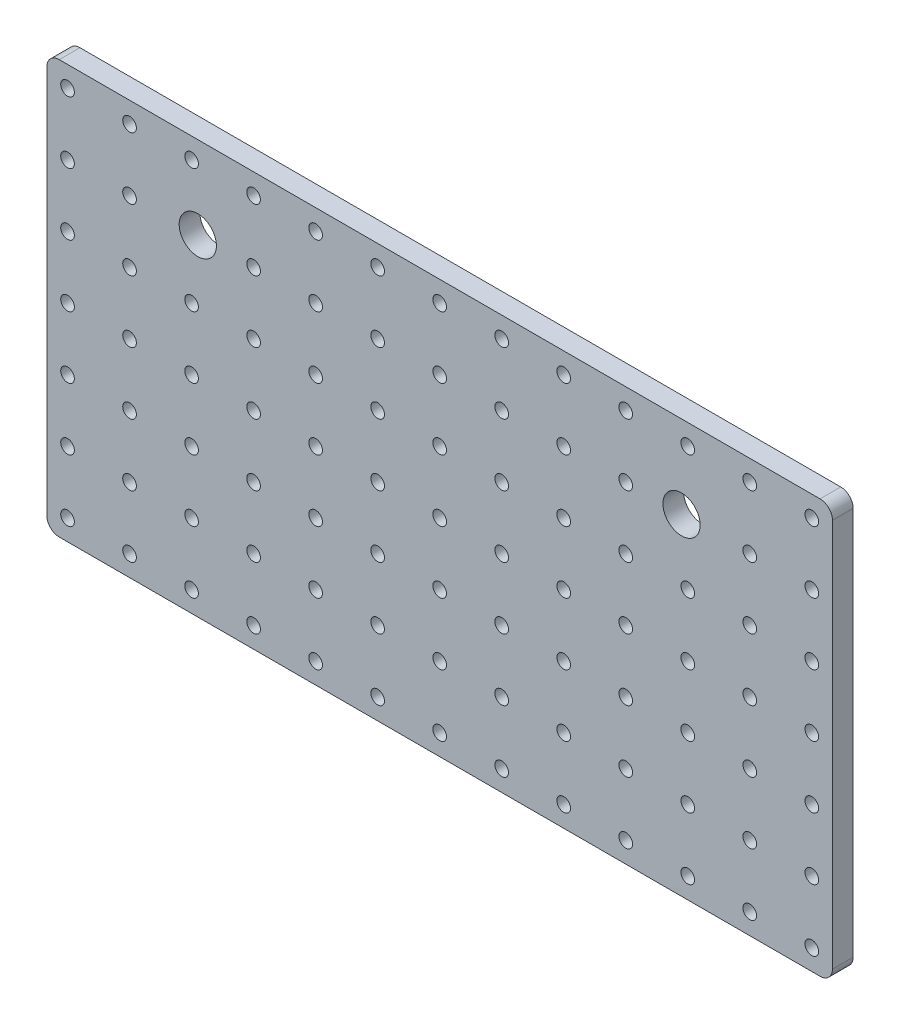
ISO-10303-21;
HEADER;
FILE_DESCRIPTION(('STEP AP214'),'2;1');
FILE_NAME('part.step','',(''),(''),'','','');
FILE_SCHEMA(('AUTOMOTIVE_DESIGN { 1 0 10303 214 1 1 1 1 }'));
ENDSEC;
DATA;
#1=APPLICATION_CONTEXT('core data for automotive mechanical design processes');
#2=APPLICATION_PROTOCOL_DEFINITION('international standard','automotive_design',2000,#1);
#3=PRODUCT_CONTEXT('',#1,'mechanical');
#4=PRODUCT('Part','Part','',(#3));
#5=PRODUCT_RELATED_PRODUCT_CATEGORY('part','',(#4));
#6=PRODUCT_DEFINITION_FORMATION('','',#4);
#7=PRODUCT_DEFINITION_CONTEXT('part definition',#1,'design');
#8=PRODUCT_DEFINITION('design','',#6,#7);
#9=PRODUCT_DEFINITION_SHAPE('','',#8);
#10=(LENGTH_UNIT() NAMED_UNIT(*) SI_UNIT(.MILLI.,.METRE.));
#11=(NAMED_UNIT(*) PLANE_ANGLE_UNIT() SI_UNIT($,.RADIAN.));
#12=(NAMED_UNIT(*) SI_UNIT($,.STERADIAN.) SOLID_ANGLE_UNIT());
#13=UNCERTAINTY_MEASURE_WITH_UNIT(LENGTH_MEASURE(1.E-05),#10,'distance_accuracy_value','');
#14=(GEOMETRIC_REPRESENTATION_CONTEXT(3) GLOBAL_UNCERTAINTY_ASSIGNED_CONTEXT((#13)) GLOBAL_UNIT_ASSIGNED_CONTEXT((#10,
#11,#12)) REPRESENTATION_CONTEXT('',''));
#15=CARTESIAN_POINT('',(0.,0.,0.));
#16=DIRECTION('',(0.,0.,1.));
#17=DIRECTION('',(1.,0.,0.));
#18=AXIS2_PLACEMENT_3D('',#15,#16,#17);
#19=CARTESIAN_POINT('',(95.,-50.,0.));
#20=DIRECTION('',(0.,0.,1.));
#21=DIRECTION('',(1.,0.,0.));
#22=AXIS2_PLACEMENT_3D('',#19,#20,#21);
#23=PLANE('',#22);
#24=CARTESIAN_POINT('',(92.,-47.,0.));
#25=DIRECTION('',(0.,0.,-1.));
#26=DIRECTION('',(-1.,0.,0.));
#27=AXIS2_PLACEMENT_3D('',#24,#25,#26);
#28=CIRCLE('',#27,3.);
#29=CARTESIAN_POINT('',(92.,-50.,0.));
#30=VERTEX_POINT('',#29);
#31=CARTESIAN_POINT('',(95.,-47.,0.));
#32=VERTEX_POINT('',#31);
#33=EDGE_CURVE('E92',#30,#32,#28,.F.);
#34=ORIENTED_EDGE('',*,*,#33,.F.);
#35=DIRECTION('',(1.,0.,0.));
#36=VECTOR('',#35,1.);
#37=CARTESIAN_POINT('',(95.,-50.,0.));
#38=LINE('',#37,#36);
#39=CARTESIAN_POINT('',(-92.,-50.,0.));
#40=VERTEX_POINT('',#39);
#41=EDGE_CURVE('E78',#30,#40,#38,.F.);
#42=ORIENTED_EDGE('',*,*,#41,.T.);
#43=CARTESIAN_POINT('',(-92.,-47.,0.));
#44=DIRECTION('',(0.,0.,-1.));
#45=DIRECTION('',(-1.,0.,0.));
#46=AXIS2_PLACEMENT_3D('',#43,#44,#45);
#47=CIRCLE('',#46,3.);
#48=CARTESIAN_POINT('',(-95.,-47.,0.));
#49=VERTEX_POINT('',#48);
#50=EDGE_CURVE('E398',#49,#40,#47,.F.);
#51=ORIENTED_EDGE('',*,*,#50,.F.);
#52=DIRECTION('',(0.,1.,0.));
#53=VECTOR('',#52,1.);
#54=CARTESIAN_POINT('',(-95.,-50.,0.));
#55=LINE('',#54,#53);
#56=CARTESIAN_POINT('',(-95.,47.,0.));
#57=VERTEX_POINT('',#56);
#58=EDGE_CURVE('E400',#49,#57,#55,.T.);
#59=ORIENTED_EDGE('',*,*,#58,.T.);
#60=CARTESIAN_POINT('',(-92.,47.,0.));
#61=DIRECTION('',(0.,0.,-1.));
#62=DIRECTION('',(-1.,0.,0.));
#63=AXIS2_PLACEMENT_3D('',#60,#61,#62);
#64=CIRCLE('',#63,3.);
#65=CARTESIAN_POINT('',(-92.,50.,0.));
#66=VERTEX_POINT('',#65);
#67=EDGE_CURVE('E404',#66,#57,#64,.F.);
#68=ORIENTED_EDGE('',*,*,#67,.F.);
#69=DIRECTION('',(1.,0.,0.));
#70=VECTOR('',#69,1.);
#71=CARTESIAN_POINT('',(95.,50.,0.));
#72=LINE('',#71,#70);
#73=CARTESIAN_POINT('',(92.,50.,0.));
#74=VERTEX_POINT('',#73);
#75=EDGE_CURVE('E407',#66,#74,#72,.T.);
#76=ORIENTED_EDGE('',*,*,#75,.T.);
#77=CARTESIAN_POINT('',(92.,47.,0.));
#78=DIRECTION('',(0.,0.,-1.));
#79=DIRECTION('',(-1.,0.,0.));
#80=AXIS2_PLACEMENT_3D('',#77,#78,#79);
#81=CIRCLE('',#80,3.);
#82=CARTESIAN_POINT('',(95.,47.,0.));
#83=VERTEX_POINT('',#82);
#84=EDGE_CURVE('E410',#83,#74,#81,.F.);
#85=ORIENTED_EDGE('',*,*,#84,.F.);
#86=DIRECTION('',(0.,1.,0.));
#87=VECTOR('',#86,1.);
#88=CARTESIAN_POINT('',(95.,-50.,0.));
#89=LINE('',#88,#87);
#90=EDGE_CURVE('E95',#83,#32,#89,.F.);
#91=ORIENTED_EDGE('',*,*,#90,.T.);
#92=EDGE_LOOP('',(#34,#42,#51,#59,#68,#76,#85,#91));
#93=FACE_BOUND('',#92,.T.);
#94=CARTESIAN_POINT('',(89.9999999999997,45.,0.));
#95=DIRECTION('',(0.,0.,1.));
#96=DIRECTION('',(1.,0.,0.));
#97=AXIS2_PLACEMENT_3D('',#94,#95,#96);
#98=CIRCLE('',#97,1.65);
#99=CARTESIAN_POINT('',(91.6499999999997,45.,0.));
#100=VERTEX_POINT('',#99);
#101=EDGE_CURVE('E89',#100,#100,#98,.T.);
#102=ORIENTED_EDGE('',*,*,#101,.T.);
#103=EDGE_LOOP('',(#102));
#104=FACE_BOUND('',#103,.T.);
#105=CARTESIAN_POINT('',(74.9999999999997,45.,0.));
#106=DIRECTION('',(0.,0.,1.));
#107=DIRECTION('',(1.,0.,0.));
#108=AXIS2_PLACEMENT_3D('',#105,#106,#107);
#109=CIRCLE('',#108,1.65);
#110=CARTESIAN_POINT('',(76.6499999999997,45.,0.));
#111=VERTEX_POINT('',#110);
#112=EDGE_CURVE('E417',#111,#111,#109,.T.);
#113=ORIENTED_EDGE('',*,*,#112,.T.);
#114=EDGE_LOOP('',(#113));
#115=FACE_BOUND('',#114,.T.);
#116=CARTESIAN_POINT('',(59.9999999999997,45.,0.));
#117=DIRECTION('',(0.,0.,1.));
#118=DIRECTION('',(1.,0.,0.));
#119=AXIS2_PLACEMENT_3D('',#116,#117,#118);
#120=CIRCLE('',#119,1.65);
#121=CARTESIAN_POINT('',(61.6499999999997,45.,0.));
#122=VERTEX_POINT('',#121);
#123=EDGE_CURVE('E420',#122,#122,#120,.T.);
#124=ORIENTED_EDGE('',*,*,#123,.T.);
#125=EDGE_LOOP('',(#124));
#126=FACE_BOUND('',#125,.T.);
#127=CARTESIAN_POINT('',(44.9999999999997,45.,0.));
#128=DIRECTION('',(0.,0.,1.));
#129=DIRECTION('',(1.,0.,0.));
#130=AXIS2_PLACEMENT_3D('',#127,#128,#129);
#131=CIRCLE('',#130,1.65);
#132=CARTESIAN_POINT('',(46.6499999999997,45.,0.));
#133=VERTEX_POINT('',#132);
#134=EDGE_CURVE('E423',#133,#133,#131,.T.);
#135=ORIENTED_EDGE('',*,*,#134,.T.);
#136=EDGE_LOOP('',(#135));
#137=FACE_BOUND('',#136,.T.);
#138=CARTESIAN_POINT('',(29.9999999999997,45.,0.));
#139=DIRECTION('',(0.,0.,1.));
#140=DIRECTION('',(1.,0.,0.));
#141=AXIS2_PLACEMENT_3D('',#138,#139,#140);
#142=CIRCLE('',#141,1.65);
#143=CARTESIAN_POINT('',(31.6499999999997,45.,0.));
#144=VERTEX_POINT('',#143);
#145=EDGE_CURVE('E426',#144,#144,#142,.T.);
#146=ORIENTED_EDGE('',*,*,#145,.T.);
#147=EDGE_LOOP('',(#146));
#148=FACE_BOUND('',#147,.T.);
#149=CARTESIAN_POINT('',(14.9999999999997,45.,0.));
#150=DIRECTION('',(0.,0.,1.));
#151=DIRECTION('',(1.,0.,0.));
#152=AXIS2_PLACEMENT_3D('',#149,#150,#151);
#153=CIRCLE('',#152,1.65);
#154=CARTESIAN_POINT('',(16.6499999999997,45.,0.));
#155=VERTEX_POINT('',#154);
#156=EDGE_CURVE('E429',#155,#155,#153,.T.);
#157=ORIENTED_EDGE('',*,*,#156,.T.);
#158=EDGE_LOOP('',(#157));
#159=FACE_BOUND('',#158,.T.);
#160=CARTESIAN_POINT('',(-3.33066907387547E-13,45.,0.));
#161=DIRECTION('',(0.,0.,1.));
#162=DIRECTION('',(1.,0.,0.));
#163=AXIS2_PLACEMENT_3D('',#160,#161,#162);
#164=CIRCLE('',#163,1.65);
#165=CARTESIAN_POINT('',(1.64999999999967,45.,0.));
#166=VERTEX_POINT('',#165);
#167=EDGE_CURVE('E432',#166,#166,#164,.T.);
#168=ORIENTED_EDGE('',*,*,#167,.T.);
#169=EDGE_LOOP('',(#168));
#170=FACE_BOUND('',#169,.T.);
#171=CARTESIAN_POINT('',(-15.0000000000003,45.,0.));
#172=DIRECTION('',(0.,0.,1.));
#173=DIRECTION('',(1.,0.,0.));
#174=AXIS2_PLACEMENT_3D('',#171,#172,#173);
#175=CIRCLE('',#174,1.65);
#176=CARTESIAN_POINT('',(-13.3500000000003,45.,0.));
#177=VERTEX_POINT('',#176);
#178=EDGE_CURVE('E435',#177,#177,#175,.T.);
#179=ORIENTED_EDGE('',*,*,#178,.T.);
#180=EDGE_LOOP('',(#179));
#181=FACE_BOUND('',#180,.T.);
#182=CARTESIAN_POINT('',(-30.0000000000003,45.,0.));
#183=DIRECTION('',(0.,0.,1.));
#184=DIRECTION('',(1.,0.,0.));
#185=AXIS2_PLACEMENT_3D('',#182,#183,#184);
#186=CIRCLE('',#185,1.65);
#187=CARTESIAN_POINT('',(-28.3500000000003,45.,0.));
#188=VERTEX_POINT('',#187);
#189=EDGE_CURVE('E438',#188,#188,#186,.T.);
#190=ORIENTED_EDGE('',*,*,#189,.T.);
#191=EDGE_LOOP('',(#190));
#192=FACE_BOUND('',#191,.T.);
#193=CARTESIAN_POINT('',(-45.0000000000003,45.,0.));
#194=DIRECTION('',(0.,0.,1.));
#195=DIRECTION('',(1.,0.,0.));
#196=AXIS2_PLACEMENT_3D('',#193,#194,#195);
#197=CIRCLE('',#196,1.65);
#198=CARTESIAN_POINT('',(-43.3500000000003,45.,0.));
#199=VERTEX_POINT('',#198);
#200=EDGE_CURVE('E441',#199,#199,#197,.T.);
#201=ORIENTED_EDGE('',*,*,#200,.T.);
#202=EDGE_LOOP('',(#201));
#203=FACE_BOUND('',#202,.T.);
#204=CARTESIAN_POINT('',(-60.0000000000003,45.,0.));
#205=DIRECTION('',(0.,0.,1.));
#206=DIRECTION('',(1.,0.,0.));
#207=AXIS2_PLACEMENT_3D('',#204,#205,#206);
#208=CIRCLE('',#207,1.65);
#209=CARTESIAN_POINT('',(-58.3500000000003,45.,0.));
#210=VERTEX_POINT('',#209);
#211=EDGE_CURVE('E444',#210,#210,#208,.T.);
#212=ORIENTED_EDGE('',*,*,#211,.T.);
#213=EDGE_LOOP('',(#212));
#214=FACE_BOUND('',#213,.T.);
#215=CARTESIAN_POINT('',(-75.0000000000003,45.,0.));
#216=DIRECTION('',(0.,0.,1.));
#217=DIRECTION('',(1.,0.,0.));
#218=AXIS2_PLACEMENT_3D('',#215,#216,#217);
#219=CIRCLE('',#218,1.65);
#220=CARTESIAN_POINT('',(-73.3500000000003,45.,0.));
#221=VERTEX_POINT('',#220);
#222=EDGE_CURVE('E447',#221,#221,#219,.T.);
#223=ORIENTED_EDGE('',*,*,#222,.T.);
#224=EDGE_LOOP('',(#223));
#225=FACE_BOUND('',#224,.T.);
#226=CARTESIAN_POINT('',(-90.0000000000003,45.,0.));
#227=DIRECTION('',(0.,0.,1.));
#228=DIRECTION('',(1.,0.,0.));
#229=AXIS2_PLACEMENT_3D('',#226,#227,#228);
#230=CIRCLE('',#229,1.65);
#231=CARTESIAN_POINT('',(-88.3500000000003,45.,0.));
#232=VERTEX_POINT('',#231);
#233=EDGE_CURVE('E450',#232,#232,#230,.T.);
#234=ORIENTED_EDGE('',*,*,#233,.T.);
#235=EDGE_LOOP('',(#234));
#236=FACE_BOUND('',#235,.T.);
#237=CARTESIAN_POINT('',(89.9999999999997,30.,0.));
#238=DIRECTION('',(0.,0.,1.));
#239=DIRECTION('',(1.,0.,0.));
#240=AXIS2_PLACEMENT_3D('',#237,#238,#239);
#241=CIRCLE('',#240,1.65);
#242=CARTESIAN_POINT('',(91.6499999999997,30.,0.));
#243=VERTEX_POINT('',#242);
#244=EDGE_CURVE('E453',#243,#243,#241,.T.);
#245=ORIENTED_EDGE('',*,*,#244,.T.);
#246=EDGE_LOOP('',(#245));
#247=FACE_BOUND('',#246,.T.);
#248=CARTESIAN_POINT('',(74.9999999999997,30.,0.));
#249=DIRECTION('',(0.,0.,1.));
#250=DIRECTION('',(1.,0.,0.));
#251=AXIS2_PLACEMENT_3D('',#248,#249,#250);
#252=CIRCLE('',#251,1.65);
#253=CARTESIAN_POINT('',(76.6499999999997,30.,0.));
#254=VERTEX_POINT('',#253);
#255=EDGE_CURVE('E456',#254,#254,#252,.T.);
#256=ORIENTED_EDGE('',*,*,#255,.T.);
#257=EDGE_LOOP('',(#256));
#258=FACE_BOUND('',#257,.T.);
#259=CARTESIAN_POINT('',(44.9999999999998,30.,0.));
#260=DIRECTION('',(0.,0.,1.));
#261=DIRECTION('',(1.,0.,0.));
#262=AXIS2_PLACEMENT_3D('',#259,#260,#261);
#263=CIRCLE('',#262,1.65);
#264=CARTESIAN_POINT('',(46.6499999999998,30.,0.));
#265=VERTEX_POINT('',#264);
#266=EDGE_CURVE('E459',#265,#265,#263,.T.);
#267=ORIENTED_EDGE('',*,*,#266,.T.);
#268=EDGE_LOOP('',(#267));
#269=FACE_BOUND('',#268,.T.);
#270=CARTESIAN_POINT('',(29.9999999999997,30.,0.));
#271=DIRECTION('',(0.,0.,1.));
#272=DIRECTION('',(1.,0.,0.));
#273=AXIS2_PLACEMENT_3D('',#270,#271,#272);
#274=CIRCLE('',#273,1.65);
#275=CARTESIAN_POINT('',(31.6499999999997,30.,0.));
#276=VERTEX_POINT('',#275);
#277=EDGE_CURVE('E462',#276,#276,#274,.T.);
#278=ORIENTED_EDGE('',*,*,#277,.T.);
#279=EDGE_LOOP('',(#278));
#280=FACE_BOUND('',#279,.T.);
#281=CARTESIAN_POINT('',(14.9999999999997,30.,0.));
#282=DIRECTION('',(0.,0.,1.));
#283=DIRECTION('',(1.,0.,0.));
#284=AXIS2_PLACEMENT_3D('',#281,#282,#283);
#285=CIRCLE('',#284,1.65);
#286=CARTESIAN_POINT('',(16.6499999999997,30.,0.));
#287=VERTEX_POINT('',#286);
#288=EDGE_CURVE('E465',#287,#287,#285,.T.);
#289=ORIENTED_EDGE('',*,*,#288,.T.);
#290=EDGE_LOOP('',(#289));
#291=FACE_BOUND('',#290,.T.);
#292=CARTESIAN_POINT('',(-2.77555756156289E-13,30.,0.));
#293=DIRECTION('',(0.,0.,1.));
#294=DIRECTION('',(1.,0.,0.));
#295=AXIS2_PLACEMENT_3D('',#292,#293,#294);
#296=CIRCLE('',#295,1.65);
#297=CARTESIAN_POINT('',(1.64999999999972,30.,0.));
#298=VERTEX_POINT('',#297);
#299=EDGE_CURVE('E468',#298,#298,#296,.T.);
#300=ORIENTED_EDGE('',*,*,#299,.T.);
#301=EDGE_LOOP('',(#300));
#302=FACE_BOUND('',#301,.T.);
#303=CARTESIAN_POINT('',(-15.0000000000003,30.,0.));
#304=DIRECTION('',(0.,0.,1.));
#305=DIRECTION('',(1.,0.,0.));
#306=AXIS2_PLACEMENT_3D('',#303,#304,#305);
#307=CIRCLE('',#306,1.65);
#308=CARTESIAN_POINT('',(-13.3500000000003,30.,0.));
#309=VERTEX_POINT('',#308);
#310=EDGE_CURVE('E471',#309,#309,#307,.T.);
#311=ORIENTED_EDGE('',*,*,#310,.T.);
#312=EDGE_LOOP('',(#311));
#313=FACE_BOUND('',#312,.T.);
#314=CARTESIAN_POINT('',(-30.0000000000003,30.,0.));
#315=DIRECTION('',(0.,0.,1.));
#316=DIRECTION('',(1.,0.,0.));
#317=AXIS2_PLACEMENT_3D('',#314,#315,#316);
#318=CIRCLE('',#317,1.65);
#319=CARTESIAN_POINT('',(-28.3500000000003,30.,0.));
#320=VERTEX_POINT('',#319);
#321=EDGE_CURVE('E474',#320,#320,#318,.T.);
#322=ORIENTED_EDGE('',*,*,#321,.T.);
#323=EDGE_LOOP('',(#322));
#324=FACE_BOUND('',#323,.T.);
#325=CARTESIAN_POINT('',(-45.0000000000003,30.,0.));
#326=DIRECTION('',(0.,0.,1.));
#327=DIRECTION('',(1.,0.,0.));
#328=AXIS2_PLACEMENT_3D('',#325,#326,#327);
#329=CIRCLE('',#328,1.65);
#330=CARTESIAN_POINT('',(-43.3500000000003,30.,0.));
#331=VERTEX_POINT('',#330);
#332=EDGE_CURVE('E477',#331,#331,#329,.T.);
#333=ORIENTED_EDGE('',*,*,#332,.T.);
#334=EDGE_LOOP('',(#333));
#335=FACE_BOUND('',#334,.T.);
#336=CARTESIAN_POINT('',(-75.0000000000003,30.,0.));
#337=DIRECTION('',(0.,0.,1.));
#338=DIRECTION('',(1.,0.,0.));
#339=AXIS2_PLACEMENT_3D('',#336,#337,#338);
#340=CIRCLE('',#339,1.65);
#341=CARTESIAN_POINT('',(-73.3500000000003,30.,0.));
#342=VERTEX_POINT('',#341);
#343=EDGE_CURVE('E480',#342,#342,#340,.T.);
#344=ORIENTED_EDGE('',*,*,#343,.T.);
#345=EDGE_LOOP('',(#344));
#346=FACE_BOUND('',#345,.T.);
#347=CARTESIAN_POINT('',(-90.0000000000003,30.,0.));
#348=DIRECTION('',(0.,0.,1.));
#349=DIRECTION('',(1.,0.,0.));
#350=AXIS2_PLACEMENT_3D('',#347,#348,#349);
#351=CIRCLE('',#350,1.65);
#352=CARTESIAN_POINT('',(-88.3500000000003,30.,0.));
#353=VERTEX_POINT('',#352);
#354=EDGE_CURVE('E483',#353,#353,#351,.T.);
#355=ORIENTED_EDGE('',*,*,#354,.T.);
#356=EDGE_LOOP('',(#355));
#357=FACE_BOUND('',#356,.T.);
#358=CARTESIAN_POINT('',(89.9999999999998,15.,0.));
#359=DIRECTION('',(0.,0.,1.));
#360=DIRECTION('',(1.,0.,0.));
#361=AXIS2_PLACEMENT_3D('',#358,#359,#360);
#362=CIRCLE('',#361,1.65);
#363=CARTESIAN_POINT('',(91.6499999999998,15.,0.));
#364=VERTEX_POINT('',#363);
#365=EDGE_CURVE('E486',#364,#364,#362,.T.);
#366=ORIENTED_EDGE('',*,*,#365,.T.);
#367=EDGE_LOOP('',(#366));
#368=FACE_BOUND('',#367,.T.);
#369=CARTESIAN_POINT('',(74.9999999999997,15.,0.));
#370=DIRECTION('',(0.,0.,1.));
#371=DIRECTION('',(1.,0.,0.));
#372=AXIS2_PLACEMENT_3D('',#369,#370,#371);
#373=CIRCLE('',#372,1.65);
#374=CARTESIAN_POINT('',(76.6499999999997,15.,0.));
#375=VERTEX_POINT('',#374);
#376=EDGE_CURVE('E489',#375,#375,#373,.T.);
#377=ORIENTED_EDGE('',*,*,#376,.T.);
#378=EDGE_LOOP('',(#377));
#379=FACE_BOUND('',#378,.T.);
#380=CARTESIAN_POINT('',(59.9999999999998,15.,0.));
#381=DIRECTION('',(0.,0.,1.));
#382=DIRECTION('',(1.,0.,0.));
#383=AXIS2_PLACEMENT_3D('',#380,#381,#382);
#384=CIRCLE('',#383,1.65);
#385=CARTESIAN_POINT('',(61.6499999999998,15.,0.));
#386=VERTEX_POINT('',#385);
#387=EDGE_CURVE('E492',#386,#386,#384,.T.);
#388=ORIENTED_EDGE('',*,*,#387,.T.);
#389=EDGE_LOOP('',(#388));
#390=FACE_BOUND('',#389,.T.);
#391=CARTESIAN_POINT('',(44.9999999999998,15.,0.));
#392=DIRECTION('',(0.,0.,1.));
#393=DIRECTION('',(1.,0.,0.));
#394=AXIS2_PLACEMENT_3D('',#391,#392,#393);
#395=CIRCLE('',#394,1.65);
#396=CARTESIAN_POINT('',(46.6499999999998,15.,0.));
#397=VERTEX_POINT('',#396);
#398=EDGE_CURVE('E495',#397,#397,#395,.T.);
#399=ORIENTED_EDGE('',*,*,#398,.T.);
#400=EDGE_LOOP('',(#399));
#401=FACE_BOUND('',#400,.T.);
#402=CARTESIAN_POINT('',(29.9999999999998,15.,0.));
#403=DIRECTION('',(0.,0.,1.));
#404=DIRECTION('',(1.,0.,0.));
#405=AXIS2_PLACEMENT_3D('',#402,#403,#404);
#406=CIRCLE('',#405,1.65);
#407=CARTESIAN_POINT('',(31.6499999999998,15.,0.));
#408=VERTEX_POINT('',#407);
#409=EDGE_CURVE('E498',#408,#408,#406,.T.);
#410=ORIENTED_EDGE('',*,*,#409,.T.);
#411=EDGE_LOOP('',(#410));
#412=FACE_BOUND('',#411,.T.);
#413=CARTESIAN_POINT('',(14.9999999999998,15.,0.));
#414=DIRECTION('',(0.,0.,1.));
#415=DIRECTION('',(1.,0.,0.));
#416=AXIS2_PLACEMENT_3D('',#413,#414,#415);
#417=CIRCLE('',#416,1.65);
#418=CARTESIAN_POINT('',(16.6499999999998,15.,0.));
#419=VERTEX_POINT('',#418);
#420=EDGE_CURVE('E501',#419,#419,#417,.T.);
#421=ORIENTED_EDGE('',*,*,#420,.T.);
#422=EDGE_LOOP('',(#421));
#423=FACE_BOUND('',#422,.T.);
#424=CARTESIAN_POINT('',(-2.22044604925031E-13,15.,0.));
#425=DIRECTION('',(0.,0.,1.));
#426=DIRECTION('',(1.,0.,0.));
#427=AXIS2_PLACEMENT_3D('',#424,#425,#426);
#428=CIRCLE('',#427,1.65);
#429=CARTESIAN_POINT('',(1.64999999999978,15.,0.));
#430=VERTEX_POINT('',#429);
#431=EDGE_CURVE('E504',#430,#430,#428,.T.);
#432=ORIENTED_EDGE('',*,*,#431,.T.);
#433=EDGE_LOOP('',(#432));
#434=FACE_BOUND('',#433,.T.);
#435=CARTESIAN_POINT('',(-15.0000000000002,15.,0.));
#436=DIRECTION('',(0.,0.,1.));
#437=DIRECTION('',(1.,0.,0.));
#438=AXIS2_PLACEMENT_3D('',#435,#436,#437);
#439=CIRCLE('',#438,1.65);
#440=CARTESIAN_POINT('',(-13.3500000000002,15.,0.));
#441=VERTEX_POINT('',#440);
#442=EDGE_CURVE('E507',#441,#441,#439,.T.);
#443=ORIENTED_EDGE('',*,*,#442,.T.);
#444=EDGE_LOOP('',(#443));
#445=FACE_BOUND('',#444,.T.);
#446=CARTESIAN_POINT('',(-30.0000000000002,15.,0.));
#447=DIRECTION('',(0.,0.,1.));
#448=DIRECTION('',(1.,0.,0.));
#449=AXIS2_PLACEMENT_3D('',#446,#447,#448);
#450=CIRCLE('',#449,1.65);
#451=CARTESIAN_POINT('',(-28.3500000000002,15.,0.));
#452=VERTEX_POINT('',#451);
#453=EDGE_CURVE('E510',#452,#452,#450,.T.);
#454=ORIENTED_EDGE('',*,*,#453,.T.);
#455=EDGE_LOOP('',(#454));
#456=FACE_BOUND('',#455,.T.);
#457=CARTESIAN_POINT('',(-45.0000000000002,15.,0.));
#458=DIRECTION('',(0.,0.,1.));
#459=DIRECTION('',(1.,0.,0.));
#460=AXIS2_PLACEMENT_3D('',#457,#458,#459);
#461=CIRCLE('',#460,1.65);
#462=CARTESIAN_POINT('',(-43.3500000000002,15.,0.));
#463=VERTEX_POINT('',#462);
#464=EDGE_CURVE('E513',#463,#463,#461,.T.);
#465=ORIENTED_EDGE('',*,*,#464,.T.);
#466=EDGE_LOOP('',(#465));
#467=FACE_BOUND('',#466,.T.);
#468=CARTESIAN_POINT('',(-60.0000000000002,15.,0.));
#469=DIRECTION('',(0.,0.,1.));
#470=DIRECTION('',(1.,0.,0.));
#471=AXIS2_PLACEMENT_3D('',#468,#469,#470);
#472=CIRCLE('',#471,1.65);
#473=CARTESIAN_POINT('',(-58.3500000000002,15.,0.));
#474=VERTEX_POINT('',#473);
#475=EDGE_CURVE('E516',#474,#474,#472,.T.);
#476=ORIENTED_EDGE('',*,*,#475,.T.);
#477=EDGE_LOOP('',(#476));
#478=FACE_BOUND('',#477,.T.);
#479=CARTESIAN_POINT('',(-75.0000000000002,15.,0.));
#480=DIRECTION('',(0.,0.,1.));
#481=DIRECTION('',(1.,0.,0.));
#482=AXIS2_PLACEMENT_3D('',#479,#480,#481);
#483=CIRCLE('',#482,1.65);
#484=CARTESIAN_POINT('',(-73.3500000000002,15.,0.));
#485=VERTEX_POINT('',#484);
#486=EDGE_CURVE('E519',#485,#485,#483,.T.);
#487=ORIENTED_EDGE('',*,*,#486,.T.);
#488=EDGE_LOOP('',(#487));
#489=FACE_BOUND('',#488,.T.);
#490=CARTESIAN_POINT('',(-90.0000000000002,15.,0.));
#491=DIRECTION('',(0.,0.,1.));
#492=DIRECTION('',(1.,0.,0.));
#493=AXIS2_PLACEMENT_3D('',#490,#491,#492);
#494=CIRCLE('',#493,1.65);
#495=CARTESIAN_POINT('',(-88.3500000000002,15.,0.));
#496=VERTEX_POINT('',#495);
#497=EDGE_CURVE('E522',#496,#496,#494,.T.);
#498=ORIENTED_EDGE('',*,*,#497,.T.);
#499=EDGE_LOOP('',(#498));
#500=FACE_BOUND('',#499,.T.);
#501=CARTESIAN_POINT('',(89.9999999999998,0.,0.));
#502=DIRECTION('',(0.,0.,1.));
#503=DIRECTION('',(1.,0.,0.));
#504=AXIS2_PLACEMENT_3D('',#501,#502,#503);
#505=CIRCLE('',#504,1.65);
#506=CARTESIAN_POINT('',(91.6499999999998,0.,0.));
#507=VERTEX_POINT('',#506);
#508=EDGE_CURVE('E525',#507,#507,#505,.T.);
#509=ORIENTED_EDGE('',*,*,#508,.T.);
#510=EDGE_LOOP('',(#509));
#511=FACE_BOUND('',#510,.T.);
#512=CARTESIAN_POINT('',(74.9999999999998,0.,0.));
#513=DIRECTION('',(0.,0.,1.));
#514=DIRECTION('',(1.,0.,0.));
#515=AXIS2_PLACEMENT_3D('',#512,#513,#514);
#516=CIRCLE('',#515,1.65);
#517=CARTESIAN_POINT('',(76.6499999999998,0.,0.));
#518=VERTEX_POINT('',#517);
#519=EDGE_CURVE('E528',#518,#518,#516,.T.);
#520=ORIENTED_EDGE('',*,*,#519,.T.);
#521=EDGE_LOOP('',(#520));
#522=FACE_BOUND('',#521,.T.);
#523=CARTESIAN_POINT('',(59.9999999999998,0.,0.));
#524=DIRECTION('',(0.,0.,1.));
#525=DIRECTION('',(1.,0.,0.));
#526=AXIS2_PLACEMENT_3D('',#523,#524,#525);
#527=CIRCLE('',#526,1.65);
#528=CARTESIAN_POINT('',(61.6499999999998,0.,0.));
#529=VERTEX_POINT('',#528);
#530=EDGE_CURVE('E531',#529,#529,#527,.T.);
#531=ORIENTED_EDGE('',*,*,#530,.T.);
#532=EDGE_LOOP('',(#531));
#533=FACE_BOUND('',#532,.T.);
#534=CARTESIAN_POINT('',(44.9999999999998,0.,0.));
#535=DIRECTION('',(0.,0.,1.));
#536=DIRECTION('',(1.,0.,0.));
#537=AXIS2_PLACEMENT_3D('',#534,#535,#536);
#538=CIRCLE('',#537,1.65);
#539=CARTESIAN_POINT('',(46.6499999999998,0.,0.));
#540=VERTEX_POINT('',#539);
#541=EDGE_CURVE('E534',#540,#540,#538,.T.);
#542=ORIENTED_EDGE('',*,*,#541,.T.);
#543=EDGE_LOOP('',(#542));
#544=FACE_BOUND('',#543,.T.);
#545=CARTESIAN_POINT('',(29.9999999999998,0.,0.));
#546=DIRECTION('',(0.,0.,1.));
#547=DIRECTION('',(1.,0.,0.));
#548=AXIS2_PLACEMENT_3D('',#545,#546,#547);
#549=CIRCLE('',#548,1.65);
#550=CARTESIAN_POINT('',(31.6499999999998,0.,0.));
#551=VERTEX_POINT('',#550);
#552=EDGE_CURVE('E537',#551,#551,#549,.T.);
#553=ORIENTED_EDGE('',*,*,#552,.T.);
#554=EDGE_LOOP('',(#553));
#555=FACE_BOUND('',#554,.T.);
#556=CARTESIAN_POINT('',(14.9999999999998,0.,0.));
#557=DIRECTION('',(0.,0.,1.));
#558=DIRECTION('',(1.,0.,0.));
#559=AXIS2_PLACEMENT_3D('',#556,#557,#558);
#560=CIRCLE('',#559,1.65);
#561=CARTESIAN_POINT('',(16.6499999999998,0.,0.));
#562=VERTEX_POINT('',#561);
#563=EDGE_CURVE('E540',#562,#562,#560,.T.);
#564=ORIENTED_EDGE('',*,*,#563,.T.);
#565=EDGE_LOOP('',(#564));
#566=FACE_BOUND('',#565,.T.);
#567=CARTESIAN_POINT('',(-1.66533453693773E-13,0.,0.));
#568=DIRECTION('',(0.,0.,1.));
#569=DIRECTION('',(1.,0.,0.));
#570=AXIS2_PLACEMENT_3D('',#567,#568,#569);
#571=CIRCLE('',#570,1.65);
#572=CARTESIAN_POINT('',(1.64999999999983,0.,0.));
#573=VERTEX_POINT('',#572);
#574=EDGE_CURVE('E543',#573,#573,#571,.T.);
#575=ORIENTED_EDGE('',*,*,#574,.T.);
#576=EDGE_LOOP('',(#575));
#577=FACE_BOUND('',#576,.T.);
#578=CARTESIAN_POINT('',(-15.0000000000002,0.,0.));
#579=DIRECTION('',(0.,0.,1.));
#580=DIRECTION('',(1.,0.,0.));
#581=AXIS2_PLACEMENT_3D('',#578,#579,#580);
#582=CIRCLE('',#581,1.65);
#583=CARTESIAN_POINT('',(-13.3500000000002,0.,0.));
#584=VERTEX_POINT('',#583);
#585=EDGE_CURVE('E546',#584,#584,#582,.T.);
#586=ORIENTED_EDGE('',*,*,#585,.T.);
#587=EDGE_LOOP('',(#586));
#588=FACE_BOUND('',#587,.T.);
#589=CARTESIAN_POINT('',(-30.0000000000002,0.,0.));
#590=DIRECTION('',(0.,0.,1.));
#591=DIRECTION('',(1.,0.,0.));
#592=AXIS2_PLACEMENT_3D('',#589,#590,#591);
#593=CIRCLE('',#592,1.65);
#594=CARTESIAN_POINT('',(-28.3500000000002,0.,0.));
#595=VERTEX_POINT('',#594);
#596=EDGE_CURVE('E549',#595,#595,#593,.T.);
#597=ORIENTED_EDGE('',*,*,#596,.T.);
#598=EDGE_LOOP('',(#597));
#599=FACE_BOUND('',#598,.T.);
#600=CARTESIAN_POINT('',(-45.0000000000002,0.,0.));
#601=DIRECTION('',(0.,0.,1.));
#602=DIRECTION('',(1.,0.,0.));
#603=AXIS2_PLACEMENT_3D('',#600,#601,#602);
#604=CIRCLE('',#603,1.65);
#605=CARTESIAN_POINT('',(-43.3500000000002,0.,0.));
#606=VERTEX_POINT('',#605);
#607=EDGE_CURVE('E552',#606,#606,#604,.T.);
#608=ORIENTED_EDGE('',*,*,#607,.T.);
#609=EDGE_LOOP('',(#608));
#610=FACE_BOUND('',#609,.T.);
#611=CARTESIAN_POINT('',(-60.0000000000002,0.,0.));
#612=DIRECTION('',(0.,0.,1.));
#613=DIRECTION('',(1.,0.,0.));
#614=AXIS2_PLACEMENT_3D('',#611,#612,#613);
#615=CIRCLE('',#614,1.65);
#616=CARTESIAN_POINT('',(-58.3500000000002,0.,0.));
#617=VERTEX_POINT('',#616);
#618=EDGE_CURVE('E555',#617,#617,#615,.T.);
#619=ORIENTED_EDGE('',*,*,#618,.T.);
#620=EDGE_LOOP('',(#619));
#621=FACE_BOUND('',#620,.T.);
#622=CARTESIAN_POINT('',(-75.0000000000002,0.,0.));
#623=DIRECTION('',(0.,0.,1.));
#624=DIRECTION('',(1.,0.,0.));
#625=AXIS2_PLACEMENT_3D('',#622,#623,#624);
#626=CIRCLE('',#625,1.65);
#627=CARTESIAN_POINT('',(-73.3500000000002,0.,0.));
#628=VERTEX_POINT('',#627);
#629=EDGE_CURVE('E558',#628,#628,#626,.T.);
#630=ORIENTED_EDGE('',*,*,#629,.T.);
#631=EDGE_LOOP('',(#630));
#632=FACE_BOUND('',#631,.T.);
#633=CARTESIAN_POINT('',(-90.0000000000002,0.,0.));
#634=DIRECTION('',(0.,0.,1.));
#635=DIRECTION('',(1.,0.,0.));
#636=AXIS2_PLACEMENT_3D('',#633,#634,#635);
#637=CIRCLE('',#636,1.65);
#638=CARTESIAN_POINT('',(-88.3500000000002,0.,0.));
#639=VERTEX_POINT('',#638);
#640=EDGE_CURVE('E561',#639,#639,#637,.T.);
#641=ORIENTED_EDGE('',*,*,#640,.T.);
#642=EDGE_LOOP('',(#641));
#643=FACE_BOUND('',#642,.T.);
#644=CARTESIAN_POINT('',(89.9999999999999,-15.,0.));
#645=DIRECTION('',(0.,0.,1.));
#646=DIRECTION('',(1.,0.,0.));
#647=AXIS2_PLACEMENT_3D('',#644,#645,#646);
#648=CIRCLE('',#647,1.65);
#649=CARTESIAN_POINT('',(91.6499999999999,-15.,0.));
#650=VERTEX_POINT('',#649);
#651=EDGE_CURVE('E564',#650,#650,#648,.T.);
#652=ORIENTED_EDGE('',*,*,#651,.T.);
#653=EDGE_LOOP('',(#652));
#654=FACE_BOUND('',#653,.T.);
#655=CARTESIAN_POINT('',(74.9999999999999,-15.,0.));
#656=DIRECTION('',(0.,0.,1.));
#657=DIRECTION('',(1.,0.,0.));
#658=AXIS2_PLACEMENT_3D('',#655,#656,#657);
#659=CIRCLE('',#658,1.65);
#660=CARTESIAN_POINT('',(76.6499999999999,-15.,0.));
#661=VERTEX_POINT('',#660);
#662=EDGE_CURVE('E567',#661,#661,#659,.T.);
#663=ORIENTED_EDGE('',*,*,#662,.T.);
#664=EDGE_LOOP('',(#663));
#665=FACE_BOUND('',#664,.T.);
#666=CARTESIAN_POINT('',(59.9999999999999,-15.,0.));
#667=DIRECTION('',(0.,0.,1.));
#668=DIRECTION('',(1.,0.,0.));
#669=AXIS2_PLACEMENT_3D('',#666,#667,#668);
#670=CIRCLE('',#669,1.65);
#671=CARTESIAN_POINT('',(61.6499999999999,-15.,0.));
#672=VERTEX_POINT('',#671);
#673=EDGE_CURVE('E570',#672,#672,#670,.T.);
#674=ORIENTED_EDGE('',*,*,#673,.T.);
#675=EDGE_LOOP('',(#674));
#676=FACE_BOUND('',#675,.T.);
#677=CARTESIAN_POINT('',(44.9999999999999,-15.,0.));
#678=DIRECTION('',(0.,0.,1.));
#679=DIRECTION('',(1.,0.,0.));
#680=AXIS2_PLACEMENT_3D('',#677,#678,#679);
#681=CIRCLE('',#680,1.65);
#682=CARTESIAN_POINT('',(46.6499999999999,-15.,0.));
#683=VERTEX_POINT('',#682);
#684=EDGE_CURVE('E573',#683,#683,#681,.T.);
#685=ORIENTED_EDGE('',*,*,#684,.T.);
#686=EDGE_LOOP('',(#685));
#687=FACE_BOUND('',#686,.T.);
#688=CARTESIAN_POINT('',(29.9999999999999,-15.,0.));
#689=DIRECTION('',(0.,0.,1.));
#690=DIRECTION('',(1.,0.,0.));
#691=AXIS2_PLACEMENT_3D('',#688,#689,#690);
#692=CIRCLE('',#691,1.65);
#693=CARTESIAN_POINT('',(31.6499999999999,-15.,0.));
#694=VERTEX_POINT('',#693);
#695=EDGE_CURVE('E576',#694,#694,#692,.T.);
#696=ORIENTED_EDGE('',*,*,#695,.T.);
#697=EDGE_LOOP('',(#696));
#698=FACE_BOUND('',#697,.T.);
#699=CARTESIAN_POINT('',(14.9999999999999,-15.,0.));
#700=DIRECTION('',(0.,0.,1.));
#701=DIRECTION('',(1.,0.,0.));
#702=AXIS2_PLACEMENT_3D('',#699,#700,#701);
#703=CIRCLE('',#702,1.65);
#704=CARTESIAN_POINT('',(16.6499999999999,-15.,0.));
#705=VERTEX_POINT('',#704);
#706=EDGE_CURVE('E579',#705,#705,#703,.T.);
#707=ORIENTED_EDGE('',*,*,#706,.T.);
#708=EDGE_LOOP('',(#707));
#709=FACE_BOUND('',#708,.T.);
#710=CARTESIAN_POINT('',(-1.2490009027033E-13,-15.,0.));
#711=DIRECTION('',(0.,0.,1.));
#712=DIRECTION('',(1.,0.,0.));
#713=AXIS2_PLACEMENT_3D('',#710,#711,#712);
#714=CIRCLE('',#713,1.65);
#715=CARTESIAN_POINT('',(1.64999999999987,-15.,0.));
#716=VERTEX_POINT('',#715);
#717=EDGE_CURVE('E582',#716,#716,#714,.T.);
#718=ORIENTED_EDGE('',*,*,#717,.T.);
#719=EDGE_LOOP('',(#718));
#720=FACE_BOUND('',#719,.T.);
#721=CARTESIAN_POINT('',(-15.0000000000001,-15.,0.));
#722=DIRECTION('',(0.,0.,1.));
#723=DIRECTION('',(1.,0.,0.));
#724=AXIS2_PLACEMENT_3D('',#721,#722,#723);
#725=CIRCLE('',#724,1.65);
#726=CARTESIAN_POINT('',(-13.3500000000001,-15.,0.));
#727=VERTEX_POINT('',#726);
#728=EDGE_CURVE('E585',#727,#727,#725,.T.);
#729=ORIENTED_EDGE('',*,*,#728,.T.);
#730=EDGE_LOOP('',(#729));
#731=FACE_BOUND('',#730,.T.);
#732=CARTESIAN_POINT('',(-30.0000000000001,-15.,0.));
#733=DIRECTION('',(0.,0.,1.));
#734=DIRECTION('',(1.,0.,0.));
#735=AXIS2_PLACEMENT_3D('',#732,#733,#734);
#736=CIRCLE('',#735,1.65);
#737=CARTESIAN_POINT('',(-28.3500000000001,-15.,0.));
#738=VERTEX_POINT('',#737);
#739=EDGE_CURVE('E588',#738,#738,#736,.T.);
#740=ORIENTED_EDGE('',*,*,#739,.T.);
#741=EDGE_LOOP('',(#740));
#742=FACE_BOUND('',#741,.T.);
#743=CARTESIAN_POINT('',(-45.0000000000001,-15.,0.));
#744=DIRECTION('',(0.,0.,1.));
#745=DIRECTION('',(1.,0.,0.));
#746=AXIS2_PLACEMENT_3D('',#743,#744,#745);
#747=CIRCLE('',#746,1.65);
#748=CARTESIAN_POINT('',(-43.3500000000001,-15.,0.));
#749=VERTEX_POINT('',#748);
#750=EDGE_CURVE('E591',#749,#749,#747,.T.);
#751=ORIENTED_EDGE('',*,*,#750,.T.);
#752=EDGE_LOOP('',(#751));
#753=FACE_BOUND('',#752,.T.);
#754=CARTESIAN_POINT('',(-60.0000000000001,-15.,0.));
#755=DIRECTION('',(0.,0.,1.));
#756=DIRECTION('',(1.,0.,0.));
#757=AXIS2_PLACEMENT_3D('',#754,#755,#756);
#758=CIRCLE('',#757,1.65);
#759=CARTESIAN_POINT('',(-58.3500000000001,-15.,0.));
#760=VERTEX_POINT('',#759);
#761=EDGE_CURVE('E594',#760,#760,#758,.T.);
#762=ORIENTED_EDGE('',*,*,#761,.T.);
#763=EDGE_LOOP('',(#762));
#764=FACE_BOUND('',#763,.T.);
#765=CARTESIAN_POINT('',(-75.0000000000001,-15.,0.));
#766=DIRECTION('',(0.,0.,1.));
#767=DIRECTION('',(1.,0.,0.));
#768=AXIS2_PLACEMENT_3D('',#765,#766,#767);
#769=CIRCLE('',#768,1.65);
#770=CARTESIAN_POINT('',(-73.3500000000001,-15.,0.));
#771=VERTEX_POINT('',#770);
#772=EDGE_CURVE('E597',#771,#771,#769,.T.);
#773=ORIENTED_EDGE('',*,*,#772,.T.);
#774=EDGE_LOOP('',(#773));
#775=FACE_BOUND('',#774,.T.);
#776=CARTESIAN_POINT('',(-90.0000000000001,-15.,0.));
#777=DIRECTION('',(0.,0.,1.));
#778=DIRECTION('',(1.,0.,0.));
#779=AXIS2_PLACEMENT_3D('',#776,#777,#778);
#780=CIRCLE('',#779,1.65);
#781=CARTESIAN_POINT('',(-88.3500000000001,-15.,0.));
#782=VERTEX_POINT('',#781);
#783=EDGE_CURVE('E600',#782,#782,#780,.T.);
#784=ORIENTED_EDGE('',*,*,#783,.T.);
#785=EDGE_LOOP('',(#784));
#786=FACE_BOUND('',#785,.T.);
#787=CARTESIAN_POINT('',(89.9999999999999,-30.,0.));
#788=DIRECTION('',(0.,0.,1.));
#789=DIRECTION('',(1.,0.,0.));
#790=AXIS2_PLACEMENT_3D('',#787,#788,#789);
#791=CIRCLE('',#790,1.65);
#792=CARTESIAN_POINT('',(91.6499999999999,-30.,0.));
#793=VERTEX_POINT('',#792);
#794=EDGE_CURVE('E603',#793,#793,#791,.T.);
#795=ORIENTED_EDGE('',*,*,#794,.T.);
#796=EDGE_LOOP('',(#795));
#797=FACE_BOUND('',#796,.T.);
#798=CARTESIAN_POINT('',(74.9999999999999,-30.,0.));
#799=DIRECTION('',(0.,0.,1.));
#800=DIRECTION('',(1.,0.,0.));
#801=AXIS2_PLACEMENT_3D('',#798,#799,#800);
#802=CIRCLE('',#801,1.65);
#803=CARTESIAN_POINT('',(76.6499999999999,-30.,0.));
#804=VERTEX_POINT('',#803);
#805=EDGE_CURVE('E606',#804,#804,#802,.T.);
#806=ORIENTED_EDGE('',*,*,#805,.T.);
#807=EDGE_LOOP('',(#806));
#808=FACE_BOUND('',#807,.T.);
#809=CARTESIAN_POINT('',(59.9999999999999,-30.,0.));
#810=DIRECTION('',(0.,0.,1.));
#811=DIRECTION('',(1.,0.,0.));
#812=AXIS2_PLACEMENT_3D('',#809,#810,#811);
#813=CIRCLE('',#812,1.65);
#814=CARTESIAN_POINT('',(61.6499999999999,-30.,0.));
#815=VERTEX_POINT('',#814);
#816=EDGE_CURVE('E609',#815,#815,#813,.T.);
#817=ORIENTED_EDGE('',*,*,#816,.T.);
#818=EDGE_LOOP('',(#817));
#819=FACE_BOUND('',#818,.T.);
#820=CARTESIAN_POINT('',(44.9999999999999,-30.,0.));
#821=DIRECTION('',(0.,0.,1.));
#822=DIRECTION('',(1.,0.,0.));
#823=AXIS2_PLACEMENT_3D('',#820,#821,#822);
#824=CIRCLE('',#823,1.65);
#825=CARTESIAN_POINT('',(46.6499999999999,-30.,0.));
#826=VERTEX_POINT('',#825);
#827=EDGE_CURVE('E612',#826,#826,#824,.T.);
#828=ORIENTED_EDGE('',*,*,#827,.T.);
#829=EDGE_LOOP('',(#828));
#830=FACE_BOUND('',#829,.T.);
#831=CARTESIAN_POINT('',(29.9999999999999,-30.,0.));
#832=DIRECTION('',(0.,0.,1.));
#833=DIRECTION('',(1.,0.,0.));
#834=AXIS2_PLACEMENT_3D('',#831,#832,#833);
#835=CIRCLE('',#834,1.65);
#836=CARTESIAN_POINT('',(31.6499999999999,-30.,0.));
#837=VERTEX_POINT('',#836);
#838=EDGE_CURVE('E615',#837,#837,#835,.T.);
#839=ORIENTED_EDGE('',*,*,#838,.T.);
#840=EDGE_LOOP('',(#839));
#841=FACE_BOUND('',#840,.T.);
#842=CARTESIAN_POINT('',(14.9999999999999,-30.,0.));
#843=DIRECTION('',(0.,0.,1.));
#844=DIRECTION('',(1.,0.,0.));
#845=AXIS2_PLACEMENT_3D('',#842,#843,#844);
#846=CIRCLE('',#845,1.65);
#847=CARTESIAN_POINT('',(16.6499999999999,-30.,0.));
#848=VERTEX_POINT('',#847);
#849=EDGE_CURVE('E618',#848,#848,#846,.T.);
#850=ORIENTED_EDGE('',*,*,#849,.T.);
#851=EDGE_LOOP('',(#850));
#852=FACE_BOUND('',#851,.T.);
#853=CARTESIAN_POINT('',(0.,-30.,0.));
#854=DIRECTION('',(0.,0.,1.));
#855=DIRECTION('',(1.,0.,0.));
#856=AXIS2_PLACEMENT_3D('',#853,#854,#855);
#857=CIRCLE('',#856,1.65);
#858=CARTESIAN_POINT('',(1.64999999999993,-30.,0.));
#859=VERTEX_POINT('',#858);
#860=EDGE_CURVE('E621',#859,#859,#857,.T.);
#861=ORIENTED_EDGE('',*,*,#860,.T.);
#862=EDGE_LOOP('',(#861));
#863=FACE_BOUND('',#862,.T.);
#864=CARTESIAN_POINT('',(-15.0000000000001,-30.,0.));
#865=DIRECTION('',(0.,0.,1.));
#866=DIRECTION('',(1.,0.,0.));
#867=AXIS2_PLACEMENT_3D('',#864,#865,#866);
#868=CIRCLE('',#867,1.65);
#869=CARTESIAN_POINT('',(-13.3500000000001,-30.,0.));
#870=VERTEX_POINT('',#869);
#871=EDGE_CURVE('E624',#870,#870,#868,.T.);
#872=ORIENTED_EDGE('',*,*,#871,.T.);
#873=EDGE_LOOP('',(#872));
#874=FACE_BOUND('',#873,.T.);
#875=CARTESIAN_POINT('',(-30.0000000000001,-30.,0.));
#876=DIRECTION('',(0.,0.,1.));
#877=DIRECTION('',(1.,0.,0.));
#878=AXIS2_PLACEMENT_3D('',#875,#876,#877);
#879=CIRCLE('',#878,1.65);
#880=CARTESIAN_POINT('',(-28.3500000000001,-30.,0.));
#881=VERTEX_POINT('',#880);
#882=EDGE_CURVE('E627',#881,#881,#879,.T.);
#883=ORIENTED_EDGE('',*,*,#882,.T.);
#884=EDGE_LOOP('',(#883));
#885=FACE_BOUND('',#884,.T.);
#886=CARTESIAN_POINT('',(-45.0000000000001,-30.,0.));
#887=DIRECTION('',(0.,0.,1.));
#888=DIRECTION('',(1.,0.,0.));
#889=AXIS2_PLACEMENT_3D('',#886,#887,#888);
#890=CIRCLE('',#889,1.65);
#891=CARTESIAN_POINT('',(-43.3500000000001,-30.,0.));
#892=VERTEX_POINT('',#891);
#893=EDGE_CURVE('E630',#892,#892,#890,.T.);
#894=ORIENTED_EDGE('',*,*,#893,.T.);
#895=EDGE_LOOP('',(#894));
#896=FACE_BOUND('',#895,.T.);
#897=CARTESIAN_POINT('',(-60.0000000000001,-30.,0.));
#898=DIRECTION('',(0.,0.,1.));
#899=DIRECTION('',(1.,0.,0.));
#900=AXIS2_PLACEMENT_3D('',#897,#898,#899);
#901=CIRCLE('',#900,1.65);
#902=CARTESIAN_POINT('',(-58.3500000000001,-30.,0.));
#903=VERTEX_POINT('',#902);
#904=EDGE_CURVE('E633',#903,#903,#901,.T.);
#905=ORIENTED_EDGE('',*,*,#904,.T.);
#906=EDGE_LOOP('',(#905));
#907=FACE_BOUND('',#906,.T.);
#908=CARTESIAN_POINT('',(-75.0000000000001,-30.,0.));
#909=DIRECTION('',(0.,0.,1.));
#910=DIRECTION('',(1.,0.,0.));
#911=AXIS2_PLACEMENT_3D('',#908,#909,#910);
#912=CIRCLE('',#911,1.65);
#913=CARTESIAN_POINT('',(-73.3500000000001,-30.,0.));
#914=VERTEX_POINT('',#913);
#915=EDGE_CURVE('E636',#914,#914,#912,.T.);
#916=ORIENTED_EDGE('',*,*,#915,.T.);
#917=EDGE_LOOP('',(#916));
#918=FACE_BOUND('',#917,.T.);
#919=CARTESIAN_POINT('',(-90.0000000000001,-30.,0.));
#920=DIRECTION('',(0.,0.,1.));
#921=DIRECTION('',(1.,0.,0.));
#922=AXIS2_PLACEMENT_3D('',#919,#920,#921);
#923=CIRCLE('',#922,1.65);
#924=CARTESIAN_POINT('',(-88.3500000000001,-30.,0.));
#925=VERTEX_POINT('',#924);
#926=EDGE_CURVE('E639',#925,#925,#923,.T.);
#927=ORIENTED_EDGE('',*,*,#926,.T.);
#928=EDGE_LOOP('',(#927));
#929=FACE_BOUND('',#928,.T.);
#930=CARTESIAN_POINT('',(90.,-45.,0.));
#931=DIRECTION('',(0.,0.,1.));
#932=DIRECTION('',(1.,0.,0.));
#933=AXIS2_PLACEMENT_3D('',#930,#931,#932);
#934=CIRCLE('',#933,1.65);
#935=CARTESIAN_POINT('',(91.65,-45.,0.));
#936=VERTEX_POINT('',#935);
#937=EDGE_CURVE('E642',#936,#936,#934,.T.);
#938=ORIENTED_EDGE('',*,*,#937,.T.);
#939=EDGE_LOOP('',(#938));
#940=FACE_BOUND('',#939,.T.);
#941=CARTESIAN_POINT('',(75.,-45.,0.));
#942=DIRECTION('',(0.,0.,1.));
#943=DIRECTION('',(1.,0.,0.));
#944=AXIS2_PLACEMENT_3D('',#941,#942,#943);
#945=CIRCLE('',#944,1.65);
#946=CARTESIAN_POINT('',(76.65,-45.,0.));
#947=VERTEX_POINT('',#946);
#948=EDGE_CURVE('E645',#947,#947,#945,.T.);
#949=ORIENTED_EDGE('',*,*,#948,.T.);
#950=EDGE_LOOP('',(#949));
#951=FACE_BOUND('',#950,.T.);
#952=CARTESIAN_POINT('',(60.,-45.,0.));
#953=DIRECTION('',(0.,0.,1.));
#954=DIRECTION('',(1.,0.,0.));
#955=AXIS2_PLACEMENT_3D('',#952,#953,#954);
#956=CIRCLE('',#955,1.65);
#957=CARTESIAN_POINT('',(61.65,-45.,0.));
#958=VERTEX_POINT('',#957);
#959=EDGE_CURVE('E648',#958,#958,#956,.T.);
#960=ORIENTED_EDGE('',*,*,#959,.T.);
#961=EDGE_LOOP('',(#960));
#962=FACE_BOUND('',#961,.T.);
#963=CARTESIAN_POINT('',(45.,-45.,0.));
#964=DIRECTION('',(0.,0.,1.));
#965=DIRECTION('',(1.,0.,0.));
#966=AXIS2_PLACEMENT_3D('',#963,#964,#965);
#967=CIRCLE('',#966,1.65);
#968=CARTESIAN_POINT('',(46.65,-45.,0.));
#969=VERTEX_POINT('',#968);
#970=EDGE_CURVE('E651',#969,#969,#967,.T.);
#971=ORIENTED_EDGE('',*,*,#970,.T.);
#972=EDGE_LOOP('',(#971));
#973=FACE_BOUND('',#972,.T.);
#974=CARTESIAN_POINT('',(30.,-45.,0.));
#975=DIRECTION('',(0.,0.,1.));
#976=DIRECTION('',(1.,0.,0.));
#977=AXIS2_PLACEMENT_3D('',#974,#975,#976);
#978=CIRCLE('',#977,1.65);
#979=CARTESIAN_POINT('',(31.65,-45.,0.));
#980=VERTEX_POINT('',#979);
#981=EDGE_CURVE('E654',#980,#980,#978,.T.);
#982=ORIENTED_EDGE('',*,*,#981,.T.);
#983=EDGE_LOOP('',(#982));
#984=FACE_BOUND('',#983,.T.);
#985=CARTESIAN_POINT('',(15.,-45.,0.));
#986=DIRECTION('',(0.,0.,1.));
#987=DIRECTION('',(1.,0.,0.));
#988=AXIS2_PLACEMENT_3D('',#985,#986,#987);
#989=CIRCLE('',#988,1.65);
#990=CARTESIAN_POINT('',(16.65,-45.,0.));
#991=VERTEX_POINT('',#990);
#992=EDGE_CURVE('E657',#991,#991,#989,.T.);
#993=ORIENTED_EDGE('',*,*,#992,.T.);
#994=EDGE_LOOP('',(#993));
#995=FACE_BOUND('',#994,.T.);
#996=CARTESIAN_POINT('',(0.,-45.,0.));
#997=DIRECTION('',(0.,0.,1.));
#998=DIRECTION('',(1.,0.,0.));
#999=AXIS2_PLACEMENT_3D('',#996,#997,#998);
#1000=CIRCLE('',#999,1.65);
#1001=CARTESIAN_POINT('',(1.64999999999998,-45.,0.));
#1002=VERTEX_POINT('',#1001);
#1003=EDGE_CURVE('E660',#1002,#1002,#1000,.T.);
#1004=ORIENTED_EDGE('',*,*,#1003,.T.);
#1005=EDGE_LOOP('',(#1004));
#1006=FACE_BOUND('',#1005,.T.);
#1007=CARTESIAN_POINT('',(-15.,-45.,0.));
#1008=DIRECTION('',(0.,0.,1.));
#1009=DIRECTION('',(1.,0.,0.));
#1010=AXIS2_PLACEMENT_3D('',#1007,#1008,#1009);
#1011=CIRCLE('',#1010,1.65);
#1012=CARTESIAN_POINT('',(-13.35,-45.,0.));
#1013=VERTEX_POINT('',#1012);
#1014=EDGE_CURVE('E663',#1013,#1013,#1011,.T.);
#1015=ORIENTED_EDGE('',*,*,#1014,.T.);
#1016=EDGE_LOOP('',(#1015));
#1017=FACE_BOUND('',#1016,.T.);
#1018=CARTESIAN_POINT('',(-30.,-45.,0.));
#1019=DIRECTION('',(0.,0.,1.));
#1020=DIRECTION('',(1.,0.,0.));
#1021=AXIS2_PLACEMENT_3D('',#1018,#1019,#1020);
#1022=CIRCLE('',#1021,1.65);
#1023=CARTESIAN_POINT('',(-28.35,-45.,0.));
#1024=VERTEX_POINT('',#1023);
#1025=EDGE_CURVE('E666',#1024,#1024,#1022,.T.);
#1026=ORIENTED_EDGE('',*,*,#1025,.T.);
#1027=EDGE_LOOP('',(#1026));
#1028=FACE_BOUND('',#1027,.T.);
#1029=CARTESIAN_POINT('',(-45.,-45.,0.));
#1030=DIRECTION('',(0.,0.,1.));
#1031=DIRECTION('',(1.,0.,0.));
#1032=AXIS2_PLACEMENT_3D('',#1029,#1030,#1031);
#1033=CIRCLE('',#1032,1.65);
#1034=CARTESIAN_POINT('',(-43.35,-45.,0.));
#1035=VERTEX_POINT('',#1034);
#1036=EDGE_CURVE('E669',#1035,#1035,#1033,.T.);
#1037=ORIENTED_EDGE('',*,*,#1036,.T.);
#1038=EDGE_LOOP('',(#1037));
#1039=FACE_BOUND('',#1038,.T.);
#1040=CARTESIAN_POINT('',(-60.,-45.,0.));
#1041=DIRECTION('',(0.,0.,1.));
#1042=DIRECTION('',(1.,0.,0.));
#1043=AXIS2_PLACEMENT_3D('',#1040,#1041,#1042);
#1044=CIRCLE('',#1043,1.65);
#1045=CARTESIAN_POINT('',(-58.35,-45.,0.));
#1046=VERTEX_POINT('',#1045);
#1047=EDGE_CURVE('E672',#1046,#1046,#1044,.T.);
#1048=ORIENTED_EDGE('',*,*,#1047,.T.);
#1049=EDGE_LOOP('',(#1048));
#1050=FACE_BOUND('',#1049,.T.);
#1051=CARTESIAN_POINT('',(-75.,-45.,0.));
#1052=DIRECTION('',(0.,0.,1.));
#1053=DIRECTION('',(1.,0.,0.));
#1054=AXIS2_PLACEMENT_3D('',#1051,#1052,#1053);
#1055=CIRCLE('',#1054,1.65);
#1056=CARTESIAN_POINT('',(-73.35,-45.,0.));
#1057=VERTEX_POINT('',#1056);
#1058=EDGE_CURVE('E675',#1057,#1057,#1055,.T.);
#1059=ORIENTED_EDGE('',*,*,#1058,.T.);
#1060=EDGE_LOOP('',(#1059));
#1061=FACE_BOUND('',#1060,.T.);
#1062=CARTESIAN_POINT('',(-90.,-45.,0.));
#1063=DIRECTION('',(0.,0.,1.));
#1064=DIRECTION('',(1.,0.,0.));
#1065=AXIS2_PLACEMENT_3D('',#1062,#1063,#1064);
#1066=CIRCLE('',#1065,1.65);
#1067=CARTESIAN_POINT('',(-88.35,-45.,0.));
#1068=VERTEX_POINT('',#1067);
#1069=EDGE_CURVE('E678',#1068,#1068,#1066,.T.);
#1070=ORIENTED_EDGE('',*,*,#1069,.T.);
#1071=EDGE_LOOP('',(#1070));
#1072=FACE_BOUND('',#1071,.T.);
#1073=CARTESIAN_POINT('',(-58.5,30.,0.));
#1074=DIRECTION('',(0.,0.,1.));
#1075=DIRECTION('',(1.,0.,0.));
#1076=AXIS2_PLACEMENT_3D('',#1073,#1074,#1075);
#1077=CIRCLE('',#1076,4.5);
#1078=CARTESIAN_POINT('',(-54.,30.,0.));
#1079=VERTEX_POINT('',#1078);
#1080=EDGE_CURVE('E680',#1079,#1079,#1077,.T.);
#1081=ORIENTED_EDGE('',*,*,#1080,.T.);
#1082=EDGE_LOOP('',(#1081));
#1083=FACE_BOUND('',#1082,.T.);
#1084=CARTESIAN_POINT('',(58.5,30.,0.));
#1085=DIRECTION('',(0.,0.,1.));
#1086=DIRECTION('',(1.,0.,0.));
#1087=AXIS2_PLACEMENT_3D('',#1084,#1085,#1086);
#1088=CIRCLE('',#1087,4.50000000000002);
#1089=CARTESIAN_POINT('',(63.,30.,0.));
#1090=VERTEX_POINT('',#1089);
#1091=EDGE_CURVE('E19',#1090,#1090,#1088,.T.);
#1092=ORIENTED_EDGE('',*,*,#1091,.T.);
#1093=EDGE_LOOP('',(#1092));
#1094=FACE_BOUND('',#1093,.T.);
#1095=ADVANCED_FACE('F16',(#93,#104,#115,#126,#137,#148,#159,#170,#181,#192,#203,#214,#225,#236,
#247,#258,#269,#280,#291,#302,#313,#324,#335,#346,#357,#368,#379,#390,#401,#412,#423,#434,#445,
#456,#467,#478,#489,#500,#511,#522,#533,#544,#555,#566,#577,#588,#599,#610,#621,#632,#643,#654,
#665,#676,#687,#698,#709,#720,#731,#742,#753,#764,#775,#786,#797,#808,#819,#830,#841,#852,#863,
#874,#885,#896,#907,#918,#929,#940,#951,#962,#973,#984,#995,#1006,#1017,#1028,#1039,#1050,#1061,
#1072,#1083,#1094),#23,.F.);
#1096=CARTESIAN_POINT('',(58.5,30.,0.));
#1097=DIRECTION('',(0.,0.,1.));
#1098=DIRECTION('',(1.,0.,0.));
#1099=AXIS2_PLACEMENT_3D('',#1096,#1097,#1098);
#1100=CYLINDRICAL_SURFACE('',#1099,4.50000000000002);
#1101=CARTESIAN_POINT('',(58.5,30.,5.));
#1102=DIRECTION('',(0.,0.,1.));
#1103=DIRECTION('',(1.,0.,0.));
#1104=AXIS2_PLACEMENT_3D('',#1101,#1102,#1103);
#1105=CIRCLE('',#1104,4.50000000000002);
#1106=CARTESIAN_POINT('',(63.,30.,5.));
#1107=VERTEX_POINT('',#1106);
#1108=EDGE_CURVE('E395',#1107,#1107,#1105,.F.);
#1109=ORIENTED_EDGE('',*,*,#1108,.F.);
#1110=EDGE_LOOP('',(#1109));
#1111=FACE_BOUND('',#1110,.T.);
#1112=ORIENTED_EDGE('',*,*,#1091,.F.);
#1113=EDGE_LOOP('',(#1112));
#1114=FACE_BOUND('',#1113,.T.);
#1115=ADVANCED_FACE('F688',(#1111,#1114),#1100,.F.);
#1116=CARTESIAN_POINT('',(-58.5,30.,0.));
#1117=DIRECTION('',(0.,0.,1.));
#1118=DIRECTION('',(1.,0.,0.));
#1119=AXIS2_PLACEMENT_3D('',#1116,#1117,#1118);
#1120=CYLINDRICAL_SURFACE('',#1119,4.5);
#1121=CARTESIAN_POINT('',(-58.5,30.,5.));
#1122=DIRECTION('',(0.,0.,1.));
#1123=DIRECTION('',(1.,0.,0.));
#1124=AXIS2_PLACEMENT_3D('',#1121,#1122,#1123);
#1125=CIRCLE('',#1124,4.5);
#1126=CARTESIAN_POINT('',(-54.,30.,5.));
#1127=VERTEX_POINT('',#1126);
#1128=EDGE_CURVE('E392',#1127,#1127,#1125,.F.);
#1129=ORIENTED_EDGE('',*,*,#1128,.F.);
#1130=EDGE_LOOP('',(#1129));
#1131=FACE_BOUND('',#1130,.T.);
#1132=ORIENTED_EDGE('',*,*,#1080,.F.);
#1133=EDGE_LOOP('',(#1132));
#1134=FACE_BOUND('',#1133,.T.);
#1135=ADVANCED_FACE('F690',(#1131,#1134),#1120,.F.);
#1136=CARTESIAN_POINT('',(-90.,-45.,5.));
#1137=DIRECTION('',(0.,0.,1.));
#1138=DIRECTION('',(1.,0.,0.));
#1139=AXIS2_PLACEMENT_3D('',#1136,#1137,#1138);
#1140=CYLINDRICAL_SURFACE('',#1139,1.65);
#1141=CARTESIAN_POINT('',(-90.,-45.,5.));
#1142=DIRECTION('',(0.,0.,1.));
#1143=DIRECTION('',(1.,0.,0.));
#1144=AXIS2_PLACEMENT_3D('',#1141,#1142,#1143);
#1145=CIRCLE('',#1144,1.65);
#1146=CARTESIAN_POINT('',(-88.35,-45.,5.));
#1147=VERTEX_POINT('',#1146);
#1148=EDGE_CURVE('E389',#1147,#1147,#1145,.F.);
#1149=ORIENTED_EDGE('',*,*,#1148,.F.);
#1150=EDGE_LOOP('',(#1149));
#1151=FACE_BOUND('',#1150,.T.);
#1152=ORIENTED_EDGE('',*,*,#1069,.F.);
#1153=EDGE_LOOP('',(#1152));
#1154=FACE_BOUND('',#1153,.T.);
#1155=ADVANCED_FACE('F697',(#1151,#1154),#1140,.F.);
#1156=CARTESIAN_POINT('',(-75.,-45.,5.));
#1157=DIRECTION('',(0.,0.,1.));
#1158=DIRECTION('',(1.,0.,0.));
#1159=AXIS2_PLACEMENT_3D('',#1156,#1157,#1158);
#1160=CYLINDRICAL_SURFACE('',#1159,1.65);
#1161=CARTESIAN_POINT('',(-75.,-45.,5.));
#1162=DIRECTION('',(0.,0.,1.));
#1163=DIRECTION('',(1.,0.,0.));
#1164=AXIS2_PLACEMENT_3D('',#1161,#1162,#1163);
#1165=CIRCLE('',#1164,1.65);
#1166=CARTESIAN_POINT('',(-73.35,-45.,5.));
#1167=VERTEX_POINT('',#1166);
#1168=EDGE_CURVE('E386',#1167,#1167,#1165,.F.);
#1169=ORIENTED_EDGE('',*,*,#1168,.F.);
#1170=EDGE_LOOP('',(#1169));
#1171=FACE_BOUND('',#1170,.T.);
#1172=ORIENTED_EDGE('',*,*,#1058,.F.);
#1173=EDGE_LOOP('',(#1172));
#1174=FACE_BOUND('',#1173,.T.);
#1175=ADVANCED_FACE('F1084',(#1171,#1174),#1160,.F.);
#1176=CARTESIAN_POINT('',(-60.,-45.,5.));
#1177=DIRECTION('',(0.,0.,1.));
#1178=DIRECTION('',(1.,0.,0.));
#1179=AXIS2_PLACEMENT_3D('',#1176,#1177,#1178);
#1180=CYLINDRICAL_SURFACE('',#1179,1.65);
#1181=CARTESIAN_POINT('',(-60.,-45.,5.));
#1182=DIRECTION('',(0.,0.,1.));
#1183=DIRECTION('',(1.,0.,0.));
#1184=AXIS2_PLACEMENT_3D('',#1181,#1182,#1183);
#1185=CIRCLE('',#1184,1.65);
#1186=CARTESIAN_POINT('',(-58.35,-45.,5.));
#1187=VERTEX_POINT('',#1186);
#1188=EDGE_CURVE('E383',#1187,#1187,#1185,.F.);
#1189=ORIENTED_EDGE('',*,*,#1188,.F.);
#1190=EDGE_LOOP('',(#1189));
#1191=FACE_BOUND('',#1190,.T.);
#1192=ORIENTED_EDGE('',*,*,#1047,.F.);
#1193=EDGE_LOOP('',(#1192));
#1194=FACE_BOUND('',#1193,.T.);
#1195=ADVANCED_FACE('F1080',(#1191,#1194),#1180,.F.);
#1196=CARTESIAN_POINT('',(-45.,-45.,5.));
#1197=DIRECTION('',(0.,0.,1.));
#1198=DIRECTION('',(1.,0.,0.));
#1199=AXIS2_PLACEMENT_3D('',#1196,#1197,#1198);
#1200=CYLINDRICAL_SURFACE('',#1199,1.65);
#1201=CARTESIAN_POINT('',(-45.,-45.,5.));
#1202=DIRECTION('',(0.,0.,1.));
#1203=DIRECTION('',(1.,0.,0.));
#1204=AXIS2_PLACEMENT_3D('',#1201,#1202,#1203);
#1205=CIRCLE('',#1204,1.65);
#1206=CARTESIAN_POINT('',(-43.35,-45.,5.));
#1207=VERTEX_POINT('',#1206);
#1208=EDGE_CURVE('E380',#1207,#1207,#1205,.F.);
#1209=ORIENTED_EDGE('',*,*,#1208,.F.);
#1210=EDGE_LOOP('',(#1209));
#1211=FACE_BOUND('',#1210,.T.);
#1212=ORIENTED_EDGE('',*,*,#1036,.F.);
#1213=EDGE_LOOP('',(#1212));
#1214=FACE_BOUND('',#1213,.T.);
#1215=ADVANCED_FACE('F1076',(#1211,#1214),#1200,.F.);
#1216=CARTESIAN_POINT('',(-30.,-45.,5.));
#1217=DIRECTION('',(0.,0.,1.));
#1218=DIRECTION('',(1.,0.,0.));
#1219=AXIS2_PLACEMENT_3D('',#1216,#1217,#1218);
#1220=CYLINDRICAL_SURFACE('',#1219,1.65);
#1221=CARTESIAN_POINT('',(-30.,-45.,5.));
#1222=DIRECTION('',(0.,0.,1.));
#1223=DIRECTION('',(1.,0.,0.));
#1224=AXIS2_PLACEMENT_3D('',#1221,#1222,#1223);
#1225=CIRCLE('',#1224,1.65);
#1226=CARTESIAN_POINT('',(-28.35,-45.,5.));
#1227=VERTEX_POINT('',#1226);
#1228=EDGE_CURVE('E377',#1227,#1227,#1225,.F.);
#1229=ORIENTED_EDGE('',*,*,#1228,.F.);
#1230=EDGE_LOOP('',(#1229));
#1231=FACE_BOUND('',#1230,.T.);
#1232=ORIENTED_EDGE('',*,*,#1025,.F.);
#1233=EDGE_LOOP('',(#1232));
#1234=FACE_BOUND('',#1233,.T.);
#1235=ADVANCED_FACE('F1072',(#1231,#1234),#1220,.F.);
#1236=CARTESIAN_POINT('',(-15.,-45.,5.));
#1237=DIRECTION('',(0.,0.,1.));
#1238=DIRECTION('',(1.,0.,0.));
#1239=AXIS2_PLACEMENT_3D('',#1236,#1237,#1238);
#1240=CYLINDRICAL_SURFACE('',#1239,1.65);
#1241=CARTESIAN_POINT('',(-15.,-45.,5.));
#1242=DIRECTION('',(0.,0.,1.));
#1243=DIRECTION('',(1.,0.,0.));
#1244=AXIS2_PLACEMENT_3D('',#1241,#1242,#1243);
#1245=CIRCLE('',#1244,1.65);
#1246=CARTESIAN_POINT('',(-13.35,-45.,5.));
#1247=VERTEX_POINT('',#1246);
#1248=EDGE_CURVE('E374',#1247,#1247,#1245,.F.);
#1249=ORIENTED_EDGE('',*,*,#1248,.F.);
#1250=EDGE_LOOP('',(#1249));
#1251=FACE_BOUND('',#1250,.T.);
#1252=ORIENTED_EDGE('',*,*,#1014,.F.);
#1253=EDGE_LOOP('',(#1252));
#1254=FACE_BOUND('',#1253,.T.);
#1255=ADVANCED_FACE('F1068',(#1251,#1254),#1240,.F.);
#1256=CARTESIAN_POINT('',(0.,-45.,5.));
#1257=DIRECTION('',(0.,0.,1.));
#1258=DIRECTION('',(1.,0.,0.));
#1259=AXIS2_PLACEMENT_3D('',#1256,#1257,#1258);
#1260=CYLINDRICAL_SURFACE('',#1259,1.65);
#1261=CARTESIAN_POINT('',(0.,-45.,5.));
#1262=DIRECTION('',(0.,0.,1.));
#1263=DIRECTION('',(1.,0.,0.));
#1264=AXIS2_PLACEMENT_3D('',#1261,#1262,#1263);
#1265=CIRCLE('',#1264,1.65);
#1266=CARTESIAN_POINT('',(1.64999999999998,-45.,5.));
#1267=VERTEX_POINT('',#1266);
#1268=EDGE_CURVE('E371',#1267,#1267,#1265,.F.);
#1269=ORIENTED_EDGE('',*,*,#1268,.F.);
#1270=EDGE_LOOP('',(#1269));
#1271=FACE_BOUND('',#1270,.T.);
#1272=ORIENTED_EDGE('',*,*,#1003,.F.);
#1273=EDGE_LOOP('',(#1272));
#1274=FACE_BOUND('',#1273,.T.);
#1275=ADVANCED_FACE('F1064',(#1271,#1274),#1260,.F.);
#1276=CARTESIAN_POINT('',(15.,-45.,5.));
#1277=DIRECTION('',(0.,0.,1.));
#1278=DIRECTION('',(1.,0.,0.));
#1279=AXIS2_PLACEMENT_3D('',#1276,#1277,#1278);
#1280=CYLINDRICAL_SURFACE('',#1279,1.65);
#1281=CARTESIAN_POINT('',(15.,-45.,5.));
#1282=DIRECTION('',(0.,0.,1.));
#1283=DIRECTION('',(1.,0.,0.));
#1284=AXIS2_PLACEMENT_3D('',#1281,#1282,#1283);
#1285=CIRCLE('',#1284,1.65);
#1286=CARTESIAN_POINT('',(16.65,-45.,5.));
#1287=VERTEX_POINT('',#1286);
#1288=EDGE_CURVE('E368',#1287,#1287,#1285,.F.);
#1289=ORIENTED_EDGE('',*,*,#1288,.F.);
#1290=EDGE_LOOP('',(#1289));
#1291=FACE_BOUND('',#1290,.T.);
#1292=ORIENTED_EDGE('',*,*,#992,.F.);
#1293=EDGE_LOOP('',(#1292));
#1294=FACE_BOUND('',#1293,.T.);
#1295=ADVANCED_FACE('F1060',(#1291,#1294),#1280,.F.);
#1296=CARTESIAN_POINT('',(30.,-45.,5.));
#1297=DIRECTION('',(0.,0.,1.));
#1298=DIRECTION('',(1.,0.,0.));
#1299=AXIS2_PLACEMENT_3D('',#1296,#1297,#1298);
#1300=CYLINDRICAL_SURFACE('',#1299,1.65);
#1301=CARTESIAN_POINT('',(30.,-45.,5.));
#1302=DIRECTION('',(0.,0.,1.));
#1303=DIRECTION('',(1.,0.,0.));
#1304=AXIS2_PLACEMENT_3D('',#1301,#1302,#1303);
#1305=CIRCLE('',#1304,1.65);
#1306=CARTESIAN_POINT('',(31.65,-45.,5.));
#1307=VERTEX_POINT('',#1306);
#1308=EDGE_CURVE('E365',#1307,#1307,#1305,.F.);
#1309=ORIENTED_EDGE('',*,*,#1308,.F.);
#1310=EDGE_LOOP('',(#1309));
#1311=FACE_BOUND('',#1310,.T.);
#1312=ORIENTED_EDGE('',*,*,#981,.F.);
#1313=EDGE_LOOP('',(#1312));
#1314=FACE_BOUND('',#1313,.T.);
#1315=ADVANCED_FACE('F1056',(#1311,#1314),#1300,.F.);
#1316=CARTESIAN_POINT('',(45.,-45.,5.));
#1317=DIRECTION('',(0.,0.,1.));
#1318=DIRECTION('',(1.,0.,0.));
#1319=AXIS2_PLACEMENT_3D('',#1316,#1317,#1318);
#1320=CYLINDRICAL_SURFACE('',#1319,1.65);
#1321=CARTESIAN_POINT('',(45.,-45.,5.));
#1322=DIRECTION('',(0.,0.,1.));
#1323=DIRECTION('',(1.,0.,0.));
#1324=AXIS2_PLACEMENT_3D('',#1321,#1322,#1323);
#1325=CIRCLE('',#1324,1.65);
#1326=CARTESIAN_POINT('',(46.65,-45.,5.));
#1327=VERTEX_POINT('',#1326);
#1328=EDGE_CURVE('E362',#1327,#1327,#1325,.F.);
#1329=ORIENTED_EDGE('',*,*,#1328,.F.);
#1330=EDGE_LOOP('',(#1329));
#1331=FACE_BOUND('',#1330,.T.);
#1332=ORIENTED_EDGE('',*,*,#970,.F.);
#1333=EDGE_LOOP('',(#1332));
#1334=FACE_BOUND('',#1333,.T.);
#1335=ADVANCED_FACE('F1052',(#1331,#1334),#1320,.F.);
#1336=CARTESIAN_POINT('',(60.,-45.,5.));
#1337=DIRECTION('',(0.,0.,1.));
#1338=DIRECTION('',(1.,0.,0.));
#1339=AXIS2_PLACEMENT_3D('',#1336,#1337,#1338);
#1340=CYLINDRICAL_SURFACE('',#1339,1.65);
#1341=CARTESIAN_POINT('',(60.,-45.,5.));
#1342=DIRECTION('',(0.,0.,1.));
#1343=DIRECTION('',(1.,0.,0.));
#1344=AXIS2_PLACEMENT_3D('',#1341,#1342,#1343);
#1345=CIRCLE('',#1344,1.65);
#1346=CARTESIAN_POINT('',(61.65,-45.,5.));
#1347=VERTEX_POINT('',#1346);
#1348=EDGE_CURVE('E359',#1347,#1347,#1345,.F.);
#1349=ORIENTED_EDGE('',*,*,#1348,.F.);
#1350=EDGE_LOOP('',(#1349));
#1351=FACE_BOUND('',#1350,.T.);
#1352=ORIENTED_EDGE('',*,*,#959,.F.);
#1353=EDGE_LOOP('',(#1352));
#1354=FACE_BOUND('',#1353,.T.);
#1355=ADVANCED_FACE('F1048',(#1351,#1354),#1340,.F.);
#1356=CARTESIAN_POINT('',(75.,-45.,5.));
#1357=DIRECTION('',(0.,0.,1.));
#1358=DIRECTION('',(1.,0.,0.));
#1359=AXIS2_PLACEMENT_3D('',#1356,#1357,#1358);
#1360=CYLINDRICAL_SURFACE('',#1359,1.65);
#1361=CARTESIAN_POINT('',(75.,-45.,5.));
#1362=DIRECTION('',(0.,0.,1.));
#1363=DIRECTION('',(1.,0.,0.));
#1364=AXIS2_PLACEMENT_3D('',#1361,#1362,#1363);
#1365=CIRCLE('',#1364,1.65);
#1366=CARTESIAN_POINT('',(76.65,-45.,5.));
#1367=VERTEX_POINT('',#1366);
#1368=EDGE_CURVE('E356',#1367,#1367,#1365,.F.);
#1369=ORIENTED_EDGE('',*,*,#1368,.F.);
#1370=EDGE_LOOP('',(#1369));
#1371=FACE_BOUND('',#1370,.T.);
#1372=ORIENTED_EDGE('',*,*,#948,.F.);
#1373=EDGE_LOOP('',(#1372));
#1374=FACE_BOUND('',#1373,.T.);
#1375=ADVANCED_FACE('F1044',(#1371,#1374),#1360,.F.);
#1376=CARTESIAN_POINT('',(90.,-45.,5.));
#1377=DIRECTION('',(0.,0.,1.));
#1378=DIRECTION('',(1.,0.,0.));
#1379=AXIS2_PLACEMENT_3D('',#1376,#1377,#1378);
#1380=CYLINDRICAL_SURFACE('',#1379,1.65);
#1381=CARTESIAN_POINT('',(90.,-45.,5.));
#1382=DIRECTION('',(0.,0.,1.));
#1383=DIRECTION('',(1.,0.,0.));
#1384=AXIS2_PLACEMENT_3D('',#1381,#1382,#1383);
#1385=CIRCLE('',#1384,1.65);
#1386=CARTESIAN_POINT('',(91.65,-45.,5.));
#1387=VERTEX_POINT('',#1386);
#1388=EDGE_CURVE('E353',#1387,#1387,#1385,.F.);
#1389=ORIENTED_EDGE('',*,*,#1388,.F.);
#1390=EDGE_LOOP('',(#1389));
#1391=FACE_BOUND('',#1390,.T.);
#1392=ORIENTED_EDGE('',*,*,#937,.F.);
#1393=EDGE_LOOP('',(#1392));
#1394=FACE_BOUND('',#1393,.T.);
#1395=ADVANCED_FACE('F1040',(#1391,#1394),#1380,.F.);
#1396=CARTESIAN_POINT('',(-90.0000000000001,-30.,5.));
#1397=DIRECTION('',(0.,0.,1.));
#1398=DIRECTION('',(1.,0.,0.));
#1399=AXIS2_PLACEMENT_3D('',#1396,#1397,#1398);
#1400=CYLINDRICAL_SURFACE('',#1399,1.65);
#1401=CARTESIAN_POINT('',(-90.0000000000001,-30.,5.));
#1402=DIRECTION('',(0.,0.,1.));
#1403=DIRECTION('',(1.,0.,0.));
#1404=AXIS2_PLACEMENT_3D('',#1401,#1402,#1403);
#1405=CIRCLE('',#1404,1.65);
#1406=CARTESIAN_POINT('',(-88.3500000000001,-30.,5.));
#1407=VERTEX_POINT('',#1406);
#1408=EDGE_CURVE('E350',#1407,#1407,#1405,.F.);
#1409=ORIENTED_EDGE('',*,*,#1408,.F.);
#1410=EDGE_LOOP('',(#1409));
#1411=FACE_BOUND('',#1410,.T.);
#1412=ORIENTED_EDGE('',*,*,#926,.F.);
#1413=EDGE_LOOP('',(#1412));
#1414=FACE_BOUND('',#1413,.T.);
#1415=ADVANCED_FACE('F1036',(#1411,#1414),#1400,.F.);
#1416=CARTESIAN_POINT('',(-75.0000000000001,-30.,5.));
#1417=DIRECTION('',(0.,0.,1.));
#1418=DIRECTION('',(1.,0.,0.));
#1419=AXIS2_PLACEMENT_3D('',#1416,#1417,#1418);
#1420=CYLINDRICAL_SURFACE('',#1419,1.65);
#1421=CARTESIAN_POINT('',(-75.0000000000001,-30.,5.));
#1422=DIRECTION('',(0.,0.,1.));
#1423=DIRECTION('',(1.,0.,0.));
#1424=AXIS2_PLACEMENT_3D('',#1421,#1422,#1423);
#1425=CIRCLE('',#1424,1.65);
#1426=CARTESIAN_POINT('',(-73.3500000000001,-30.,5.));
#1427=VERTEX_POINT('',#1426);
#1428=EDGE_CURVE('E347',#1427,#1427,#1425,.F.);
#1429=ORIENTED_EDGE('',*,*,#1428,.F.);
#1430=EDGE_LOOP('',(#1429));
#1431=FACE_BOUND('',#1430,.T.);
#1432=ORIENTED_EDGE('',*,*,#915,.F.);
#1433=EDGE_LOOP('',(#1432));
#1434=FACE_BOUND('',#1433,.T.);
#1435=ADVANCED_FACE('F1032',(#1431,#1434),#1420,.F.);
#1436=CARTESIAN_POINT('',(-60.0000000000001,-30.,5.));
#1437=DIRECTION('',(0.,0.,1.));
#1438=DIRECTION('',(1.,0.,0.));
#1439=AXIS2_PLACEMENT_3D('',#1436,#1437,#1438);
#1440=CYLINDRICAL_SURFACE('',#1439,1.65);
#1441=CARTESIAN_POINT('',(-60.0000000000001,-30.,5.));
#1442=DIRECTION('',(0.,0.,1.));
#1443=DIRECTION('',(1.,0.,0.));
#1444=AXIS2_PLACEMENT_3D('',#1441,#1442,#1443);
#1445=CIRCLE('',#1444,1.65);
#1446=CARTESIAN_POINT('',(-58.3500000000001,-30.,5.));
#1447=VERTEX_POINT('',#1446);
#1448=EDGE_CURVE('E344',#1447,#1447,#1445,.F.);
#1449=ORIENTED_EDGE('',*,*,#1448,.F.);
#1450=EDGE_LOOP('',(#1449));
#1451=FACE_BOUND('',#1450,.T.);
#1452=ORIENTED_EDGE('',*,*,#904,.F.);
#1453=EDGE_LOOP('',(#1452));
#1454=FACE_BOUND('',#1453,.T.);
#1455=ADVANCED_FACE('F1028',(#1451,#1454),#1440,.F.);
#1456=CARTESIAN_POINT('',(-45.0000000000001,-30.,5.));
#1457=DIRECTION('',(0.,0.,1.));
#1458=DIRECTION('',(1.,0.,0.));
#1459=AXIS2_PLACEMENT_3D('',#1456,#1457,#1458);
#1460=CYLINDRICAL_SURFACE('',#1459,1.65);
#1461=CARTESIAN_POINT('',(-45.0000000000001,-30.,5.));
#1462=DIRECTION('',(0.,0.,1.));
#1463=DIRECTION('',(1.,0.,0.));
#1464=AXIS2_PLACEMENT_3D('',#1461,#1462,#1463);
#1465=CIRCLE('',#1464,1.65);
#1466=CARTESIAN_POINT('',(-43.3500000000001,-30.,5.));
#1467=VERTEX_POINT('',#1466);
#1468=EDGE_CURVE('E341',#1467,#1467,#1465,.F.);
#1469=ORIENTED_EDGE('',*,*,#1468,.F.);
#1470=EDGE_LOOP('',(#1469));
#1471=FACE_BOUND('',#1470,.T.);
#1472=ORIENTED_EDGE('',*,*,#893,.F.);
#1473=EDGE_LOOP('',(#1472));
#1474=FACE_BOUND('',#1473,.T.);
#1475=ADVANCED_FACE('F1024',(#1471,#1474),#1460,.F.);
#1476=CARTESIAN_POINT('',(-30.0000000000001,-30.,5.));
#1477=DIRECTION('',(0.,0.,1.));
#1478=DIRECTION('',(1.,0.,0.));
#1479=AXIS2_PLACEMENT_3D('',#1476,#1477,#1478);
#1480=CYLINDRICAL_SURFACE('',#1479,1.65);
#1481=CARTESIAN_POINT('',(-30.0000000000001,-30.,5.));
#1482=DIRECTION('',(0.,0.,1.));
#1483=DIRECTION('',(1.,0.,0.));
#1484=AXIS2_PLACEMENT_3D('',#1481,#1482,#1483);
#1485=CIRCLE('',#1484,1.65);
#1486=CARTESIAN_POINT('',(-28.3500000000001,-30.,5.));
#1487=VERTEX_POINT('',#1486);
#1488=EDGE_CURVE('E338',#1487,#1487,#1485,.F.);
#1489=ORIENTED_EDGE('',*,*,#1488,.F.);
#1490=EDGE_LOOP('',(#1489));
#1491=FACE_BOUND('',#1490,.T.);
#1492=ORIENTED_EDGE('',*,*,#882,.F.);
#1493=EDGE_LOOP('',(#1492));
#1494=FACE_BOUND('',#1493,.T.);
#1495=ADVANCED_FACE('F1020',(#1491,#1494),#1480,.F.);
#1496=CARTESIAN_POINT('',(-15.0000000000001,-30.,5.));
#1497=DIRECTION('',(0.,0.,1.));
#1498=DIRECTION('',(1.,0.,0.));
#1499=AXIS2_PLACEMENT_3D('',#1496,#1497,#1498);
#1500=CYLINDRICAL_SURFACE('',#1499,1.65);
#1501=CARTESIAN_POINT('',(-15.0000000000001,-30.,5.));
#1502=DIRECTION('',(0.,0.,1.));
#1503=DIRECTION('',(1.,0.,0.));
#1504=AXIS2_PLACEMENT_3D('',#1501,#1502,#1503);
#1505=CIRCLE('',#1504,1.65);
#1506=CARTESIAN_POINT('',(-13.3500000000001,-30.,5.));
#1507=VERTEX_POINT('',#1506);
#1508=EDGE_CURVE('E335',#1507,#1507,#1505,.F.);
#1509=ORIENTED_EDGE('',*,*,#1508,.F.);
#1510=EDGE_LOOP('',(#1509));
#1511=FACE_BOUND('',#1510,.T.);
#1512=ORIENTED_EDGE('',*,*,#871,.F.);
#1513=EDGE_LOOP('',(#1512));
#1514=FACE_BOUND('',#1513,.T.);
#1515=ADVANCED_FACE('F1016',(#1511,#1514),#1500,.F.);
#1516=CARTESIAN_POINT('',(0.,-30.,5.));
#1517=DIRECTION('',(0.,0.,1.));
#1518=DIRECTION('',(1.,0.,0.));
#1519=AXIS2_PLACEMENT_3D('',#1516,#1517,#1518);
#1520=CYLINDRICAL_SURFACE('',#1519,1.65);
#1521=CARTESIAN_POINT('',(0.,-30.,5.));
#1522=DIRECTION('',(0.,0.,1.));
#1523=DIRECTION('',(1.,0.,0.));
#1524=AXIS2_PLACEMENT_3D('',#1521,#1522,#1523);
#1525=CIRCLE('',#1524,1.65);
#1526=CARTESIAN_POINT('',(1.64999999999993,-30.,5.));
#1527=VERTEX_POINT('',#1526);
#1528=EDGE_CURVE('E332',#1527,#1527,#1525,.F.);
#1529=ORIENTED_EDGE('',*,*,#1528,.F.);
#1530=EDGE_LOOP('',(#1529));
#1531=FACE_BOUND('',#1530,.T.);
#1532=ORIENTED_EDGE('',*,*,#860,.F.);
#1533=EDGE_LOOP('',(#1532));
#1534=FACE_BOUND('',#1533,.T.);
#1535=ADVANCED_FACE('F1012',(#1531,#1534),#1520,.F.);
#1536=CARTESIAN_POINT('',(14.9999999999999,-30.,5.));
#1537=DIRECTION('',(0.,0.,1.));
#1538=DIRECTION('',(1.,0.,0.));
#1539=AXIS2_PLACEMENT_3D('',#1536,#1537,#1538);
#1540=CYLINDRICAL_SURFACE('',#1539,1.65);
#1541=CARTESIAN_POINT('',(14.9999999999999,-30.,5.));
#1542=DIRECTION('',(0.,0.,1.));
#1543=DIRECTION('',(1.,0.,0.));
#1544=AXIS2_PLACEMENT_3D('',#1541,#1542,#1543);
#1545=CIRCLE('',#1544,1.65);
#1546=CARTESIAN_POINT('',(16.6499999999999,-30.,5.));
#1547=VERTEX_POINT('',#1546);
#1548=EDGE_CURVE('E329',#1547,#1547,#1545,.F.);
#1549=ORIENTED_EDGE('',*,*,#1548,.F.);
#1550=EDGE_LOOP('',(#1549));
#1551=FACE_BOUND('',#1550,.T.);
#1552=ORIENTED_EDGE('',*,*,#849,.F.);
#1553=EDGE_LOOP('',(#1552));
#1554=FACE_BOUND('',#1553,.T.);
#1555=ADVANCED_FACE('F1008',(#1551,#1554),#1540,.F.);
#1556=CARTESIAN_POINT('',(29.9999999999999,-30.,5.));
#1557=DIRECTION('',(0.,0.,1.));
#1558=DIRECTION('',(1.,0.,0.));
#1559=AXIS2_PLACEMENT_3D('',#1556,#1557,#1558);
#1560=CYLINDRICAL_SURFACE('',#1559,1.65);
#1561=CARTESIAN_POINT('',(29.9999999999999,-30.,5.));
#1562=DIRECTION('',(0.,0.,1.));
#1563=DIRECTION('',(1.,0.,0.));
#1564=AXIS2_PLACEMENT_3D('',#1561,#1562,#1563);
#1565=CIRCLE('',#1564,1.65);
#1566=CARTESIAN_POINT('',(31.6499999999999,-30.,5.));
#1567=VERTEX_POINT('',#1566);
#1568=EDGE_CURVE('E326',#1567,#1567,#1565,.F.);
#1569=ORIENTED_EDGE('',*,*,#1568,.F.);
#1570=EDGE_LOOP('',(#1569));
#1571=FACE_BOUND('',#1570,.T.);
#1572=ORIENTED_EDGE('',*,*,#838,.F.);
#1573=EDGE_LOOP('',(#1572));
#1574=FACE_BOUND('',#1573,.T.);
#1575=ADVANCED_FACE('F1004',(#1571,#1574),#1560,.F.);
#1576=CARTESIAN_POINT('',(44.9999999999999,-30.,5.));
#1577=DIRECTION('',(0.,0.,1.));
#1578=DIRECTION('',(1.,0.,0.));
#1579=AXIS2_PLACEMENT_3D('',#1576,#1577,#1578);
#1580=CYLINDRICAL_SURFACE('',#1579,1.65);
#1581=CARTESIAN_POINT('',(44.9999999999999,-30.,5.));
#1582=DIRECTION('',(0.,0.,1.));
#1583=DIRECTION('',(1.,0.,0.));
#1584=AXIS2_PLACEMENT_3D('',#1581,#1582,#1583);
#1585=CIRCLE('',#1584,1.65);
#1586=CARTESIAN_POINT('',(46.6499999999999,-30.,5.));
#1587=VERTEX_POINT('',#1586);
#1588=EDGE_CURVE('E323',#1587,#1587,#1585,.F.);
#1589=ORIENTED_EDGE('',*,*,#1588,.F.);
#1590=EDGE_LOOP('',(#1589));
#1591=FACE_BOUND('',#1590,.T.);
#1592=ORIENTED_EDGE('',*,*,#827,.F.);
#1593=EDGE_LOOP('',(#1592));
#1594=FACE_BOUND('',#1593,.T.);
#1595=ADVANCED_FACE('F1000',(#1591,#1594),#1580,.F.);
#1596=CARTESIAN_POINT('',(59.9999999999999,-30.,5.));
#1597=DIRECTION('',(0.,0.,1.));
#1598=DIRECTION('',(1.,0.,0.));
#1599=AXIS2_PLACEMENT_3D('',#1596,#1597,#1598);
#1600=CYLINDRICAL_SURFACE('',#1599,1.65);
#1601=CARTESIAN_POINT('',(59.9999999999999,-30.,5.));
#1602=DIRECTION('',(0.,0.,1.));
#1603=DIRECTION('',(1.,0.,0.));
#1604=AXIS2_PLACEMENT_3D('',#1601,#1602,#1603);
#1605=CIRCLE('',#1604,1.65);
#1606=CARTESIAN_POINT('',(61.6499999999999,-30.,5.));
#1607=VERTEX_POINT('',#1606);
#1608=EDGE_CURVE('E320',#1607,#1607,#1605,.F.);
#1609=ORIENTED_EDGE('',*,*,#1608,.F.);
#1610=EDGE_LOOP('',(#1609));
#1611=FACE_BOUND('',#1610,.T.);
#1612=ORIENTED_EDGE('',*,*,#816,.F.);
#1613=EDGE_LOOP('',(#1612));
#1614=FACE_BOUND('',#1613,.T.);
#1615=ADVANCED_FACE('F996',(#1611,#1614),#1600,.F.);
#1616=CARTESIAN_POINT('',(74.9999999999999,-30.,5.));
#1617=DIRECTION('',(0.,0.,1.));
#1618=DIRECTION('',(1.,0.,0.));
#1619=AXIS2_PLACEMENT_3D('',#1616,#1617,#1618);
#1620=CYLINDRICAL_SURFACE('',#1619,1.65);
#1621=CARTESIAN_POINT('',(74.9999999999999,-30.,5.));
#1622=DIRECTION('',(0.,0.,1.));
#1623=DIRECTION('',(1.,0.,0.));
#1624=AXIS2_PLACEMENT_3D('',#1621,#1622,#1623);
#1625=CIRCLE('',#1624,1.65);
#1626=CARTESIAN_POINT('',(76.6499999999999,-30.,5.));
#1627=VERTEX_POINT('',#1626);
#1628=EDGE_CURVE('E317',#1627,#1627,#1625,.F.);
#1629=ORIENTED_EDGE('',*,*,#1628,.F.);
#1630=EDGE_LOOP('',(#1629));
#1631=FACE_BOUND('',#1630,.T.);
#1632=ORIENTED_EDGE('',*,*,#805,.F.);
#1633=EDGE_LOOP('',(#1632));
#1634=FACE_BOUND('',#1633,.T.);
#1635=ADVANCED_FACE('F992',(#1631,#1634),#1620,.F.);
#1636=CARTESIAN_POINT('',(89.9999999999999,-30.,5.));
#1637=DIRECTION('',(0.,0.,1.));
#1638=DIRECTION('',(1.,0.,0.));
#1639=AXIS2_PLACEMENT_3D('',#1636,#1637,#1638);
#1640=CYLINDRICAL_SURFACE('',#1639,1.65);
#1641=CARTESIAN_POINT('',(89.9999999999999,-30.,5.));
#1642=DIRECTION('',(0.,0.,1.));
#1643=DIRECTION('',(1.,0.,0.));
#1644=AXIS2_PLACEMENT_3D('',#1641,#1642,#1643);
#1645=CIRCLE('',#1644,1.65);
#1646=CARTESIAN_POINT('',(91.6499999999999,-30.,5.));
#1647=VERTEX_POINT('',#1646);
#1648=EDGE_CURVE('E314',#1647,#1647,#1645,.F.);
#1649=ORIENTED_EDGE('',*,*,#1648,.F.);
#1650=EDGE_LOOP('',(#1649));
#1651=FACE_BOUND('',#1650,.T.);
#1652=ORIENTED_EDGE('',*,*,#794,.F.);
#1653=EDGE_LOOP('',(#1652));
#1654=FACE_BOUND('',#1653,.T.);
#1655=ADVANCED_FACE('F988',(#1651,#1654),#1640,.F.);
#1656=CARTESIAN_POINT('',(-90.0000000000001,-15.,5.));
#1657=DIRECTION('',(0.,0.,1.));
#1658=DIRECTION('',(1.,0.,0.));
#1659=AXIS2_PLACEMENT_3D('',#1656,#1657,#1658);
#1660=CYLINDRICAL_SURFACE('',#1659,1.65);
#1661=CARTESIAN_POINT('',(-90.0000000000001,-15.,5.));
#1662=DIRECTION('',(0.,0.,1.));
#1663=DIRECTION('',(1.,0.,0.));
#1664=AXIS2_PLACEMENT_3D('',#1661,#1662,#1663);
#1665=CIRCLE('',#1664,1.65);
#1666=CARTESIAN_POINT('',(-88.3500000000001,-15.,5.));
#1667=VERTEX_POINT('',#1666);
#1668=EDGE_CURVE('E311',#1667,#1667,#1665,.F.);
#1669=ORIENTED_EDGE('',*,*,#1668,.F.);
#1670=EDGE_LOOP('',(#1669));
#1671=FACE_BOUND('',#1670,.T.);
#1672=ORIENTED_EDGE('',*,*,#783,.F.);
#1673=EDGE_LOOP('',(#1672));
#1674=FACE_BOUND('',#1673,.T.);
#1675=ADVANCED_FACE('F984',(#1671,#1674),#1660,.F.);
#1676=CARTESIAN_POINT('',(-75.0000000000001,-15.,5.));
#1677=DIRECTION('',(0.,0.,1.));
#1678=DIRECTION('',(1.,0.,0.));
#1679=AXIS2_PLACEMENT_3D('',#1676,#1677,#1678);
#1680=CYLINDRICAL_SURFACE('',#1679,1.65);
#1681=CARTESIAN_POINT('',(-75.0000000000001,-15.,5.));
#1682=DIRECTION('',(0.,0.,1.));
#1683=DIRECTION('',(1.,0.,0.));
#1684=AXIS2_PLACEMENT_3D('',#1681,#1682,#1683);
#1685=CIRCLE('',#1684,1.65);
#1686=CARTESIAN_POINT('',(-73.3500000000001,-15.,5.));
#1687=VERTEX_POINT('',#1686);
#1688=EDGE_CURVE('E308',#1687,#1687,#1685,.F.);
#1689=ORIENTED_EDGE('',*,*,#1688,.F.);
#1690=EDGE_LOOP('',(#1689));
#1691=FACE_BOUND('',#1690,.T.);
#1692=ORIENTED_EDGE('',*,*,#772,.F.);
#1693=EDGE_LOOP('',(#1692));
#1694=FACE_BOUND('',#1693,.T.);
#1695=ADVANCED_FACE('F980',(#1691,#1694),#1680,.F.);
#1696=CARTESIAN_POINT('',(-60.0000000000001,-15.,5.));
#1697=DIRECTION('',(0.,0.,1.));
#1698=DIRECTION('',(1.,0.,0.));
#1699=AXIS2_PLACEMENT_3D('',#1696,#1697,#1698);
#1700=CYLINDRICAL_SURFACE('',#1699,1.65);
#1701=CARTESIAN_POINT('',(-60.0000000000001,-15.,5.));
#1702=DIRECTION('',(0.,0.,1.));
#1703=DIRECTION('',(1.,0.,0.));
#1704=AXIS2_PLACEMENT_3D('',#1701,#1702,#1703);
#1705=CIRCLE('',#1704,1.65);
#1706=CARTESIAN_POINT('',(-58.3500000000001,-15.,5.));
#1707=VERTEX_POINT('',#1706);
#1708=EDGE_CURVE('E305',#1707,#1707,#1705,.F.);
#1709=ORIENTED_EDGE('',*,*,#1708,.F.);
#1710=EDGE_LOOP('',(#1709));
#1711=FACE_BOUND('',#1710,.T.);
#1712=ORIENTED_EDGE('',*,*,#761,.F.);
#1713=EDGE_LOOP('',(#1712));
#1714=FACE_BOUND('',#1713,.T.);
#1715=ADVANCED_FACE('F976',(#1711,#1714),#1700,.F.);
#1716=CARTESIAN_POINT('',(-45.0000000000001,-15.,5.));
#1717=DIRECTION('',(0.,0.,1.));
#1718=DIRECTION('',(1.,0.,0.));
#1719=AXIS2_PLACEMENT_3D('',#1716,#1717,#1718);
#1720=CYLINDRICAL_SURFACE('',#1719,1.65);
#1721=CARTESIAN_POINT('',(-45.0000000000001,-15.,5.));
#1722=DIRECTION('',(0.,0.,1.));
#1723=DIRECTION('',(1.,0.,0.));
#1724=AXIS2_PLACEMENT_3D('',#1721,#1722,#1723);
#1725=CIRCLE('',#1724,1.65);
#1726=CARTESIAN_POINT('',(-43.3500000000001,-15.,5.));
#1727=VERTEX_POINT('',#1726);
#1728=EDGE_CURVE('E302',#1727,#1727,#1725,.F.);
#1729=ORIENTED_EDGE('',*,*,#1728,.F.);
#1730=EDGE_LOOP('',(#1729));
#1731=FACE_BOUND('',#1730,.T.);
#1732=ORIENTED_EDGE('',*,*,#750,.F.);
#1733=EDGE_LOOP('',(#1732));
#1734=FACE_BOUND('',#1733,.T.);
#1735=ADVANCED_FACE('F972',(#1731,#1734),#1720,.F.);
#1736=CARTESIAN_POINT('',(-30.0000000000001,-15.,5.));
#1737=DIRECTION('',(0.,0.,1.));
#1738=DIRECTION('',(1.,0.,0.));
#1739=AXIS2_PLACEMENT_3D('',#1736,#1737,#1738);
#1740=CYLINDRICAL_SURFACE('',#1739,1.65);
#1741=CARTESIAN_POINT('',(-30.0000000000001,-15.,5.));
#1742=DIRECTION('',(0.,0.,1.));
#1743=DIRECTION('',(1.,0.,0.));
#1744=AXIS2_PLACEMENT_3D('',#1741,#1742,#1743);
#1745=CIRCLE('',#1744,1.65);
#1746=CARTESIAN_POINT('',(-28.3500000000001,-15.,5.));
#1747=VERTEX_POINT('',#1746);
#1748=EDGE_CURVE('E299',#1747,#1747,#1745,.F.);
#1749=ORIENTED_EDGE('',*,*,#1748,.F.);
#1750=EDGE_LOOP('',(#1749));
#1751=FACE_BOUND('',#1750,.T.);
#1752=ORIENTED_EDGE('',*,*,#739,.F.);
#1753=EDGE_LOOP('',(#1752));
#1754=FACE_BOUND('',#1753,.T.);
#1755=ADVANCED_FACE('F968',(#1751,#1754),#1740,.F.);
#1756=CARTESIAN_POINT('',(-15.0000000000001,-15.,5.));
#1757=DIRECTION('',(0.,0.,1.));
#1758=DIRECTION('',(1.,0.,0.));
#1759=AXIS2_PLACEMENT_3D('',#1756,#1757,#1758);
#1760=CYLINDRICAL_SURFACE('',#1759,1.65);
#1761=CARTESIAN_POINT('',(-15.0000000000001,-15.,5.));
#1762=DIRECTION('',(0.,0.,1.));
#1763=DIRECTION('',(1.,0.,0.));
#1764=AXIS2_PLACEMENT_3D('',#1761,#1762,#1763);
#1765=CIRCLE('',#1764,1.65);
#1766=CARTESIAN_POINT('',(-13.3500000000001,-15.,5.));
#1767=VERTEX_POINT('',#1766);
#1768=EDGE_CURVE('E296',#1767,#1767,#1765,.F.);
#1769=ORIENTED_EDGE('',*,*,#1768,.F.);
#1770=EDGE_LOOP('',(#1769));
#1771=FACE_BOUND('',#1770,.T.);
#1772=ORIENTED_EDGE('',*,*,#728,.F.);
#1773=EDGE_LOOP('',(#1772));
#1774=FACE_BOUND('',#1773,.T.);
#1775=ADVANCED_FACE('F964',(#1771,#1774),#1760,.F.);
#1776=CARTESIAN_POINT('',(-1.2490009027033E-13,-15.,5.));
#1777=DIRECTION('',(0.,0.,1.));
#1778=DIRECTION('',(1.,0.,0.));
#1779=AXIS2_PLACEMENT_3D('',#1776,#1777,#1778);
#1780=CYLINDRICAL_SURFACE('',#1779,1.65);
#1781=CARTESIAN_POINT('',(-1.2490009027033E-13,-15.,5.));
#1782=DIRECTION('',(0.,0.,1.));
#1783=DIRECTION('',(1.,0.,0.));
#1784=AXIS2_PLACEMENT_3D('',#1781,#1782,#1783);
#1785=CIRCLE('',#1784,1.65);
#1786=CARTESIAN_POINT('',(1.64999999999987,-15.,5.));
#1787=VERTEX_POINT('',#1786);
#1788=EDGE_CURVE('E293',#1787,#1787,#1785,.F.);
#1789=ORIENTED_EDGE('',*,*,#1788,.F.);
#1790=EDGE_LOOP('',(#1789));
#1791=FACE_BOUND('',#1790,.T.);
#1792=ORIENTED_EDGE('',*,*,#717,.F.);
#1793=EDGE_LOOP('',(#1792));
#1794=FACE_BOUND('',#1793,.T.);
#1795=ADVANCED_FACE('F960',(#1791,#1794),#1780,.F.);
#1796=CARTESIAN_POINT('',(14.9999999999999,-15.,5.));
#1797=DIRECTION('',(0.,0.,1.));
#1798=DIRECTION('',(1.,0.,0.));
#1799=AXIS2_PLACEMENT_3D('',#1796,#1797,#1798);
#1800=CYLINDRICAL_SURFACE('',#1799,1.65);
#1801=CARTESIAN_POINT('',(14.9999999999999,-15.,5.));
#1802=DIRECTION('',(0.,0.,1.));
#1803=DIRECTION('',(1.,0.,0.));
#1804=AXIS2_PLACEMENT_3D('',#1801,#1802,#1803);
#1805=CIRCLE('',#1804,1.65);
#1806=CARTESIAN_POINT('',(16.6499999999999,-15.,5.));
#1807=VERTEX_POINT('',#1806);
#1808=EDGE_CURVE('E290',#1807,#1807,#1805,.F.);
#1809=ORIENTED_EDGE('',*,*,#1808,.F.);
#1810=EDGE_LOOP('',(#1809));
#1811=FACE_BOUND('',#1810,.T.);
#1812=ORIENTED_EDGE('',*,*,#706,.F.);
#1813=EDGE_LOOP('',(#1812));
#1814=FACE_BOUND('',#1813,.T.);
#1815=ADVANCED_FACE('F956',(#1811,#1814),#1800,.F.);
#1816=CARTESIAN_POINT('',(29.9999999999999,-15.,5.));
#1817=DIRECTION('',(0.,0.,1.));
#1818=DIRECTION('',(1.,0.,0.));
#1819=AXIS2_PLACEMENT_3D('',#1816,#1817,#1818);
#1820=CYLINDRICAL_SURFACE('',#1819,1.65);
#1821=CARTESIAN_POINT('',(29.9999999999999,-15.,5.));
#1822=DIRECTION('',(0.,0.,1.));
#1823=DIRECTION('',(1.,0.,0.));
#1824=AXIS2_PLACEMENT_3D('',#1821,#1822,#1823);
#1825=CIRCLE('',#1824,1.65);
#1826=CARTESIAN_POINT('',(31.6499999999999,-15.,5.));
#1827=VERTEX_POINT('',#1826);
#1828=EDGE_CURVE('E287',#1827,#1827,#1825,.F.);
#1829=ORIENTED_EDGE('',*,*,#1828,.F.);
#1830=EDGE_LOOP('',(#1829));
#1831=FACE_BOUND('',#1830,.T.);
#1832=ORIENTED_EDGE('',*,*,#695,.F.);
#1833=EDGE_LOOP('',(#1832));
#1834=FACE_BOUND('',#1833,.T.);
#1835=ADVANCED_FACE('F952',(#1831,#1834),#1820,.F.);
#1836=CARTESIAN_POINT('',(44.9999999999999,-15.,5.));
#1837=DIRECTION('',(0.,0.,1.));
#1838=DIRECTION('',(1.,0.,0.));
#1839=AXIS2_PLACEMENT_3D('',#1836,#1837,#1838);
#1840=CYLINDRICAL_SURFACE('',#1839,1.65);
#1841=CARTESIAN_POINT('',(44.9999999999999,-15.,5.));
#1842=DIRECTION('',(0.,0.,1.));
#1843=DIRECTION('',(1.,0.,0.));
#1844=AXIS2_PLACEMENT_3D('',#1841,#1842,#1843);
#1845=CIRCLE('',#1844,1.65);
#1846=CARTESIAN_POINT('',(46.6499999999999,-15.,5.));
#1847=VERTEX_POINT('',#1846);
#1848=EDGE_CURVE('E284',#1847,#1847,#1845,.F.);
#1849=ORIENTED_EDGE('',*,*,#1848,.F.);
#1850=EDGE_LOOP('',(#1849));
#1851=FACE_BOUND('',#1850,.T.);
#1852=ORIENTED_EDGE('',*,*,#684,.F.);
#1853=EDGE_LOOP('',(#1852));
#1854=FACE_BOUND('',#1853,.T.);
#1855=ADVANCED_FACE('F948',(#1851,#1854),#1840,.F.);
#1856=CARTESIAN_POINT('',(59.9999999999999,-15.,5.));
#1857=DIRECTION('',(0.,0.,1.));
#1858=DIRECTION('',(1.,0.,0.));
#1859=AXIS2_PLACEMENT_3D('',#1856,#1857,#1858);
#1860=CYLINDRICAL_SURFACE('',#1859,1.65);
#1861=CARTESIAN_POINT('',(59.9999999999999,-15.,5.));
#1862=DIRECTION('',(0.,0.,1.));
#1863=DIRECTION('',(1.,0.,0.));
#1864=AXIS2_PLACEMENT_3D('',#1861,#1862,#1863);
#1865=CIRCLE('',#1864,1.65);
#1866=CARTESIAN_POINT('',(61.6499999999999,-15.,5.));
#1867=VERTEX_POINT('',#1866);
#1868=EDGE_CURVE('E281',#1867,#1867,#1865,.F.);
#1869=ORIENTED_EDGE('',*,*,#1868,.F.);
#1870=EDGE_LOOP('',(#1869));
#1871=FACE_BOUND('',#1870,.T.);
#1872=ORIENTED_EDGE('',*,*,#673,.F.);
#1873=EDGE_LOOP('',(#1872));
#1874=FACE_BOUND('',#1873,.T.);
#1875=ADVANCED_FACE('F944',(#1871,#1874),#1860,.F.);
#1876=CARTESIAN_POINT('',(74.9999999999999,-15.,5.));
#1877=DIRECTION('',(0.,0.,1.));
#1878=DIRECTION('',(1.,0.,0.));
#1879=AXIS2_PLACEMENT_3D('',#1876,#1877,#1878);
#1880=CYLINDRICAL_SURFACE('',#1879,1.65);
#1881=CARTESIAN_POINT('',(74.9999999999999,-15.,5.));
#1882=DIRECTION('',(0.,0.,1.));
#1883=DIRECTION('',(1.,0.,0.));
#1884=AXIS2_PLACEMENT_3D('',#1881,#1882,#1883);
#1885=CIRCLE('',#1884,1.65);
#1886=CARTESIAN_POINT('',(76.6499999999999,-15.,5.));
#1887=VERTEX_POINT('',#1886);
#1888=EDGE_CURVE('E278',#1887,#1887,#1885,.F.);
#1889=ORIENTED_EDGE('',*,*,#1888,.F.);
#1890=EDGE_LOOP('',(#1889));
#1891=FACE_BOUND('',#1890,.T.);
#1892=ORIENTED_EDGE('',*,*,#662,.F.);
#1893=EDGE_LOOP('',(#1892));
#1894=FACE_BOUND('',#1893,.T.);
#1895=ADVANCED_FACE('F940',(#1891,#1894),#1880,.F.);
#1896=CARTESIAN_POINT('',(89.9999999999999,-15.,5.));
#1897=DIRECTION('',(0.,0.,1.));
#1898=DIRECTION('',(1.,0.,0.));
#1899=AXIS2_PLACEMENT_3D('',#1896,#1897,#1898);
#1900=CYLINDRICAL_SURFACE('',#1899,1.65);
#1901=CARTESIAN_POINT('',(89.9999999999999,-15.,5.));
#1902=DIRECTION('',(0.,0.,1.));
#1903=DIRECTION('',(1.,0.,0.));
#1904=AXIS2_PLACEMENT_3D('',#1901,#1902,#1903);
#1905=CIRCLE('',#1904,1.65);
#1906=CARTESIAN_POINT('',(91.6499999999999,-15.,5.));
#1907=VERTEX_POINT('',#1906);
#1908=EDGE_CURVE('E275',#1907,#1907,#1905,.F.);
#1909=ORIENTED_EDGE('',*,*,#1908,.F.);
#1910=EDGE_LOOP('',(#1909));
#1911=FACE_BOUND('',#1910,.T.);
#1912=ORIENTED_EDGE('',*,*,#651,.F.);
#1913=EDGE_LOOP('',(#1912));
#1914=FACE_BOUND('',#1913,.T.);
#1915=ADVANCED_FACE('F936',(#1911,#1914),#1900,.F.);
#1916=CARTESIAN_POINT('',(-90.0000000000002,0.,5.));
#1917=DIRECTION('',(0.,0.,1.));
#1918=DIRECTION('',(1.,0.,0.));
#1919=AXIS2_PLACEMENT_3D('',#1916,#1917,#1918);
#1920=CYLINDRICAL_SURFACE('',#1919,1.65);
#1921=CARTESIAN_POINT('',(-90.0000000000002,0.,5.));
#1922=DIRECTION('',(0.,0.,1.));
#1923=DIRECTION('',(1.,0.,0.));
#1924=AXIS2_PLACEMENT_3D('',#1921,#1922,#1923);
#1925=CIRCLE('',#1924,1.65);
#1926=CARTESIAN_POINT('',(-88.3500000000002,0.,5.));
#1927=VERTEX_POINT('',#1926);
#1928=EDGE_CURVE('E272',#1927,#1927,#1925,.F.);
#1929=ORIENTED_EDGE('',*,*,#1928,.F.);
#1930=EDGE_LOOP('',(#1929));
#1931=FACE_BOUND('',#1930,.T.);
#1932=ORIENTED_EDGE('',*,*,#640,.F.);
#1933=EDGE_LOOP('',(#1932));
#1934=FACE_BOUND('',#1933,.T.);
#1935=ADVANCED_FACE('F932',(#1931,#1934),#1920,.F.);
#1936=CARTESIAN_POINT('',(-75.0000000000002,0.,5.));
#1937=DIRECTION('',(0.,0.,1.));
#1938=DIRECTION('',(1.,0.,0.));
#1939=AXIS2_PLACEMENT_3D('',#1936,#1937,#1938);
#1940=CYLINDRICAL_SURFACE('',#1939,1.65);
#1941=CARTESIAN_POINT('',(-75.0000000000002,0.,5.));
#1942=DIRECTION('',(0.,0.,1.));
#1943=DIRECTION('',(1.,0.,0.));
#1944=AXIS2_PLACEMENT_3D('',#1941,#1942,#1943);
#1945=CIRCLE('',#1944,1.65);
#1946=CARTESIAN_POINT('',(-73.3500000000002,0.,5.));
#1947=VERTEX_POINT('',#1946);
#1948=EDGE_CURVE('E269',#1947,#1947,#1945,.F.);
#1949=ORIENTED_EDGE('',*,*,#1948,.F.);
#1950=EDGE_LOOP('',(#1949));
#1951=FACE_BOUND('',#1950,.T.);
#1952=ORIENTED_EDGE('',*,*,#629,.F.);
#1953=EDGE_LOOP('',(#1952));
#1954=FACE_BOUND('',#1953,.T.);
#1955=ADVANCED_FACE('F928',(#1951,#1954),#1940,.F.);
#1956=CARTESIAN_POINT('',(-60.0000000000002,0.,5.));
#1957=DIRECTION('',(0.,0.,1.));
#1958=DIRECTION('',(1.,0.,0.));
#1959=AXIS2_PLACEMENT_3D('',#1956,#1957,#1958);
#1960=CYLINDRICAL_SURFACE('',#1959,1.65);
#1961=CARTESIAN_POINT('',(-60.0000000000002,0.,5.));
#1962=DIRECTION('',(0.,0.,1.));
#1963=DIRECTION('',(1.,0.,0.));
#1964=AXIS2_PLACEMENT_3D('',#1961,#1962,#1963);
#1965=CIRCLE('',#1964,1.65);
#1966=CARTESIAN_POINT('',(-58.3500000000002,0.,5.));
#1967=VERTEX_POINT('',#1966);
#1968=EDGE_CURVE('E266',#1967,#1967,#1965,.F.);
#1969=ORIENTED_EDGE('',*,*,#1968,.F.);
#1970=EDGE_LOOP('',(#1969));
#1971=FACE_BOUND('',#1970,.T.);
#1972=ORIENTED_EDGE('',*,*,#618,.F.);
#1973=EDGE_LOOP('',(#1972));
#1974=FACE_BOUND('',#1973,.T.);
#1975=ADVANCED_FACE('F924',(#1971,#1974),#1960,.F.);
#1976=CARTESIAN_POINT('',(-45.0000000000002,0.,5.));
#1977=DIRECTION('',(0.,0.,1.));
#1978=DIRECTION('',(1.,0.,0.));
#1979=AXIS2_PLACEMENT_3D('',#1976,#1977,#1978);
#1980=CYLINDRICAL_SURFACE('',#1979,1.65);
#1981=CARTESIAN_POINT('',(-45.0000000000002,0.,5.));
#1982=DIRECTION('',(0.,0.,1.));
#1983=DIRECTION('',(1.,0.,0.));
#1984=AXIS2_PLACEMENT_3D('',#1981,#1982,#1983);
#1985=CIRCLE('',#1984,1.65);
#1986=CARTESIAN_POINT('',(-43.3500000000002,0.,5.));
#1987=VERTEX_POINT('',#1986);
#1988=EDGE_CURVE('E263',#1987,#1987,#1985,.F.);
#1989=ORIENTED_EDGE('',*,*,#1988,.F.);
#1990=EDGE_LOOP('',(#1989));
#1991=FACE_BOUND('',#1990,.T.);
#1992=ORIENTED_EDGE('',*,*,#607,.F.);
#1993=EDGE_LOOP('',(#1992));
#1994=FACE_BOUND('',#1993,.T.);
#1995=ADVANCED_FACE('F920',(#1991,#1994),#1980,.F.);
#1996=CARTESIAN_POINT('',(-30.0000000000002,0.,5.));
#1997=DIRECTION('',(0.,0.,1.));
#1998=DIRECTION('',(1.,0.,0.));
#1999=AXIS2_PLACEMENT_3D('',#1996,#1997,#1998);
#2000=CYLINDRICAL_SURFACE('',#1999,1.65);
#2001=CARTESIAN_POINT('',(-30.0000000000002,0.,5.));
#2002=DIRECTION('',(0.,0.,1.));
#2003=DIRECTION('',(1.,0.,0.));
#2004=AXIS2_PLACEMENT_3D('',#2001,#2002,#2003);
#2005=CIRCLE('',#2004,1.65);
#2006=CARTESIAN_POINT('',(-28.3500000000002,0.,5.));
#2007=VERTEX_POINT('',#2006);
#2008=EDGE_CURVE('E260',#2007,#2007,#2005,.F.);
#2009=ORIENTED_EDGE('',*,*,#2008,.F.);
#2010=EDGE_LOOP('',(#2009));
#2011=FACE_BOUND('',#2010,.T.);
#2012=ORIENTED_EDGE('',*,*,#596,.F.);
#2013=EDGE_LOOP('',(#2012));
#2014=FACE_BOUND('',#2013,.T.);
#2015=ADVANCED_FACE('F916',(#2011,#2014),#2000,.F.);
#2016=CARTESIAN_POINT('',(-15.0000000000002,0.,5.));
#2017=DIRECTION('',(0.,0.,1.));
#2018=DIRECTION('',(1.,0.,0.));
#2019=AXIS2_PLACEMENT_3D('',#2016,#2017,#2018);
#2020=CYLINDRICAL_SURFACE('',#2019,1.65);
#2021=CARTESIAN_POINT('',(-15.0000000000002,0.,5.));
#2022=DIRECTION('',(0.,0.,1.));
#2023=DIRECTION('',(1.,0.,0.));
#2024=AXIS2_PLACEMENT_3D('',#2021,#2022,#2023);
#2025=CIRCLE('',#2024,1.65);
#2026=CARTESIAN_POINT('',(-13.3500000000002,0.,5.));
#2027=VERTEX_POINT('',#2026);
#2028=EDGE_CURVE('E257',#2027,#2027,#2025,.F.);
#2029=ORIENTED_EDGE('',*,*,#2028,.F.);
#2030=EDGE_LOOP('',(#2029));
#2031=FACE_BOUND('',#2030,.T.);
#2032=ORIENTED_EDGE('',*,*,#585,.F.);
#2033=EDGE_LOOP('',(#2032));
#2034=FACE_BOUND('',#2033,.T.);
#2035=ADVANCED_FACE('F912',(#2031,#2034),#2020,.F.);
#2036=CARTESIAN_POINT('',(-1.66533453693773E-13,0.,5.));
#2037=DIRECTION('',(0.,0.,1.));
#2038=DIRECTION('',(1.,0.,0.));
#2039=AXIS2_PLACEMENT_3D('',#2036,#2037,#2038);
#2040=CYLINDRICAL_SURFACE('',#2039,1.65);
#2041=CARTESIAN_POINT('',(-1.66533453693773E-13,0.,5.));
#2042=DIRECTION('',(0.,0.,1.));
#2043=DIRECTION('',(1.,0.,0.));
#2044=AXIS2_PLACEMENT_3D('',#2041,#2042,#2043);
#2045=CIRCLE('',#2044,1.65);
#2046=CARTESIAN_POINT('',(1.64999999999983,0.,5.));
#2047=VERTEX_POINT('',#2046);
#2048=EDGE_CURVE('E254',#2047,#2047,#2045,.F.);
#2049=ORIENTED_EDGE('',*,*,#2048,.F.);
#2050=EDGE_LOOP('',(#2049));
#2051=FACE_BOUND('',#2050,.T.);
#2052=ORIENTED_EDGE('',*,*,#574,.F.);
#2053=EDGE_LOOP('',(#2052));
#2054=FACE_BOUND('',#2053,.T.);
#2055=ADVANCED_FACE('F908',(#2051,#2054),#2040,.F.);
#2056=CARTESIAN_POINT('',(14.9999999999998,0.,5.));
#2057=DIRECTION('',(0.,0.,1.));
#2058=DIRECTION('',(1.,0.,0.));
#2059=AXIS2_PLACEMENT_3D('',#2056,#2057,#2058);
#2060=CYLINDRICAL_SURFACE('',#2059,1.65);
#2061=CARTESIAN_POINT('',(14.9999999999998,0.,5.));
#2062=DIRECTION('',(0.,0.,1.));
#2063=DIRECTION('',(1.,0.,0.));
#2064=AXIS2_PLACEMENT_3D('',#2061,#2062,#2063);
#2065=CIRCLE('',#2064,1.65);
#2066=CARTESIAN_POINT('',(16.6499999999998,0.,5.));
#2067=VERTEX_POINT('',#2066);
#2068=EDGE_CURVE('E251',#2067,#2067,#2065,.F.);
#2069=ORIENTED_EDGE('',*,*,#2068,.F.);
#2070=EDGE_LOOP('',(#2069));
#2071=FACE_BOUND('',#2070,.T.);
#2072=ORIENTED_EDGE('',*,*,#563,.F.);
#2073=EDGE_LOOP('',(#2072));
#2074=FACE_BOUND('',#2073,.T.);
#2075=ADVANCED_FACE('F904',(#2071,#2074),#2060,.F.);
#2076=CARTESIAN_POINT('',(29.9999999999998,0.,5.));
#2077=DIRECTION('',(0.,0.,1.));
#2078=DIRECTION('',(1.,0.,0.));
#2079=AXIS2_PLACEMENT_3D('',#2076,#2077,#2078);
#2080=CYLINDRICAL_SURFACE('',#2079,1.65);
#2081=CARTESIAN_POINT('',(29.9999999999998,0.,5.));
#2082=DIRECTION('',(0.,0.,1.));
#2083=DIRECTION('',(1.,0.,0.));
#2084=AXIS2_PLACEMENT_3D('',#2081,#2082,#2083);
#2085=CIRCLE('',#2084,1.65);
#2086=CARTESIAN_POINT('',(31.6499999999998,0.,5.));
#2087=VERTEX_POINT('',#2086);
#2088=EDGE_CURVE('E248',#2087,#2087,#2085,.F.);
#2089=ORIENTED_EDGE('',*,*,#2088,.F.);
#2090=EDGE_LOOP('',(#2089));
#2091=FACE_BOUND('',#2090,.T.);
#2092=ORIENTED_EDGE('',*,*,#552,.F.);
#2093=EDGE_LOOP('',(#2092));
#2094=FACE_BOUND('',#2093,.T.);
#2095=ADVANCED_FACE('F900',(#2091,#2094),#2080,.F.);
#2096=CARTESIAN_POINT('',(44.9999999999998,0.,5.));
#2097=DIRECTION('',(0.,0.,1.));
#2098=DIRECTION('',(1.,0.,0.));
#2099=AXIS2_PLACEMENT_3D('',#2096,#2097,#2098);
#2100=CYLINDRICAL_SURFACE('',#2099,1.65);
#2101=CARTESIAN_POINT('',(44.9999999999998,0.,5.));
#2102=DIRECTION('',(0.,0.,1.));
#2103=DIRECTION('',(1.,0.,0.));
#2104=AXIS2_PLACEMENT_3D('',#2101,#2102,#2103);
#2105=CIRCLE('',#2104,1.65);
#2106=CARTESIAN_POINT('',(46.6499999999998,0.,5.));
#2107=VERTEX_POINT('',#2106);
#2108=EDGE_CURVE('E245',#2107,#2107,#2105,.F.);
#2109=ORIENTED_EDGE('',*,*,#2108,.F.);
#2110=EDGE_LOOP('',(#2109));
#2111=FACE_BOUND('',#2110,.T.);
#2112=ORIENTED_EDGE('',*,*,#541,.F.);
#2113=EDGE_LOOP('',(#2112));
#2114=FACE_BOUND('',#2113,.T.);
#2115=ADVANCED_FACE('F896',(#2111,#2114),#2100,.F.);
#2116=CARTESIAN_POINT('',(59.9999999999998,0.,5.));
#2117=DIRECTION('',(0.,0.,1.));
#2118=DIRECTION('',(1.,0.,0.));
#2119=AXIS2_PLACEMENT_3D('',#2116,#2117,#2118);
#2120=CYLINDRICAL_SURFACE('',#2119,1.65);
#2121=CARTESIAN_POINT('',(59.9999999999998,0.,5.));
#2122=DIRECTION('',(0.,0.,1.));
#2123=DIRECTION('',(1.,0.,0.));
#2124=AXIS2_PLACEMENT_3D('',#2121,#2122,#2123);
#2125=CIRCLE('',#2124,1.65);
#2126=CARTESIAN_POINT('',(61.6499999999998,0.,5.));
#2127=VERTEX_POINT('',#2126);
#2128=EDGE_CURVE('E242',#2127,#2127,#2125,.F.);
#2129=ORIENTED_EDGE('',*,*,#2128,.F.);
#2130=EDGE_LOOP('',(#2129));
#2131=FACE_BOUND('',#2130,.T.);
#2132=ORIENTED_EDGE('',*,*,#530,.F.);
#2133=EDGE_LOOP('',(#2132));
#2134=FACE_BOUND('',#2133,.T.);
#2135=ADVANCED_FACE('F892',(#2131,#2134),#2120,.F.);
#2136=CARTESIAN_POINT('',(74.9999999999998,0.,5.));
#2137=DIRECTION('',(0.,0.,1.));
#2138=DIRECTION('',(1.,0.,0.));
#2139=AXIS2_PLACEMENT_3D('',#2136,#2137,#2138);
#2140=CYLINDRICAL_SURFACE('',#2139,1.65);
#2141=CARTESIAN_POINT('',(74.9999999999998,0.,5.));
#2142=DIRECTION('',(0.,0.,1.));
#2143=DIRECTION('',(1.,0.,0.));
#2144=AXIS2_PLACEMENT_3D('',#2141,#2142,#2143);
#2145=CIRCLE('',#2144,1.65);
#2146=CARTESIAN_POINT('',(76.6499999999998,0.,5.));
#2147=VERTEX_POINT('',#2146);
#2148=EDGE_CURVE('E239',#2147,#2147,#2145,.F.);
#2149=ORIENTED_EDGE('',*,*,#2148,.F.);
#2150=EDGE_LOOP('',(#2149));
#2151=FACE_BOUND('',#2150,.T.);
#2152=ORIENTED_EDGE('',*,*,#519,.F.);
#2153=EDGE_LOOP('',(#2152));
#2154=FACE_BOUND('',#2153,.T.);
#2155=ADVANCED_FACE('F888',(#2151,#2154),#2140,.F.);
#2156=CARTESIAN_POINT('',(89.9999999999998,0.,5.));
#2157=DIRECTION('',(0.,0.,1.));
#2158=DIRECTION('',(1.,0.,0.));
#2159=AXIS2_PLACEMENT_3D('',#2156,#2157,#2158);
#2160=CYLINDRICAL_SURFACE('',#2159,1.65);
#2161=CARTESIAN_POINT('',(89.9999999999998,0.,5.));
#2162=DIRECTION('',(0.,0.,1.));
#2163=DIRECTION('',(1.,0.,0.));
#2164=AXIS2_PLACEMENT_3D('',#2161,#2162,#2163);
#2165=CIRCLE('',#2164,1.65);
#2166=CARTESIAN_POINT('',(91.6499999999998,0.,5.));
#2167=VERTEX_POINT('',#2166);
#2168=EDGE_CURVE('E236',#2167,#2167,#2165,.F.);
#2169=ORIENTED_EDGE('',*,*,#2168,.F.);
#2170=EDGE_LOOP('',(#2169));
#2171=FACE_BOUND('',#2170,.T.);
#2172=ORIENTED_EDGE('',*,*,#508,.F.);
#2173=EDGE_LOOP('',(#2172));
#2174=FACE_BOUND('',#2173,.T.);
#2175=ADVANCED_FACE('F884',(#2171,#2174),#2160,.F.);
#2176=CARTESIAN_POINT('',(-90.0000000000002,15.,5.));
#2177=DIRECTION('',(0.,0.,1.));
#2178=DIRECTION('',(1.,0.,0.));
#2179=AXIS2_PLACEMENT_3D('',#2176,#2177,#2178);
#2180=CYLINDRICAL_SURFACE('',#2179,1.65);
#2181=CARTESIAN_POINT('',(-90.0000000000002,15.,5.));
#2182=DIRECTION('',(0.,0.,1.));
#2183=DIRECTION('',(1.,0.,0.));
#2184=AXIS2_PLACEMENT_3D('',#2181,#2182,#2183);
#2185=CIRCLE('',#2184,1.65);
#2186=CARTESIAN_POINT('',(-88.3500000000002,15.,5.));
#2187=VERTEX_POINT('',#2186);
#2188=EDGE_CURVE('E233',#2187,#2187,#2185,.F.);
#2189=ORIENTED_EDGE('',*,*,#2188,.F.);
#2190=EDGE_LOOP('',(#2189));
#2191=FACE_BOUND('',#2190,.T.);
#2192=ORIENTED_EDGE('',*,*,#497,.F.);
#2193=EDGE_LOOP('',(#2192));
#2194=FACE_BOUND('',#2193,.T.);
#2195=ADVANCED_FACE('F880',(#2191,#2194),#2180,.F.);
#2196=CARTESIAN_POINT('',(-75.0000000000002,15.,5.));
#2197=DIRECTION('',(0.,0.,1.));
#2198=DIRECTION('',(1.,0.,0.));
#2199=AXIS2_PLACEMENT_3D('',#2196,#2197,#2198);
#2200=CYLINDRICAL_SURFACE('',#2199,1.65);
#2201=CARTESIAN_POINT('',(-75.0000000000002,15.,5.));
#2202=DIRECTION('',(0.,0.,1.));
#2203=DIRECTION('',(1.,0.,0.));
#2204=AXIS2_PLACEMENT_3D('',#2201,#2202,#2203);
#2205=CIRCLE('',#2204,1.65);
#2206=CARTESIAN_POINT('',(-73.3500000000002,15.,5.));
#2207=VERTEX_POINT('',#2206);
#2208=EDGE_CURVE('E230',#2207,#2207,#2205,.F.);
#2209=ORIENTED_EDGE('',*,*,#2208,.F.);
#2210=EDGE_LOOP('',(#2209));
#2211=FACE_BOUND('',#2210,.T.);
#2212=ORIENTED_EDGE('',*,*,#486,.F.);
#2213=EDGE_LOOP('',(#2212));
#2214=FACE_BOUND('',#2213,.T.);
#2215=ADVANCED_FACE('F876',(#2211,#2214),#2200,.F.);
#2216=CARTESIAN_POINT('',(-60.0000000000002,15.,5.));
#2217=DIRECTION('',(0.,0.,1.));
#2218=DIRECTION('',(1.,0.,0.));
#2219=AXIS2_PLACEMENT_3D('',#2216,#2217,#2218);
#2220=CYLINDRICAL_SURFACE('',#2219,1.65);
#2221=CARTESIAN_POINT('',(-60.0000000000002,15.,5.));
#2222=DIRECTION('',(0.,0.,1.));
#2223=DIRECTION('',(1.,0.,0.));
#2224=AXIS2_PLACEMENT_3D('',#2221,#2222,#2223);
#2225=CIRCLE('',#2224,1.65);
#2226=CARTESIAN_POINT('',(-58.3500000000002,15.,5.));
#2227=VERTEX_POINT('',#2226);
#2228=EDGE_CURVE('E227',#2227,#2227,#2225,.F.);
#2229=ORIENTED_EDGE('',*,*,#2228,.F.);
#2230=EDGE_LOOP('',(#2229));
#2231=FACE_BOUND('',#2230,.T.);
#2232=ORIENTED_EDGE('',*,*,#475,.F.);
#2233=EDGE_LOOP('',(#2232));
#2234=FACE_BOUND('',#2233,.T.);
#2235=ADVANCED_FACE('F872',(#2231,#2234),#2220,.F.);
#2236=CARTESIAN_POINT('',(-45.0000000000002,15.,5.));
#2237=DIRECTION('',(0.,0.,1.));
#2238=DIRECTION('',(1.,0.,0.));
#2239=AXIS2_PLACEMENT_3D('',#2236,#2237,#2238);
#2240=CYLINDRICAL_SURFACE('',#2239,1.65);
#2241=CARTESIAN_POINT('',(-45.0000000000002,15.,5.));
#2242=DIRECTION('',(0.,0.,1.));
#2243=DIRECTION('',(1.,0.,0.));
#2244=AXIS2_PLACEMENT_3D('',#2241,#2242,#2243);
#2245=CIRCLE('',#2244,1.65);
#2246=CARTESIAN_POINT('',(-43.3500000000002,15.,5.));
#2247=VERTEX_POINT('',#2246);
#2248=EDGE_CURVE('E224',#2247,#2247,#2245,.F.);
#2249=ORIENTED_EDGE('',*,*,#2248,.F.);
#2250=EDGE_LOOP('',(#2249));
#2251=FACE_BOUND('',#2250,.T.);
#2252=ORIENTED_EDGE('',*,*,#464,.F.);
#2253=EDGE_LOOP('',(#2252));
#2254=FACE_BOUND('',#2253,.T.);
#2255=ADVANCED_FACE('F868',(#2251,#2254),#2240,.F.);
#2256=CARTESIAN_POINT('',(-30.0000000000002,15.,5.));
#2257=DIRECTION('',(0.,0.,1.));
#2258=DIRECTION('',(1.,0.,0.));
#2259=AXIS2_PLACEMENT_3D('',#2256,#2257,#2258);
#2260=CYLINDRICAL_SURFACE('',#2259,1.65);
#2261=CARTESIAN_POINT('',(-30.0000000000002,15.,5.));
#2262=DIRECTION('',(0.,0.,1.));
#2263=DIRECTION('',(1.,0.,0.));
#2264=AXIS2_PLACEMENT_3D('',#2261,#2262,#2263);
#2265=CIRCLE('',#2264,1.65);
#2266=CARTESIAN_POINT('',(-28.3500000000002,15.,5.));
#2267=VERTEX_POINT('',#2266);
#2268=EDGE_CURVE('E221',#2267,#2267,#2265,.F.);
#2269=ORIENTED_EDGE('',*,*,#2268,.F.);
#2270=EDGE_LOOP('',(#2269));
#2271=FACE_BOUND('',#2270,.T.);
#2272=ORIENTED_EDGE('',*,*,#453,.F.);
#2273=EDGE_LOOP('',(#2272));
#2274=FACE_BOUND('',#2273,.T.);
#2275=ADVANCED_FACE('F864',(#2271,#2274),#2260,.F.);
#2276=CARTESIAN_POINT('',(-15.0000000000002,15.,5.));
#2277=DIRECTION('',(0.,0.,1.));
#2278=DIRECTION('',(1.,0.,0.));
#2279=AXIS2_PLACEMENT_3D('',#2276,#2277,#2278);
#2280=CYLINDRICAL_SURFACE('',#2279,1.65);
#2281=CARTESIAN_POINT('',(-15.0000000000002,15.,5.));
#2282=DIRECTION('',(0.,0.,1.));
#2283=DIRECTION('',(1.,0.,0.));
#2284=AXIS2_PLACEMENT_3D('',#2281,#2282,#2283);
#2285=CIRCLE('',#2284,1.65);
#2286=CARTESIAN_POINT('',(-13.3500000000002,15.,5.));
#2287=VERTEX_POINT('',#2286);
#2288=EDGE_CURVE('E218',#2287,#2287,#2285,.F.);
#2289=ORIENTED_EDGE('',*,*,#2288,.F.);
#2290=EDGE_LOOP('',(#2289));
#2291=FACE_BOUND('',#2290,.T.);
#2292=ORIENTED_EDGE('',*,*,#442,.F.);
#2293=EDGE_LOOP('',(#2292));
#2294=FACE_BOUND('',#2293,.T.);
#2295=ADVANCED_FACE('F860',(#2291,#2294),#2280,.F.);
#2296=CARTESIAN_POINT('',(-2.22044604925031E-13,15.,5.));
#2297=DIRECTION('',(0.,0.,1.));
#2298=DIRECTION('',(1.,0.,0.));
#2299=AXIS2_PLACEMENT_3D('',#2296,#2297,#2298);
#2300=CYLINDRICAL_SURFACE('',#2299,1.65);
#2301=CARTESIAN_POINT('',(-2.22044604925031E-13,15.,5.));
#2302=DIRECTION('',(0.,0.,1.));
#2303=DIRECTION('',(1.,0.,0.));
#2304=AXIS2_PLACEMENT_3D('',#2301,#2302,#2303);
#2305=CIRCLE('',#2304,1.65);
#2306=CARTESIAN_POINT('',(1.64999999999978,15.,5.));
#2307=VERTEX_POINT('',#2306);
#2308=EDGE_CURVE('E215',#2307,#2307,#2305,.F.);
#2309=ORIENTED_EDGE('',*,*,#2308,.F.);
#2310=EDGE_LOOP('',(#2309));
#2311=FACE_BOUND('',#2310,.T.);
#2312=ORIENTED_EDGE('',*,*,#431,.F.);
#2313=EDGE_LOOP('',(#2312));
#2314=FACE_BOUND('',#2313,.T.);
#2315=ADVANCED_FACE('F856',(#2311,#2314),#2300,.F.);
#2316=CARTESIAN_POINT('',(14.9999999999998,15.,5.));
#2317=DIRECTION('',(0.,0.,1.));
#2318=DIRECTION('',(1.,0.,0.));
#2319=AXIS2_PLACEMENT_3D('',#2316,#2317,#2318);
#2320=CYLINDRICAL_SURFACE('',#2319,1.65);
#2321=CARTESIAN_POINT('',(14.9999999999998,15.,5.));
#2322=DIRECTION('',(0.,0.,1.));
#2323=DIRECTION('',(1.,0.,0.));
#2324=AXIS2_PLACEMENT_3D('',#2321,#2322,#2323);
#2325=CIRCLE('',#2324,1.65);
#2326=CARTESIAN_POINT('',(16.6499999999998,15.,5.));
#2327=VERTEX_POINT('',#2326);
#2328=EDGE_CURVE('E212',#2327,#2327,#2325,.F.);
#2329=ORIENTED_EDGE('',*,*,#2328,.F.);
#2330=EDGE_LOOP('',(#2329));
#2331=FACE_BOUND('',#2330,.T.);
#2332=ORIENTED_EDGE('',*,*,#420,.F.);
#2333=EDGE_LOOP('',(#2332));
#2334=FACE_BOUND('',#2333,.T.);
#2335=ADVANCED_FACE('F852',(#2331,#2334),#2320,.F.);
#2336=CARTESIAN_POINT('',(29.9999999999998,15.,5.));
#2337=DIRECTION('',(0.,0.,1.));
#2338=DIRECTION('',(1.,0.,0.));
#2339=AXIS2_PLACEMENT_3D('',#2336,#2337,#2338);
#2340=CYLINDRICAL_SURFACE('',#2339,1.65);
#2341=CARTESIAN_POINT('',(29.9999999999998,15.,5.));
#2342=DIRECTION('',(0.,0.,1.));
#2343=DIRECTION('',(1.,0.,0.));
#2344=AXIS2_PLACEMENT_3D('',#2341,#2342,#2343);
#2345=CIRCLE('',#2344,1.65);
#2346=CARTESIAN_POINT('',(31.6499999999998,15.,5.));
#2347=VERTEX_POINT('',#2346);
#2348=EDGE_CURVE('E209',#2347,#2347,#2345,.F.);
#2349=ORIENTED_EDGE('',*,*,#2348,.F.);
#2350=EDGE_LOOP('',(#2349));
#2351=FACE_BOUND('',#2350,.T.);
#2352=ORIENTED_EDGE('',*,*,#409,.F.);
#2353=EDGE_LOOP('',(#2352));
#2354=FACE_BOUND('',#2353,.T.);
#2355=ADVANCED_FACE('F848',(#2351,#2354),#2340,.F.);
#2356=CARTESIAN_POINT('',(44.9999999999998,15.,5.));
#2357=DIRECTION('',(0.,0.,1.));
#2358=DIRECTION('',(1.,0.,0.));
#2359=AXIS2_PLACEMENT_3D('',#2356,#2357,#2358);
#2360=CYLINDRICAL_SURFACE('',#2359,1.65);
#2361=CARTESIAN_POINT('',(44.9999999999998,15.,5.));
#2362=DIRECTION('',(0.,0.,1.));
#2363=DIRECTION('',(1.,0.,0.));
#2364=AXIS2_PLACEMENT_3D('',#2361,#2362,#2363);
#2365=CIRCLE('',#2364,1.65);
#2366=CARTESIAN_POINT('',(46.6499999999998,15.,5.));
#2367=VERTEX_POINT('',#2366);
#2368=EDGE_CURVE('E206',#2367,#2367,#2365,.F.);
#2369=ORIENTED_EDGE('',*,*,#2368,.F.);
#2370=EDGE_LOOP('',(#2369));
#2371=FACE_BOUND('',#2370,.T.);
#2372=ORIENTED_EDGE('',*,*,#398,.F.);
#2373=EDGE_LOOP('',(#2372));
#2374=FACE_BOUND('',#2373,.T.);
#2375=ADVANCED_FACE('F844',(#2371,#2374),#2360,.F.);
#2376=CARTESIAN_POINT('',(59.9999999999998,15.,5.));
#2377=DIRECTION('',(0.,0.,1.));
#2378=DIRECTION('',(1.,0.,0.));
#2379=AXIS2_PLACEMENT_3D('',#2376,#2377,#2378);
#2380=CYLINDRICAL_SURFACE('',#2379,1.65);
#2381=CARTESIAN_POINT('',(59.9999999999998,15.,5.));
#2382=DIRECTION('',(0.,0.,1.));
#2383=DIRECTION('',(1.,0.,0.));
#2384=AXIS2_PLACEMENT_3D('',#2381,#2382,#2383);
#2385=CIRCLE('',#2384,1.65);
#2386=CARTESIAN_POINT('',(61.6499999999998,15.,5.));
#2387=VERTEX_POINT('',#2386);
#2388=EDGE_CURVE('E203',#2387,#2387,#2385,.F.);
#2389=ORIENTED_EDGE('',*,*,#2388,.F.);
#2390=EDGE_LOOP('',(#2389));
#2391=FACE_BOUND('',#2390,.T.);
#2392=ORIENTED_EDGE('',*,*,#387,.F.);
#2393=EDGE_LOOP('',(#2392));
#2394=FACE_BOUND('',#2393,.T.);
#2395=ADVANCED_FACE('F840',(#2391,#2394),#2380,.F.);
#2396=CARTESIAN_POINT('',(74.9999999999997,15.,5.));
#2397=DIRECTION('',(0.,0.,1.));
#2398=DIRECTION('',(1.,0.,0.));
#2399=AXIS2_PLACEMENT_3D('',#2396,#2397,#2398);
#2400=CYLINDRICAL_SURFACE('',#2399,1.65);
#2401=CARTESIAN_POINT('',(74.9999999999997,15.,5.));
#2402=DIRECTION('',(0.,0.,1.));
#2403=DIRECTION('',(1.,0.,0.));
#2404=AXIS2_PLACEMENT_3D('',#2401,#2402,#2403);
#2405=CIRCLE('',#2404,1.65);
#2406=CARTESIAN_POINT('',(76.6499999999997,15.,5.));
#2407=VERTEX_POINT('',#2406);
#2408=EDGE_CURVE('E200',#2407,#2407,#2405,.F.);
#2409=ORIENTED_EDGE('',*,*,#2408,.F.);
#2410=EDGE_LOOP('',(#2409));
#2411=FACE_BOUND('',#2410,.T.);
#2412=ORIENTED_EDGE('',*,*,#376,.F.);
#2413=EDGE_LOOP('',(#2412));
#2414=FACE_BOUND('',#2413,.T.);
#2415=ADVANCED_FACE('F836',(#2411,#2414),#2400,.F.);
#2416=CARTESIAN_POINT('',(89.9999999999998,15.,5.));
#2417=DIRECTION('',(0.,0.,1.));
#2418=DIRECTION('',(1.,0.,0.));
#2419=AXIS2_PLACEMENT_3D('',#2416,#2417,#2418);
#2420=CYLINDRICAL_SURFACE('',#2419,1.65);
#2421=CARTESIAN_POINT('',(89.9999999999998,15.,5.));
#2422=DIRECTION('',(0.,0.,1.));
#2423=DIRECTION('',(1.,0.,0.));
#2424=AXIS2_PLACEMENT_3D('',#2421,#2422,#2423);
#2425=CIRCLE('',#2424,1.65);
#2426=CARTESIAN_POINT('',(91.6499999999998,15.,5.));
#2427=VERTEX_POINT('',#2426);
#2428=EDGE_CURVE('E197',#2427,#2427,#2425,.F.);
#2429=ORIENTED_EDGE('',*,*,#2428,.F.);
#2430=EDGE_LOOP('',(#2429));
#2431=FACE_BOUND('',#2430,.T.);
#2432=ORIENTED_EDGE('',*,*,#365,.F.);
#2433=EDGE_LOOP('',(#2432));
#2434=FACE_BOUND('',#2433,.T.);
#2435=ADVANCED_FACE('F832',(#2431,#2434),#2420,.F.);
#2436=CARTESIAN_POINT('',(-90.0000000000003,30.,5.));
#2437=DIRECTION('',(0.,0.,1.));
#2438=DIRECTION('',(1.,0.,0.));
#2439=AXIS2_PLACEMENT_3D('',#2436,#2437,#2438);
#2440=CYLINDRICAL_SURFACE('',#2439,1.65);
#2441=CARTESIAN_POINT('',(-90.0000000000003,30.,5.));
#2442=DIRECTION('',(0.,0.,1.));
#2443=DIRECTION('',(1.,0.,0.));
#2444=AXIS2_PLACEMENT_3D('',#2441,#2442,#2443);
#2445=CIRCLE('',#2444,1.65);
#2446=CARTESIAN_POINT('',(-88.3500000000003,30.,5.));
#2447=VERTEX_POINT('',#2446);
#2448=EDGE_CURVE('E194',#2447,#2447,#2445,.F.);
#2449=ORIENTED_EDGE('',*,*,#2448,.F.);
#2450=EDGE_LOOP('',(#2449));
#2451=FACE_BOUND('',#2450,.T.);
#2452=ORIENTED_EDGE('',*,*,#354,.F.);
#2453=EDGE_LOOP('',(#2452));
#2454=FACE_BOUND('',#2453,.T.);
#2455=ADVANCED_FACE('F828',(#2451,#2454),#2440,.F.);
#2456=CARTESIAN_POINT('',(-75.0000000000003,30.,5.));
#2457=DIRECTION('',(0.,0.,1.));
#2458=DIRECTION('',(1.,0.,0.));
#2459=AXIS2_PLACEMENT_3D('',#2456,#2457,#2458);
#2460=CYLINDRICAL_SURFACE('',#2459,1.65);
#2461=CARTESIAN_POINT('',(-75.0000000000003,30.,5.));
#2462=DIRECTION('',(0.,0.,1.));
#2463=DIRECTION('',(1.,0.,0.));
#2464=AXIS2_PLACEMENT_3D('',#2461,#2462,#2463);
#2465=CIRCLE('',#2464,1.65);
#2466=CARTESIAN_POINT('',(-73.3500000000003,30.,5.));
#2467=VERTEX_POINT('',#2466);
#2468=EDGE_CURVE('E191',#2467,#2467,#2465,.F.);
#2469=ORIENTED_EDGE('',*,*,#2468,.F.);
#2470=EDGE_LOOP('',(#2469));
#2471=FACE_BOUND('',#2470,.T.);
#2472=ORIENTED_EDGE('',*,*,#343,.F.);
#2473=EDGE_LOOP('',(#2472));
#2474=FACE_BOUND('',#2473,.T.);
#2475=ADVANCED_FACE('F824',(#2471,#2474),#2460,.F.);
#2476=CARTESIAN_POINT('',(-45.0000000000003,30.,5.));
#2477=DIRECTION('',(0.,0.,1.));
#2478=DIRECTION('',(1.,0.,0.));
#2479=AXIS2_PLACEMENT_3D('',#2476,#2477,#2478);
#2480=CYLINDRICAL_SURFACE('',#2479,1.65);
#2481=CARTESIAN_POINT('',(-45.0000000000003,30.,5.));
#2482=DIRECTION('',(0.,0.,1.));
#2483=DIRECTION('',(1.,0.,0.));
#2484=AXIS2_PLACEMENT_3D('',#2481,#2482,#2483);
#2485=CIRCLE('',#2484,1.65);
#2486=CARTESIAN_POINT('',(-43.3500000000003,30.,5.));
#2487=VERTEX_POINT('',#2486);
#2488=EDGE_CURVE('E188',#2487,#2487,#2485,.F.);
#2489=ORIENTED_EDGE('',*,*,#2488,.F.);
#2490=EDGE_LOOP('',(#2489));
#2491=FACE_BOUND('',#2490,.T.);
#2492=ORIENTED_EDGE('',*,*,#332,.F.);
#2493=EDGE_LOOP('',(#2492));
#2494=FACE_BOUND('',#2493,.T.);
#2495=ADVANCED_FACE('F820',(#2491,#2494),#2480,.F.);
#2496=CARTESIAN_POINT('',(-30.0000000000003,30.,5.));
#2497=DIRECTION('',(0.,0.,1.));
#2498=DIRECTION('',(1.,0.,0.));
#2499=AXIS2_PLACEMENT_3D('',#2496,#2497,#2498);
#2500=CYLINDRICAL_SURFACE('',#2499,1.65);
#2501=CARTESIAN_POINT('',(-30.0000000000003,30.,5.));
#2502=DIRECTION('',(0.,0.,1.));
#2503=DIRECTION('',(1.,0.,0.));
#2504=AXIS2_PLACEMENT_3D('',#2501,#2502,#2503);
#2505=CIRCLE('',#2504,1.65);
#2506=CARTESIAN_POINT('',(-28.3500000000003,30.,5.));
#2507=VERTEX_POINT('',#2506);
#2508=EDGE_CURVE('E185',#2507,#2507,#2505,.F.);
#2509=ORIENTED_EDGE('',*,*,#2508,.F.);
#2510=EDGE_LOOP('',(#2509));
#2511=FACE_BOUND('',#2510,.T.);
#2512=ORIENTED_EDGE('',*,*,#321,.F.);
#2513=EDGE_LOOP('',(#2512));
#2514=FACE_BOUND('',#2513,.T.);
#2515=ADVANCED_FACE('F816',(#2511,#2514),#2500,.F.);
#2516=CARTESIAN_POINT('',(-15.0000000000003,30.,5.));
#2517=DIRECTION('',(0.,0.,1.));
#2518=DIRECTION('',(1.,0.,0.));
#2519=AXIS2_PLACEMENT_3D('',#2516,#2517,#2518);
#2520=CYLINDRICAL_SURFACE('',#2519,1.65);
#2521=CARTESIAN_POINT('',(-15.0000000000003,30.,5.));
#2522=DIRECTION('',(0.,0.,1.));
#2523=DIRECTION('',(1.,0.,0.));
#2524=AXIS2_PLACEMENT_3D('',#2521,#2522,#2523);
#2525=CIRCLE('',#2524,1.65);
#2526=CARTESIAN_POINT('',(-13.3500000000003,30.,5.));
#2527=VERTEX_POINT('',#2526);
#2528=EDGE_CURVE('E182',#2527,#2527,#2525,.F.);
#2529=ORIENTED_EDGE('',*,*,#2528,.F.);
#2530=EDGE_LOOP('',(#2529));
#2531=FACE_BOUND('',#2530,.T.);
#2532=ORIENTED_EDGE('',*,*,#310,.F.);
#2533=EDGE_LOOP('',(#2532));
#2534=FACE_BOUND('',#2533,.T.);
#2535=ADVANCED_FACE('F812',(#2531,#2534),#2520,.F.);
#2536=CARTESIAN_POINT('',(-2.77555756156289E-13,30.,5.));
#2537=DIRECTION('',(0.,0.,1.));
#2538=DIRECTION('',(1.,0.,0.));
#2539=AXIS2_PLACEMENT_3D('',#2536,#2537,#2538);
#2540=CYLINDRICAL_SURFACE('',#2539,1.65);
#2541=CARTESIAN_POINT('',(-2.77555756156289E-13,30.,5.));
#2542=DIRECTION('',(0.,0.,1.));
#2543=DIRECTION('',(1.,0.,0.));
#2544=AXIS2_PLACEMENT_3D('',#2541,#2542,#2543);
#2545=CIRCLE('',#2544,1.65);
#2546=CARTESIAN_POINT('',(1.64999999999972,30.,5.));
#2547=VERTEX_POINT('',#2546);
#2548=EDGE_CURVE('E179',#2547,#2547,#2545,.F.);
#2549=ORIENTED_EDGE('',*,*,#2548,.F.);
#2550=EDGE_LOOP('',(#2549));
#2551=FACE_BOUND('',#2550,.T.);
#2552=ORIENTED_EDGE('',*,*,#299,.F.);
#2553=EDGE_LOOP('',(#2552));
#2554=FACE_BOUND('',#2553,.T.);
#2555=ADVANCED_FACE('F808',(#2551,#2554),#2540,.F.);
#2556=CARTESIAN_POINT('',(14.9999999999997,30.,5.));
#2557=DIRECTION('',(0.,0.,1.));
#2558=DIRECTION('',(1.,0.,0.));
#2559=AXIS2_PLACEMENT_3D('',#2556,#2557,#2558);
#2560=CYLINDRICAL_SURFACE('',#2559,1.65);
#2561=CARTESIAN_POINT('',(14.9999999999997,30.,5.));
#2562=DIRECTION('',(0.,0.,1.));
#2563=DIRECTION('',(1.,0.,0.));
#2564=AXIS2_PLACEMENT_3D('',#2561,#2562,#2563);
#2565=CIRCLE('',#2564,1.65);
#2566=CARTESIAN_POINT('',(16.6499999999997,30.,5.));
#2567=VERTEX_POINT('',#2566);
#2568=EDGE_CURVE('E176',#2567,#2567,#2565,.F.);
#2569=ORIENTED_EDGE('',*,*,#2568,.F.);
#2570=EDGE_LOOP('',(#2569));
#2571=FACE_BOUND('',#2570,.T.);
#2572=ORIENTED_EDGE('',*,*,#288,.F.);
#2573=EDGE_LOOP('',(#2572));
#2574=FACE_BOUND('',#2573,.T.);
#2575=ADVANCED_FACE('F804',(#2571,#2574),#2560,.F.);
#2576=CARTESIAN_POINT('',(29.9999999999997,30.,5.));
#2577=DIRECTION('',(0.,0.,1.));
#2578=DIRECTION('',(1.,0.,0.));
#2579=AXIS2_PLACEMENT_3D('',#2576,#2577,#2578);
#2580=CYLINDRICAL_SURFACE('',#2579,1.65);
#2581=CARTESIAN_POINT('',(29.9999999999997,30.,5.));
#2582=DIRECTION('',(0.,0.,1.));
#2583=DIRECTION('',(1.,0.,0.));
#2584=AXIS2_PLACEMENT_3D('',#2581,#2582,#2583);
#2585=CIRCLE('',#2584,1.65);
#2586=CARTESIAN_POINT('',(31.6499999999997,30.,5.));
#2587=VERTEX_POINT('',#2586);
#2588=EDGE_CURVE('E173',#2587,#2587,#2585,.F.);
#2589=ORIENTED_EDGE('',*,*,#2588,.F.);
#2590=EDGE_LOOP('',(#2589));
#2591=FACE_BOUND('',#2590,.T.);
#2592=ORIENTED_EDGE('',*,*,#277,.F.);
#2593=EDGE_LOOP('',(#2592));
#2594=FACE_BOUND('',#2593,.T.);
#2595=ADVANCED_FACE('F800',(#2591,#2594),#2580,.F.);
#2596=CARTESIAN_POINT('',(44.9999999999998,30.,5.));
#2597=DIRECTION('',(0.,0.,1.));
#2598=DIRECTION('',(1.,0.,0.));
#2599=AXIS2_PLACEMENT_3D('',#2596,#2597,#2598);
#2600=CYLINDRICAL_SURFACE('',#2599,1.65);
#2601=CARTESIAN_POINT('',(44.9999999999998,30.,5.));
#2602=DIRECTION('',(0.,0.,1.));
#2603=DIRECTION('',(1.,0.,0.));
#2604=AXIS2_PLACEMENT_3D('',#2601,#2602,#2603);
#2605=CIRCLE('',#2604,1.65);
#2606=CARTESIAN_POINT('',(46.6499999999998,30.,5.));
#2607=VERTEX_POINT('',#2606);
#2608=EDGE_CURVE('E170',#2607,#2607,#2605,.F.);
#2609=ORIENTED_EDGE('',*,*,#2608,.F.);
#2610=EDGE_LOOP('',(#2609));
#2611=FACE_BOUND('',#2610,.T.);
#2612=ORIENTED_EDGE('',*,*,#266,.F.);
#2613=EDGE_LOOP('',(#2612));
#2614=FACE_BOUND('',#2613,.T.);
#2615=ADVANCED_FACE('F796',(#2611,#2614),#2600,.F.);
#2616=CARTESIAN_POINT('',(74.9999999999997,30.,5.));
#2617=DIRECTION('',(0.,0.,1.));
#2618=DIRECTION('',(1.,0.,0.));
#2619=AXIS2_PLACEMENT_3D('',#2616,#2617,#2618);
#2620=CYLINDRICAL_SURFACE('',#2619,1.65);
#2621=CARTESIAN_POINT('',(74.9999999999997,30.,5.));
#2622=DIRECTION('',(0.,0.,1.));
#2623=DIRECTION('',(1.,0.,0.));
#2624=AXIS2_PLACEMENT_3D('',#2621,#2622,#2623);
#2625=CIRCLE('',#2624,1.65);
#2626=CARTESIAN_POINT('',(76.6499999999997,30.,5.));
#2627=VERTEX_POINT('',#2626);
#2628=EDGE_CURVE('E167',#2627,#2627,#2625,.F.);
#2629=ORIENTED_EDGE('',*,*,#2628,.F.);
#2630=EDGE_LOOP('',(#2629));
#2631=FACE_BOUND('',#2630,.T.);
#2632=ORIENTED_EDGE('',*,*,#255,.F.);
#2633=EDGE_LOOP('',(#2632));
#2634=FACE_BOUND('',#2633,.T.);
#2635=ADVANCED_FACE('F792',(#2631,#2634),#2620,.F.);
#2636=CARTESIAN_POINT('',(89.9999999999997,30.,5.));
#2637=DIRECTION('',(0.,0.,1.));
#2638=DIRECTION('',(1.,0.,0.));
#2639=AXIS2_PLACEMENT_3D('',#2636,#2637,#2638);
#2640=CYLINDRICAL_SURFACE('',#2639,1.65);
#2641=CARTESIAN_POINT('',(89.9999999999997,30.,5.));
#2642=DIRECTION('',(0.,0.,1.));
#2643=DIRECTION('',(1.,0.,0.));
#2644=AXIS2_PLACEMENT_3D('',#2641,#2642,#2643);
#2645=CIRCLE('',#2644,1.65);
#2646=CARTESIAN_POINT('',(91.6499999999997,30.,5.));
#2647=VERTEX_POINT('',#2646);
#2648=EDGE_CURVE('E164',#2647,#2647,#2645,.F.);
#2649=ORIENTED_EDGE('',*,*,#2648,.F.);
#2650=EDGE_LOOP('',(#2649));
#2651=FACE_BOUND('',#2650,.T.);
#2652=ORIENTED_EDGE('',*,*,#244,.F.);
#2653=EDGE_LOOP('',(#2652));
#2654=FACE_BOUND('',#2653,.T.);
#2655=ADVANCED_FACE('F788',(#2651,#2654),#2640,.F.);
#2656=CARTESIAN_POINT('',(-90.0000000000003,45.,5.));
#2657=DIRECTION('',(0.,0.,1.));
#2658=DIRECTION('',(1.,0.,0.));
#2659=AXIS2_PLACEMENT_3D('',#2656,#2657,#2658);
#2660=CYLINDRICAL_SURFACE('',#2659,1.65);
#2661=CARTESIAN_POINT('',(-90.0000000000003,45.,5.));
#2662=DIRECTION('',(0.,0.,1.));
#2663=DIRECTION('',(1.,0.,0.));
#2664=AXIS2_PLACEMENT_3D('',#2661,#2662,#2663);
#2665=CIRCLE('',#2664,1.65);
#2666=CARTESIAN_POINT('',(-88.3500000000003,45.,5.));
#2667=VERTEX_POINT('',#2666);
#2668=EDGE_CURVE('E161',#2667,#2667,#2665,.F.);
#2669=ORIENTED_EDGE('',*,*,#2668,.F.);
#2670=EDGE_LOOP('',(#2669));
#2671=FACE_BOUND('',#2670,.T.);
#2672=ORIENTED_EDGE('',*,*,#233,.F.);
#2673=EDGE_LOOP('',(#2672));
#2674=FACE_BOUND('',#2673,.T.);
#2675=ADVANCED_FACE('F784',(#2671,#2674),#2660,.F.);
#2676=CARTESIAN_POINT('',(-75.0000000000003,45.,5.));
#2677=DIRECTION('',(0.,0.,1.));
#2678=DIRECTION('',(1.,0.,0.));
#2679=AXIS2_PLACEMENT_3D('',#2676,#2677,#2678);
#2680=CYLINDRICAL_SURFACE('',#2679,1.65);
#2681=CARTESIAN_POINT('',(-75.0000000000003,45.,5.));
#2682=DIRECTION('',(0.,0.,1.));
#2683=DIRECTION('',(1.,0.,0.));
#2684=AXIS2_PLACEMENT_3D('',#2681,#2682,#2683);
#2685=CIRCLE('',#2684,1.65);
#2686=CARTESIAN_POINT('',(-73.3500000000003,45.,5.));
#2687=VERTEX_POINT('',#2686);
#2688=EDGE_CURVE('E158',#2687,#2687,#2685,.F.);
#2689=ORIENTED_EDGE('',*,*,#2688,.F.);
#2690=EDGE_LOOP('',(#2689));
#2691=FACE_BOUND('',#2690,.T.);
#2692=ORIENTED_EDGE('',*,*,#222,.F.);
#2693=EDGE_LOOP('',(#2692));
#2694=FACE_BOUND('',#2693,.T.);
#2695=ADVANCED_FACE('F780',(#2691,#2694),#2680,.F.);
#2696=CARTESIAN_POINT('',(-60.0000000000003,45.,5.));
#2697=DIRECTION('',(0.,0.,1.));
#2698=DIRECTION('',(1.,0.,0.));
#2699=AXIS2_PLACEMENT_3D('',#2696,#2697,#2698);
#2700=CYLINDRICAL_SURFACE('',#2699,1.65);
#2701=CARTESIAN_POINT('',(-60.0000000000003,45.,5.));
#2702=DIRECTION('',(0.,0.,1.));
#2703=DIRECTION('',(1.,0.,0.));
#2704=AXIS2_PLACEMENT_3D('',#2701,#2702,#2703);
#2705=CIRCLE('',#2704,1.65);
#2706=CARTESIAN_POINT('',(-58.3500000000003,45.,5.));
#2707=VERTEX_POINT('',#2706);
#2708=EDGE_CURVE('E155',#2707,#2707,#2705,.F.);
#2709=ORIENTED_EDGE('',*,*,#2708,.F.);
#2710=EDGE_LOOP('',(#2709));
#2711=FACE_BOUND('',#2710,.T.);
#2712=ORIENTED_EDGE('',*,*,#211,.F.);
#2713=EDGE_LOOP('',(#2712));
#2714=FACE_BOUND('',#2713,.T.);
#2715=ADVANCED_FACE('F776',(#2711,#2714),#2700,.F.);
#2716=CARTESIAN_POINT('',(-45.0000000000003,45.,5.));
#2717=DIRECTION('',(0.,0.,1.));
#2718=DIRECTION('',(1.,0.,0.));
#2719=AXIS2_PLACEMENT_3D('',#2716,#2717,#2718);
#2720=CYLINDRICAL_SURFACE('',#2719,1.65);
#2721=CARTESIAN_POINT('',(-45.0000000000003,45.,5.));
#2722=DIRECTION('',(0.,0.,1.));
#2723=DIRECTION('',(1.,0.,0.));
#2724=AXIS2_PLACEMENT_3D('',#2721,#2722,#2723);
#2725=CIRCLE('',#2724,1.65);
#2726=CARTESIAN_POINT('',(-43.3500000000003,45.,5.));
#2727=VERTEX_POINT('',#2726);
#2728=EDGE_CURVE('E152',#2727,#2727,#2725,.F.);
#2729=ORIENTED_EDGE('',*,*,#2728,.F.);
#2730=EDGE_LOOP('',(#2729));
#2731=FACE_BOUND('',#2730,.T.);
#2732=ORIENTED_EDGE('',*,*,#200,.F.);
#2733=EDGE_LOOP('',(#2732));
#2734=FACE_BOUND('',#2733,.T.);
#2735=ADVANCED_FACE('F772',(#2731,#2734),#2720,.F.);
#2736=CARTESIAN_POINT('',(-30.0000000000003,45.,5.));
#2737=DIRECTION('',(0.,0.,1.));
#2738=DIRECTION('',(1.,0.,0.));
#2739=AXIS2_PLACEMENT_3D('',#2736,#2737,#2738);
#2740=CYLINDRICAL_SURFACE('',#2739,1.65);
#2741=CARTESIAN_POINT('',(-30.0000000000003,45.,5.));
#2742=DIRECTION('',(0.,0.,1.));
#2743=DIRECTION('',(1.,0.,0.));
#2744=AXIS2_PLACEMENT_3D('',#2741,#2742,#2743);
#2745=CIRCLE('',#2744,1.65);
#2746=CARTESIAN_POINT('',(-28.3500000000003,45.,5.));
#2747=VERTEX_POINT('',#2746);
#2748=EDGE_CURVE('E149',#2747,#2747,#2745,.F.);
#2749=ORIENTED_EDGE('',*,*,#2748,.F.);
#2750=EDGE_LOOP('',(#2749));
#2751=FACE_BOUND('',#2750,.T.);
#2752=ORIENTED_EDGE('',*,*,#189,.F.);
#2753=EDGE_LOOP('',(#2752));
#2754=FACE_BOUND('',#2753,.T.);
#2755=ADVANCED_FACE('F768',(#2751,#2754),#2740,.F.);
#2756=CARTESIAN_POINT('',(-15.0000000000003,45.,5.));
#2757=DIRECTION('',(0.,0.,1.));
#2758=DIRECTION('',(1.,0.,0.));
#2759=AXIS2_PLACEMENT_3D('',#2756,#2757,#2758);
#2760=CYLINDRICAL_SURFACE('',#2759,1.65);
#2761=CARTESIAN_POINT('',(-15.0000000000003,45.,5.));
#2762=DIRECTION('',(0.,0.,1.));
#2763=DIRECTION('',(1.,0.,0.));
#2764=AXIS2_PLACEMENT_3D('',#2761,#2762,#2763);
#2765=CIRCLE('',#2764,1.65);
#2766=CARTESIAN_POINT('',(-13.3500000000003,45.,5.));
#2767=VERTEX_POINT('',#2766);
#2768=EDGE_CURVE('E146',#2767,#2767,#2765,.F.);
#2769=ORIENTED_EDGE('',*,*,#2768,.F.);
#2770=EDGE_LOOP('',(#2769));
#2771=FACE_BOUND('',#2770,.T.);
#2772=ORIENTED_EDGE('',*,*,#178,.F.);
#2773=EDGE_LOOP('',(#2772));
#2774=FACE_BOUND('',#2773,.T.);
#2775=ADVANCED_FACE('F764',(#2771,#2774),#2760,.F.);
#2776=CARTESIAN_POINT('',(-3.33066907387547E-13,45.,5.));
#2777=DIRECTION('',(0.,0.,1.));
#2778=DIRECTION('',(1.,0.,0.));
#2779=AXIS2_PLACEMENT_3D('',#2776,#2777,#2778);
#2780=CYLINDRICAL_SURFACE('',#2779,1.65);
#2781=CARTESIAN_POINT('',(-3.33066907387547E-13,45.,5.));
#2782=DIRECTION('',(0.,0.,1.));
#2783=DIRECTION('',(1.,0.,0.));
#2784=AXIS2_PLACEMENT_3D('',#2781,#2782,#2783);
#2785=CIRCLE('',#2784,1.65);
#2786=CARTESIAN_POINT('',(1.64999999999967,45.,5.));
#2787=VERTEX_POINT('',#2786);
#2788=EDGE_CURVE('E143',#2787,#2787,#2785,.F.);
#2789=ORIENTED_EDGE('',*,*,#2788,.F.);
#2790=EDGE_LOOP('',(#2789));
#2791=FACE_BOUND('',#2790,.T.);
#2792=ORIENTED_EDGE('',*,*,#167,.F.);
#2793=EDGE_LOOP('',(#2792));
#2794=FACE_BOUND('',#2793,.T.);
#2795=ADVANCED_FACE('F760',(#2791,#2794),#2780,.F.);
#2796=CARTESIAN_POINT('',(14.9999999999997,45.,5.));
#2797=DIRECTION('',(0.,0.,1.));
#2798=DIRECTION('',(1.,0.,0.));
#2799=AXIS2_PLACEMENT_3D('',#2796,#2797,#2798);
#2800=CYLINDRICAL_SURFACE('',#2799,1.65);
#2801=CARTESIAN_POINT('',(14.9999999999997,45.,5.));
#2802=DIRECTION('',(0.,0.,1.));
#2803=DIRECTION('',(1.,0.,0.));
#2804=AXIS2_PLACEMENT_3D('',#2801,#2802,#2803);
#2805=CIRCLE('',#2804,1.65);
#2806=CARTESIAN_POINT('',(16.6499999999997,45.,5.));
#2807=VERTEX_POINT('',#2806);
#2808=EDGE_CURVE('E140',#2807,#2807,#2805,.F.);
#2809=ORIENTED_EDGE('',*,*,#2808,.F.);
#2810=EDGE_LOOP('',(#2809));
#2811=FACE_BOUND('',#2810,.T.);
#2812=ORIENTED_EDGE('',*,*,#156,.F.);
#2813=EDGE_LOOP('',(#2812));
#2814=FACE_BOUND('',#2813,.T.);
#2815=ADVANCED_FACE('F756',(#2811,#2814),#2800,.F.);
#2816=CARTESIAN_POINT('',(29.9999999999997,45.,5.));
#2817=DIRECTION('',(0.,0.,1.));
#2818=DIRECTION('',(1.,0.,0.));
#2819=AXIS2_PLACEMENT_3D('',#2816,#2817,#2818);
#2820=CYLINDRICAL_SURFACE('',#2819,1.65);
#2821=CARTESIAN_POINT('',(29.9999999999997,45.,5.));
#2822=DIRECTION('',(0.,0.,1.));
#2823=DIRECTION('',(1.,0.,0.));
#2824=AXIS2_PLACEMENT_3D('',#2821,#2822,#2823);
#2825=CIRCLE('',#2824,1.65);
#2826=CARTESIAN_POINT('',(31.6499999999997,45.,5.));
#2827=VERTEX_POINT('',#2826);
#2828=EDGE_CURVE('E137',#2827,#2827,#2825,.F.);
#2829=ORIENTED_EDGE('',*,*,#2828,.F.);
#2830=EDGE_LOOP('',(#2829));
#2831=FACE_BOUND('',#2830,.T.);
#2832=ORIENTED_EDGE('',*,*,#145,.F.);
#2833=EDGE_LOOP('',(#2832));
#2834=FACE_BOUND('',#2833,.T.);
#2835=ADVANCED_FACE('F752',(#2831,#2834),#2820,.F.);
#2836=CARTESIAN_POINT('',(44.9999999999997,45.,5.));
#2837=DIRECTION('',(0.,0.,1.));
#2838=DIRECTION('',(1.,0.,0.));
#2839=AXIS2_PLACEMENT_3D('',#2836,#2837,#2838);
#2840=CYLINDRICAL_SURFACE('',#2839,1.65);
#2841=CARTESIAN_POINT('',(44.9999999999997,45.,5.));
#2842=DIRECTION('',(0.,0.,1.));
#2843=DIRECTION('',(1.,0.,0.));
#2844=AXIS2_PLACEMENT_3D('',#2841,#2842,#2843);
#2845=CIRCLE('',#2844,1.65);
#2846=CARTESIAN_POINT('',(46.6499999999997,45.,5.));
#2847=VERTEX_POINT('',#2846);
#2848=EDGE_CURVE('E134',#2847,#2847,#2845,.F.);
#2849=ORIENTED_EDGE('',*,*,#2848,.F.);
#2850=EDGE_LOOP('',(#2849));
#2851=FACE_BOUND('',#2850,.T.);
#2852=ORIENTED_EDGE('',*,*,#134,.F.);
#2853=EDGE_LOOP('',(#2852));
#2854=FACE_BOUND('',#2853,.T.);
#2855=ADVANCED_FACE('F748',(#2851,#2854),#2840,.F.);
#2856=CARTESIAN_POINT('',(59.9999999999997,45.,5.));
#2857=DIRECTION('',(0.,0.,1.));
#2858=DIRECTION('',(1.,0.,0.));
#2859=AXIS2_PLACEMENT_3D('',#2856,#2857,#2858);
#2860=CYLINDRICAL_SURFACE('',#2859,1.65);
#2861=CARTESIAN_POINT('',(59.9999999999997,45.,5.));
#2862=DIRECTION('',(0.,0.,1.));
#2863=DIRECTION('',(1.,0.,0.));
#2864=AXIS2_PLACEMENT_3D('',#2861,#2862,#2863);
#2865=CIRCLE('',#2864,1.65);
#2866=CARTESIAN_POINT('',(61.6499999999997,45.,5.));
#2867=VERTEX_POINT('',#2866);
#2868=EDGE_CURVE('E131',#2867,#2867,#2865,.F.);
#2869=ORIENTED_EDGE('',*,*,#2868,.F.);
#2870=EDGE_LOOP('',(#2869));
#2871=FACE_BOUND('',#2870,.T.);
#2872=ORIENTED_EDGE('',*,*,#123,.F.);
#2873=EDGE_LOOP('',(#2872));
#2874=FACE_BOUND('',#2873,.T.);
#2875=ADVANCED_FACE('F744',(#2871,#2874),#2860,.F.);
#2876=CARTESIAN_POINT('',(74.9999999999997,45.,5.));
#2877=DIRECTION('',(0.,0.,1.));
#2878=DIRECTION('',(1.,0.,0.));
#2879=AXIS2_PLACEMENT_3D('',#2876,#2877,#2878);
#2880=CYLINDRICAL_SURFACE('',#2879,1.65);
#2881=CARTESIAN_POINT('',(74.9999999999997,45.,5.));
#2882=DIRECTION('',(0.,0.,1.));
#2883=DIRECTION('',(1.,0.,0.));
#2884=AXIS2_PLACEMENT_3D('',#2881,#2882,#2883);
#2885=CIRCLE('',#2884,1.65);
#2886=CARTESIAN_POINT('',(76.6499999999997,45.,5.));
#2887=VERTEX_POINT('',#2886);
#2888=EDGE_CURVE('E128',#2887,#2887,#2885,.F.);
#2889=ORIENTED_EDGE('',*,*,#2888,.F.);
#2890=EDGE_LOOP('',(#2889));
#2891=FACE_BOUND('',#2890,.T.);
#2892=ORIENTED_EDGE('',*,*,#112,.F.);
#2893=EDGE_LOOP('',(#2892));
#2894=FACE_BOUND('',#2893,.T.);
#2895=ADVANCED_FACE('F740',(#2891,#2894),#2880,.F.);
#2896=CARTESIAN_POINT('',(89.9999999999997,45.,5.));
#2897=DIRECTION('',(0.,0.,1.));
#2898=DIRECTION('',(1.,0.,0.));
#2899=AXIS2_PLACEMENT_3D('',#2896,#2897,#2898);
#2900=CYLINDRICAL_SURFACE('',#2899,1.65);
#2901=CARTESIAN_POINT('',(89.9999999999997,45.,5.));
#2902=DIRECTION('',(0.,0.,1.));
#2903=DIRECTION('',(1.,0.,0.));
#2904=AXIS2_PLACEMENT_3D('',#2901,#2902,#2903);
#2905=CIRCLE('',#2904,1.65);
#2906=CARTESIAN_POINT('',(91.6499999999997,45.,5.));
#2907=VERTEX_POINT('',#2906);
#2908=EDGE_CURVE('E125',#2907,#2907,#2905,.F.);
#2909=ORIENTED_EDGE('',*,*,#2908,.F.);
#2910=EDGE_LOOP('',(#2909));
#2911=FACE_BOUND('',#2910,.T.);
#2912=ORIENTED_EDGE('',*,*,#101,.F.);
#2913=EDGE_LOOP('',(#2912));
#2914=FACE_BOUND('',#2913,.T.);
#2915=ADVANCED_FACE('F737',(#2911,#2914),#2900,.F.);
#2916=CARTESIAN_POINT('',(-95.,-50.,5.));
#2917=DIRECTION('',(0.,1.,0.));
#2918=DIRECTION('',(0.,0.,1.));
#2919=AXIS2_PLACEMENT_3D('',#2916,#2917,#2918);
#2920=PLANE('',#2919);
#2921=DIRECTION('',(0.,0.,-1.));
#2922=VECTOR('',#2921,1.);
#2923=CARTESIAN_POINT('',(92.,-50.,5.));
#2924=LINE('',#2923,#2922);
#2925=CARTESIAN_POINT('',(92.,-50.,5.));
#2926=VERTEX_POINT('',#2925);
#2927=EDGE_CURVE('E82',#2926,#30,#2924,.T.);
#2928=ORIENTED_EDGE('',*,*,#2927,.F.);
#2929=DIRECTION('',(1.,0.,0.));
#2930=VECTOR('',#2929,1.);
#2931=CARTESIAN_POINT('',(95.,-50.,5.));
#2932=LINE('',#2931,#2930);
#2933=CARTESIAN_POINT('',(-92.,-50.,5.));
#2934=VERTEX_POINT('',#2933);
#2935=EDGE_CURVE('E123',#2934,#2926,#2932,.T.);
#2936=ORIENTED_EDGE('',*,*,#2935,.F.);
#2937=DIRECTION('',(0.,0.,-1.));
#2938=VECTOR('',#2937,1.);
#2939=CARTESIAN_POINT('',(-92.,-50.,5.));
#2940=LINE('',#2939,#2938);
#2941=EDGE_CURVE('E85',#40,#2934,#2940,.F.);
#2942=ORIENTED_EDGE('',*,*,#2941,.F.);
#2943=ORIENTED_EDGE('',*,*,#41,.F.);
#2944=EDGE_LOOP('',(#2928,#2936,#2942,#2943));
#2945=FACE_BOUND('',#2944,.T.);
#2946=ADVANCED_FACE('F80',(#2945),#2920,.F.);
#2947=CARTESIAN_POINT('',(92.,-47.,5.));
#2948=DIRECTION('',(0.,0.,-1.));
#2949=DIRECTION('',(-1.,0.,0.));
#2950=AXIS2_PLACEMENT_3D('',#2947,#2948,#2949);
#2951=CYLINDRICAL_SURFACE('',#2950,3.);
#2952=ORIENTED_EDGE('',*,*,#33,.T.);
#2953=DIRECTION('',(0.,0.,1.));
#2954=VECTOR('',#2953,1.);
#2955=CARTESIAN_POINT('',(95.,-47.,5.));
#2956=LINE('',#2955,#2954);
#2957=CARTESIAN_POINT('',(95.,-47.,5.));
#2958=VERTEX_POINT('',#2957);
#2959=EDGE_CURVE('E105',#32,#2958,#2956,.T.);
#2960=ORIENTED_EDGE('',*,*,#2959,.T.);
#2961=CARTESIAN_POINT('',(92.,-47.,5.));
#2962=DIRECTION('',(0.,0.,-1.));
#2963=DIRECTION('',(-1.,0.,0.));
#2964=AXIS2_PLACEMENT_3D('',#2961,#2962,#2963);
#2965=CIRCLE('',#2964,3.);
#2966=EDGE_CURVE('E101',#2926,#2958,#2965,.F.);
#2967=ORIENTED_EDGE('',*,*,#2966,.F.);
#2968=ORIENTED_EDGE('',*,*,#2927,.T.);
#2969=EDGE_LOOP('',(#2952,#2960,#2967,#2968));
#2970=FACE_BOUND('',#2969,.T.);
#2971=ADVANCED_FACE('F99',(#2970),#2951,.T.);
#2972=CARTESIAN_POINT('',(95.,50.,5.));
#2973=DIRECTION('',(-1.,0.,0.));
#2974=DIRECTION('',(0.,-1.,0.));
#2975=AXIS2_PLACEMENT_3D('',#2972,#2973,#2974);
#2976=PLANE('',#2975);
#2977=ORIENTED_EDGE('',*,*,#2959,.F.);
#2978=ORIENTED_EDGE('',*,*,#90,.F.);
#2979=DIRECTION('',(0.,0.,-1.));
#2980=VECTOR('',#2979,1.);
#2981=CARTESIAN_POINT('',(95.,47.,5.));
#2982=LINE('',#2981,#2980);
#2983=CARTESIAN_POINT('',(95.,47.,5.));
#2984=VERTEX_POINT('',#2983);
#2985=EDGE_CURVE('E413',#2984,#83,#2982,.T.);
#2986=ORIENTED_EDGE('',*,*,#2985,.F.);
#2987=DIRECTION('',(0.,1.,0.));
#2988=VECTOR('',#2987,1.);
#2989=CARTESIAN_POINT('',(95.,-50.,5.));
#2990=LINE('',#2989,#2988);
#2991=EDGE_CURVE('E119',#2958,#2984,#2990,.T.);
#2992=ORIENTED_EDGE('',*,*,#2991,.F.);
#2993=EDGE_LOOP('',(#2977,#2978,#2986,#2992));
#2994=FACE_BOUND('',#2993,.T.);
#2995=ADVANCED_FACE('F728',(#2994),#2976,.F.);
#2996=CARTESIAN_POINT('',(92.,47.,5.));
#2997=DIRECTION('',(0.,0.,-1.));
#2998=DIRECTION('',(-1.,0.,0.));
#2999=AXIS2_PLACEMENT_3D('',#2996,#2997,#2998);
#3000=CYLINDRICAL_SURFACE('',#2999,3.);
#3001=ORIENTED_EDGE('',*,*,#84,.T.);
#3002=DIRECTION('',(0.,0.,-1.));
#3003=VECTOR('',#3002,1.);
#3004=CARTESIAN_POINT('',(92.,50.,5.));
#3005=LINE('',#3004,#3003);
#3006=CARTESIAN_POINT('',(92.,50.,5.));
#3007=VERTEX_POINT('',#3006);
#3008=EDGE_CURVE('E409',#74,#3007,#3005,.F.);
#3009=ORIENTED_EDGE('',*,*,#3008,.T.);
#3010=CARTESIAN_POINT('',(92.,47.,5.));
#3011=DIRECTION('',(0.,0.,-1.));
#3012=DIRECTION('',(-1.,0.,0.));
#3013=AXIS2_PLACEMENT_3D('',#3010,#3011,#3012);
#3014=CIRCLE('',#3013,3.);
#3015=EDGE_CURVE('E116',#2984,#3007,#3014,.F.);
#3016=ORIENTED_EDGE('',*,*,#3015,.F.);
#3017=ORIENTED_EDGE('',*,*,#2985,.T.);
#3018=EDGE_LOOP('',(#3001,#3009,#3016,#3017));
#3019=FACE_BOUND('',#3018,.T.);
#3020=ADVANCED_FACE('F724',(#3019),#3000,.T.);
#3021=CARTESIAN_POINT('',(-95.,50.,5.));
#3022=DIRECTION('',(0.,-1.,0.));
#3023=DIRECTION('',(0.,0.,-1.));
#3024=AXIS2_PLACEMENT_3D('',#3021,#3022,#3023);
#3025=PLANE('',#3024);
#3026=ORIENTED_EDGE('',*,*,#3008,.F.);
#3027=ORIENTED_EDGE('',*,*,#75,.F.);
#3028=DIRECTION('',(0.,0.,-1.));
#3029=VECTOR('',#3028,1.);
#3030=CARTESIAN_POINT('',(-92.,50.,5.));
#3031=LINE('',#3030,#3029);
#3032=CARTESIAN_POINT('',(-92.,50.,5.));
#3033=VERTEX_POINT('',#3032);
#3034=EDGE_CURVE('E406',#3033,#66,#3031,.T.);
#3035=ORIENTED_EDGE('',*,*,#3034,.F.);
#3036=DIRECTION('',(1.,0.,0.));
#3037=VECTOR('',#3036,1.);
#3038=CARTESIAN_POINT('',(95.,50.,5.));
#3039=LINE('',#3038,#3037);
#3040=EDGE_CURVE('E113',#3007,#3033,#3039,.F.);
#3041=ORIENTED_EDGE('',*,*,#3040,.F.);
#3042=EDGE_LOOP('',(#3026,#3027,#3035,#3041));
#3043=FACE_BOUND('',#3042,.T.);
#3044=ADVANCED_FACE('F720',(#3043),#3025,.F.);
#3045=CARTESIAN_POINT('',(-92.,47.,5.));
#3046=DIRECTION('',(0.,0.,-1.));
#3047=DIRECTION('',(-1.,0.,0.));
#3048=AXIS2_PLACEMENT_3D('',#3045,#3046,#3047);
#3049=CYLINDRICAL_SURFACE('',#3048,3.);
#3050=ORIENTED_EDGE('',*,*,#67,.T.);
#3051=DIRECTION('',(0.,0.,-1.));
#3052=VECTOR('',#3051,1.);
#3053=CARTESIAN_POINT('',(-95.,47.,5.));
#3054=LINE('',#3053,#3052);
#3055=CARTESIAN_POINT('',(-95.,47.,5.));
#3056=VERTEX_POINT('',#3055);
#3057=EDGE_CURVE('E403',#57,#3056,#3054,.F.);
#3058=ORIENTED_EDGE('',*,*,#3057,.T.);
#3059=CARTESIAN_POINT('',(-92.,47.,5.));
#3060=DIRECTION('',(0.,0.,-1.));
#3061=DIRECTION('',(-1.,0.,0.));
#3062=AXIS2_PLACEMENT_3D('',#3059,#3060,#3061);
#3063=CIRCLE('',#3062,3.);
#3064=EDGE_CURVE('E110',#3033,#3056,#3063,.F.);
#3065=ORIENTED_EDGE('',*,*,#3064,.F.);
#3066=ORIENTED_EDGE('',*,*,#3034,.T.);
#3067=EDGE_LOOP('',(#3050,#3058,#3065,#3066));
#3068=FACE_BOUND('',#3067,.T.);
#3069=ADVANCED_FACE('F717',(#3068),#3049,.T.);
#3070=CARTESIAN_POINT('',(-95.,50.,5.));
#3071=DIRECTION('',(1.,0.,0.));
#3072=DIRECTION('',(0.,0.,-1.));
#3073=AXIS2_PLACEMENT_3D('',#3070,#3071,#3072);
#3074=PLANE('',#3073);
#3075=DIRECTION('',(0.,0.,-1.));
#3076=VECTOR('',#3075,1.);
#3077=CARTESIAN_POINT('',(-95.,-47.,5.));
#3078=LINE('',#3077,#3076);
#3079=CARTESIAN_POINT('',(-95.,-47.,5.));
#3080=VERTEX_POINT('',#3079);
#3081=EDGE_CURVE('E34',#3080,#49,#3078,.T.);
#3082=ORIENTED_EDGE('',*,*,#3081,.F.);
#3083=DIRECTION('',(0.,1.,0.));
#3084=VECTOR('',#3083,1.);
#3085=CARTESIAN_POINT('',(-95.,-50.,5.));
#3086=LINE('',#3085,#3084);
#3087=EDGE_CURVE('E25',#3056,#3080,#3086,.F.);
#3088=ORIENTED_EDGE('',*,*,#3087,.F.);
#3089=ORIENTED_EDGE('',*,*,#3057,.F.);
#3090=ORIENTED_EDGE('',*,*,#58,.F.);
#3091=EDGE_LOOP('',(#3082,#3088,#3089,#3090));
#3092=FACE_BOUND('',#3091,.T.);
#3093=ADVANCED_FACE('F710',(#3092),#3074,.F.);
#3094=CARTESIAN_POINT('',(-92.,-47.,5.));
#3095=DIRECTION('',(0.,0.,-1.));
#3096=DIRECTION('',(-1.,0.,0.));
#3097=AXIS2_PLACEMENT_3D('',#3094,#3095,#3096);
#3098=CYLINDRICAL_SURFACE('',#3097,3.);
#3099=ORIENTED_EDGE('',*,*,#50,.T.);
#3100=ORIENTED_EDGE('',*,*,#2941,.T.);
#3101=CARTESIAN_POINT('',(-92.,-47.,5.));
#3102=DIRECTION('',(0.,0.,-1.));
#3103=DIRECTION('',(-1.,0.,0.));
#3104=AXIS2_PLACEMENT_3D('',#3101,#3102,#3103);
#3105=CIRCLE('',#3104,3.);
#3106=EDGE_CURVE('E11',#3080,#2934,#3105,.F.);
#3107=ORIENTED_EDGE('',*,*,#3106,.F.);
#3108=ORIENTED_EDGE('',*,*,#3081,.T.);
#3109=EDGE_LOOP('',(#3099,#3100,#3107,#3108));
#3110=FACE_BOUND('',#3109,.T.);
#3111=ADVANCED_FACE('F704',(#3110),#3098,.T.);
#3112=CARTESIAN_POINT('',(95.,-50.,5.));
#3113=DIRECTION('',(0.,0.,1.));
#3114=DIRECTION('',(1.,0.,0.));
#3115=AXIS2_PLACEMENT_3D('',#3112,#3113,#3114);
#3116=PLANE('',#3115);
#3117=ORIENTED_EDGE('',*,*,#3087,.T.);
#3118=ORIENTED_EDGE('',*,*,#3106,.T.);
#3119=ORIENTED_EDGE('',*,*,#2935,.T.);
#3120=ORIENTED_EDGE('',*,*,#2966,.T.);
#3121=ORIENTED_EDGE('',*,*,#2991,.T.);
#3122=ORIENTED_EDGE('',*,*,#3015,.T.);
#3123=ORIENTED_EDGE('',*,*,#3040,.T.);
#3124=ORIENTED_EDGE('',*,*,#3064,.T.);
#3125=EDGE_LOOP('',(#3117,#3118,#3119,#3120,#3121,#3122,#3123,#3124));
#3126=FACE_BOUND('',#3125,.T.);
#3127=ORIENTED_EDGE('',*,*,#2908,.T.);
#3128=EDGE_LOOP('',(#3127));
#3129=FACE_BOUND('',#3128,.T.);
#3130=ORIENTED_EDGE('',*,*,#2888,.T.);
#3131=EDGE_LOOP('',(#3130));
#3132=FACE_BOUND('',#3131,.T.);
#3133=ORIENTED_EDGE('',*,*,#2868,.T.);
#3134=EDGE_LOOP('',(#3133));
#3135=FACE_BOUND('',#3134,.T.);
#3136=ORIENTED_EDGE('',*,*,#2848,.T.);
#3137=EDGE_LOOP('',(#3136));
#3138=FACE_BOUND('',#3137,.T.);
#3139=ORIENTED_EDGE('',*,*,#2828,.T.);
#3140=EDGE_LOOP('',(#3139));
#3141=FACE_BOUND('',#3140,.T.);
#3142=ORIENTED_EDGE('',*,*,#2808,.T.);
#3143=EDGE_LOOP('',(#3142));
#3144=FACE_BOUND('',#3143,.T.);
#3145=ORIENTED_EDGE('',*,*,#2788,.T.);
#3146=EDGE_LOOP('',(#3145));
#3147=FACE_BOUND('',#3146,.T.);
#3148=ORIENTED_EDGE('',*,*,#2768,.T.);
#3149=EDGE_LOOP('',(#3148));
#3150=FACE_BOUND('',#3149,.T.);
#3151=ORIENTED_EDGE('',*,*,#2748,.T.);
#3152=EDGE_LOOP('',(#3151));
#3153=FACE_BOUND('',#3152,.T.);
#3154=ORIENTED_EDGE('',*,*,#2728,.T.);
#3155=EDGE_LOOP('',(#3154));
#3156=FACE_BOUND('',#3155,.T.);
#3157=ORIENTED_EDGE('',*,*,#2708,.T.);
#3158=EDGE_LOOP('',(#3157));
#3159=FACE_BOUND('',#3158,.T.);
#3160=ORIENTED_EDGE('',*,*,#2688,.T.);
#3161=EDGE_LOOP('',(#3160));
#3162=FACE_BOUND('',#3161,.T.);
#3163=ORIENTED_EDGE('',*,*,#2668,.T.);
#3164=EDGE_LOOP('',(#3163));
#3165=FACE_BOUND('',#3164,.T.);
#3166=ORIENTED_EDGE('',*,*,#2648,.T.);
#3167=EDGE_LOOP('',(#3166));
#3168=FACE_BOUND('',#3167,.T.);
#3169=ORIENTED_EDGE('',*,*,#2628,.T.);
#3170=EDGE_LOOP('',(#3169));
#3171=FACE_BOUND('',#3170,.T.);
#3172=ORIENTED_EDGE('',*,*,#2608,.T.);
#3173=EDGE_LOOP('',(#3172));
#3174=FACE_BOUND('',#3173,.T.);
#3175=ORIENTED_EDGE('',*,*,#2588,.T.);
#3176=EDGE_LOOP('',(#3175));
#3177=FACE_BOUND('',#3176,.T.);
#3178=ORIENTED_EDGE('',*,*,#2568,.T.);
#3179=EDGE_LOOP('',(#3178));
#3180=FACE_BOUND('',#3179,.T.);
#3181=ORIENTED_EDGE('',*,*,#2548,.T.);
#3182=EDGE_LOOP('',(#3181));
#3183=FACE_BOUND('',#3182,.T.);
#3184=ORIENTED_EDGE('',*,*,#2528,.T.);
#3185=EDGE_LOOP('',(#3184));
#3186=FACE_BOUND('',#3185,.T.);
#3187=ORIENTED_EDGE('',*,*,#2508,.T.);
#3188=EDGE_LOOP('',(#3187));
#3189=FACE_BOUND('',#3188,.T.);
#3190=ORIENTED_EDGE('',*,*,#2488,.T.);
#3191=EDGE_LOOP('',(#3190));
#3192=FACE_BOUND('',#3191,.T.);
#3193=ORIENTED_EDGE('',*,*,#2468,.T.);
#3194=EDGE_LOOP('',(#3193));
#3195=FACE_BOUND('',#3194,.T.);
#3196=ORIENTED_EDGE('',*,*,#2448,.T.);
#3197=EDGE_LOOP('',(#3196));
#3198=FACE_BOUND('',#3197,.T.);
#3199=ORIENTED_EDGE('',*,*,#2428,.T.);
#3200=EDGE_LOOP('',(#3199));
#3201=FACE_BOUND('',#3200,.T.);
#3202=ORIENTED_EDGE('',*,*,#2408,.T.);
#3203=EDGE_LOOP('',(#3202));
#3204=FACE_BOUND('',#3203,.T.);
#3205=ORIENTED_EDGE('',*,*,#2388,.T.);
#3206=EDGE_LOOP('',(#3205));
#3207=FACE_BOUND('',#3206,.T.);
#3208=ORIENTED_EDGE('',*,*,#2368,.T.);
#3209=EDGE_LOOP('',(#3208));
#3210=FACE_BOUND('',#3209,.T.);
#3211=ORIENTED_EDGE('',*,*,#2348,.T.);
#3212=EDGE_LOOP('',(#3211));
#3213=FACE_BOUND('',#3212,.T.);
#3214=ORIENTED_EDGE('',*,*,#2328,.T.);
#3215=EDGE_LOOP('',(#3214));
#3216=FACE_BOUND('',#3215,.T.);
#3217=ORIENTED_EDGE('',*,*,#2308,.T.);
#3218=EDGE_LOOP('',(#3217));
#3219=FACE_BOUND('',#3218,.T.);
#3220=ORIENTED_EDGE('',*,*,#2288,.T.);
#3221=EDGE_LOOP('',(#3220));
#3222=FACE_BOUND('',#3221,.T.);
#3223=ORIENTED_EDGE('',*,*,#2268,.T.);
#3224=EDGE_LOOP('',(#3223));
#3225=FACE_BOUND('',#3224,.T.);
#3226=ORIENTED_EDGE('',*,*,#2248,.T.);
#3227=EDGE_LOOP('',(#3226));
#3228=FACE_BOUND('',#3227,.T.);
#3229=ORIENTED_EDGE('',*,*,#2228,.T.);
#3230=EDGE_LOOP('',(#3229));
#3231=FACE_BOUND('',#3230,.T.);
#3232=ORIENTED_EDGE('',*,*,#2208,.T.);
#3233=EDGE_LOOP('',(#3232));
#3234=FACE_BOUND('',#3233,.T.);
#3235=ORIENTED_EDGE('',*,*,#2188,.T.);
#3236=EDGE_LOOP('',(#3235));
#3237=FACE_BOUND('',#3236,.T.);
#3238=ORIENTED_EDGE('',*,*,#2168,.T.);
#3239=EDGE_LOOP('',(#3238));
#3240=FACE_BOUND('',#3239,.T.);
#3241=ORIENTED_EDGE('',*,*,#2148,.T.);
#3242=EDGE_LOOP('',(#3241));
#3243=FACE_BOUND('',#3242,.T.);
#3244=ORIENTED_EDGE('',*,*,#2128,.T.);
#3245=EDGE_LOOP('',(#3244));
#3246=FACE_BOUND('',#3245,.T.);
#3247=ORIENTED_EDGE('',*,*,#2108,.T.);
#3248=EDGE_LOOP('',(#3247));
#3249=FACE_BOUND('',#3248,.T.);
#3250=ORIENTED_EDGE('',*,*,#2088,.T.);
#3251=EDGE_LOOP('',(#3250));
#3252=FACE_BOUND('',#3251,.T.);
#3253=ORIENTED_EDGE('',*,*,#2068,.T.);
#3254=EDGE_LOOP('',(#3253));
#3255=FACE_BOUND('',#3254,.T.);
#3256=ORIENTED_EDGE('',*,*,#2048,.T.);
#3257=EDGE_LOOP('',(#3256));
#3258=FACE_BOUND('',#3257,.T.);
#3259=ORIENTED_EDGE('',*,*,#2028,.T.);
#3260=EDGE_LOOP('',(#3259));
#3261=FACE_BOUND('',#3260,.T.);
#3262=ORIENTED_EDGE('',*,*,#2008,.T.);
#3263=EDGE_LOOP('',(#3262));
#3264=FACE_BOUND('',#3263,.T.);
#3265=ORIENTED_EDGE('',*,*,#1988,.T.);
#3266=EDGE_LOOP('',(#3265));
#3267=FACE_BOUND('',#3266,.T.);
#3268=ORIENTED_EDGE('',*,*,#1968,.T.);
#3269=EDGE_LOOP('',(#3268));
#3270=FACE_BOUND('',#3269,.T.);
#3271=ORIENTED_EDGE('',*,*,#1948,.T.);
#3272=EDGE_LOOP('',(#3271));
#3273=FACE_BOUND('',#3272,.T.);
#3274=ORIENTED_EDGE('',*,*,#1928,.T.);
#3275=EDGE_LOOP('',(#3274));
#3276=FACE_BOUND('',#3275,.T.);
#3277=ORIENTED_EDGE('',*,*,#1908,.T.);
#3278=EDGE_LOOP('',(#3277));
#3279=FACE_BOUND('',#3278,.T.);
#3280=ORIENTED_EDGE('',*,*,#1888,.T.);
#3281=EDGE_LOOP('',(#3280));
#3282=FACE_BOUND('',#3281,.T.);
#3283=ORIENTED_EDGE('',*,*,#1868,.T.);
#3284=EDGE_LOOP('',(#3283));
#3285=FACE_BOUND('',#3284,.T.);
#3286=ORIENTED_EDGE('',*,*,#1848,.T.);
#3287=EDGE_LOOP('',(#3286));
#3288=FACE_BOUND('',#3287,.T.);
#3289=ORIENTED_EDGE('',*,*,#1828,.T.);
#3290=EDGE_LOOP('',(#3289));
#3291=FACE_BOUND('',#3290,.T.);
#3292=ORIENTED_EDGE('',*,*,#1808,.T.);
#3293=EDGE_LOOP('',(#3292));
#3294=FACE_BOUND('',#3293,.T.);
#3295=ORIENTED_EDGE('',*,*,#1788,.T.);
#3296=EDGE_LOOP('',(#3295));
#3297=FACE_BOUND('',#3296,.T.);
#3298=ORIENTED_EDGE('',*,*,#1768,.T.);
#3299=EDGE_LOOP('',(#3298));
#3300=FACE_BOUND('',#3299,.T.);
#3301=ORIENTED_EDGE('',*,*,#1748,.T.);
#3302=EDGE_LOOP('',(#3301));
#3303=FACE_BOUND('',#3302,.T.);
#3304=ORIENTED_EDGE('',*,*,#1728,.T.);
#3305=EDGE_LOOP('',(#3304));
#3306=FACE_BOUND('',#3305,.T.);
#3307=ORIENTED_EDGE('',*,*,#1708,.T.);
#3308=EDGE_LOOP('',(#3307));
#3309=FACE_BOUND('',#3308,.T.);
#3310=ORIENTED_EDGE('',*,*,#1688,.T.);
#3311=EDGE_LOOP('',(#3310));
#3312=FACE_BOUND('',#3311,.T.);
#3313=ORIENTED_EDGE('',*,*,#1668,.T.);
#3314=EDGE_LOOP('',(#3313));
#3315=FACE_BOUND('',#3314,.T.);
#3316=ORIENTED_EDGE('',*,*,#1648,.T.);
#3317=EDGE_LOOP('',(#3316));
#3318=FACE_BOUND('',#3317,.T.);
#3319=ORIENTED_EDGE('',*,*,#1628,.T.);
#3320=EDGE_LOOP('',(#3319));
#3321=FACE_BOUND('',#3320,.T.);
#3322=ORIENTED_EDGE('',*,*,#1608,.T.);
#3323=EDGE_LOOP('',(#3322));
#3324=FACE_BOUND('',#3323,.T.);
#3325=ORIENTED_EDGE('',*,*,#1588,.T.);
#3326=EDGE_LOOP('',(#3325));
#3327=FACE_BOUND('',#3326,.T.);
#3328=ORIENTED_EDGE('',*,*,#1568,.T.);
#3329=EDGE_LOOP('',(#3328));
#3330=FACE_BOUND('',#3329,.T.);
#3331=ORIENTED_EDGE('',*,*,#1548,.T.);
#3332=EDGE_LOOP('',(#3331));
#3333=FACE_BOUND('',#3332,.T.);
#3334=ORIENTED_EDGE('',*,*,#1528,.T.);
#3335=EDGE_LOOP('',(#3334));
#3336=FACE_BOUND('',#3335,.T.);
#3337=ORIENTED_EDGE('',*,*,#1508,.T.);
#3338=EDGE_LOOP('',(#3337));
#3339=FACE_BOUND('',#3338,.T.);
#3340=ORIENTED_EDGE('',*,*,#1488,.T.);
#3341=EDGE_LOOP('',(#3340));
#3342=FACE_BOUND('',#3341,.T.);
#3343=ORIENTED_EDGE('',*,*,#1468,.T.);
#3344=EDGE_LOOP('',(#3343));
#3345=FACE_BOUND('',#3344,.T.);
#3346=ORIENTED_EDGE('',*,*,#1448,.T.);
#3347=EDGE_LOOP('',(#3346));
#3348=FACE_BOUND('',#3347,.T.);
#3349=ORIENTED_EDGE('',*,*,#1428,.T.);
#3350=EDGE_LOOP('',(#3349));
#3351=FACE_BOUND('',#3350,.T.);
#3352=ORIENTED_EDGE('',*,*,#1408,.T.);
#3353=EDGE_LOOP('',(#3352));
#3354=FACE_BOUND('',#3353,.T.);
#3355=ORIENTED_EDGE('',*,*,#1388,.T.);
#3356=EDGE_LOOP('',(#3355));
#3357=FACE_BOUND('',#3356,.T.);
#3358=ORIENTED_EDGE('',*,*,#1368,.T.);
#3359=EDGE_LOOP('',(#3358));
#3360=FACE_BOUND('',#3359,.T.);
#3361=ORIENTED_EDGE('',*,*,#1348,.T.);
#3362=EDGE_LOOP('',(#3361));
#3363=FACE_BOUND('',#3362,.T.);
#3364=ORIENTED_EDGE('',*,*,#1328,.T.);
#3365=EDGE_LOOP('',(#3364));
#3366=FACE_BOUND('',#3365,.T.);
#3367=ORIENTED_EDGE('',*,*,#1308,.T.);
#3368=EDGE_LOOP('',(#3367));
#3369=FACE_BOUND('',#3368,.T.);
#3370=ORIENTED_EDGE('',*,*,#1288,.T.);
#3371=EDGE_LOOP('',(#3370));
#3372=FACE_BOUND('',#3371,.T.);
#3373=ORIENTED_EDGE('',*,*,#1268,.T.);
#3374=EDGE_LOOP('',(#3373));
#3375=FACE_BOUND('',#3374,.T.);
#3376=ORIENTED_EDGE('',*,*,#1248,.T.);
#3377=EDGE_LOOP('',(#3376));
#3378=FACE_BOUND('',#3377,.T.);
#3379=ORIENTED_EDGE('',*,*,#1228,.T.);
#3380=EDGE_LOOP('',(#3379));
#3381=FACE_BOUND('',#3380,.T.);
#3382=ORIENTED_EDGE('',*,*,#1208,.T.);
#3383=EDGE_LOOP('',(#3382));
#3384=FACE_BOUND('',#3383,.T.);
#3385=ORIENTED_EDGE('',*,*,#1188,.T.);
#3386=EDGE_LOOP('',(#3385));
#3387=FACE_BOUND('',#3386,.T.);
#3388=ORIENTED_EDGE('',*,*,#1168,.T.);
#3389=EDGE_LOOP('',(#3388));
#3390=FACE_BOUND('',#3389,.T.);
#3391=ORIENTED_EDGE('',*,*,#1148,.T.);
#3392=EDGE_LOOP('',(#3391));
#3393=FACE_BOUND('',#3392,.T.);
#3394=ORIENTED_EDGE('',*,*,#1128,.T.);
#3395=EDGE_LOOP('',(#3394));
#3396=FACE_BOUND('',#3395,.T.);
#3397=ORIENTED_EDGE('',*,*,#1108,.T.);
#3398=EDGE_LOOP('',(#3397));
#3399=FACE_BOUND('',#3398,.T.);
#3400=ADVANCED_FACE('F702',(#3126,#3129,#3132,#3135,#3138,#3141,#3144,#3147,#3150,#3153,#3156,
#3159,#3162,#3165,#3168,#3171,#3174,#3177,#3180,#3183,#3186,#3189,#3192,#3195,#3198,#3201,#3204,
#3207,#3210,#3213,#3216,#3219,#3222,#3225,#3228,#3231,#3234,#3237,#3240,#3243,#3246,#3249,#3252,
#3255,#3258,#3261,#3264,#3267,#3270,#3273,#3276,#3279,#3282,#3285,#3288,#3291,#3294,#3297,#3300,
#3303,#3306,#3309,#3312,#3315,#3318,#3321,#3324,#3327,#3330,#3333,#3336,#3339,#3342,#3345,#3348,
#3351,#3354,#3357,#3360,#3363,#3366,#3369,#3372,#3375,#3378,#3381,#3384,#3387,#3390,#3393,#3396,
#3399),#3116,.T.);
#3401=CLOSED_SHELL('',(#1095,#1115,#1135,#1155,#1175,#1195,#1215,#1235,#1255,#1275,#1295,#1315,
#1335,#1355,#1375,#1395,#1415,#1435,#1455,#1475,#1495,#1515,#1535,#1555,#1575,#1595,#1615,#1635,
#1655,#1675,#1695,#1715,#1735,#1755,#1775,#1795,#1815,#1835,#1855,#1875,#1895,#1915,#1935,#1955,
#1975,#1995,#2015,#2035,#2055,#2075,#2095,#2115,#2135,#2155,#2175,#2195,#2215,#2235,#2255,#2275,
#2295,#2315,#2335,#2355,#2375,#2395,#2415,#2435,#2455,#2475,#2495,#2515,#2535,#2555,#2575,#2595,
#2615,#2635,#2655,#2675,#2695,#2715,#2735,#2755,#2775,#2795,#2815,#2835,#2855,#2875,#2895,#2915,
#2946,#2971,#2995,#3020,#3044,#3069,#3093,#3111,#3400));
#3402=MANIFOLD_SOLID_BREP('B1',#3401);
#3403=ADVANCED_BREP_SHAPE_REPRESENTATION('',(#18,#3402),#14);
#3404=SHAPE_DEFINITION_REPRESENTATION(#9,#3403);
ENDSEC;
END-ISO-10303-21;
